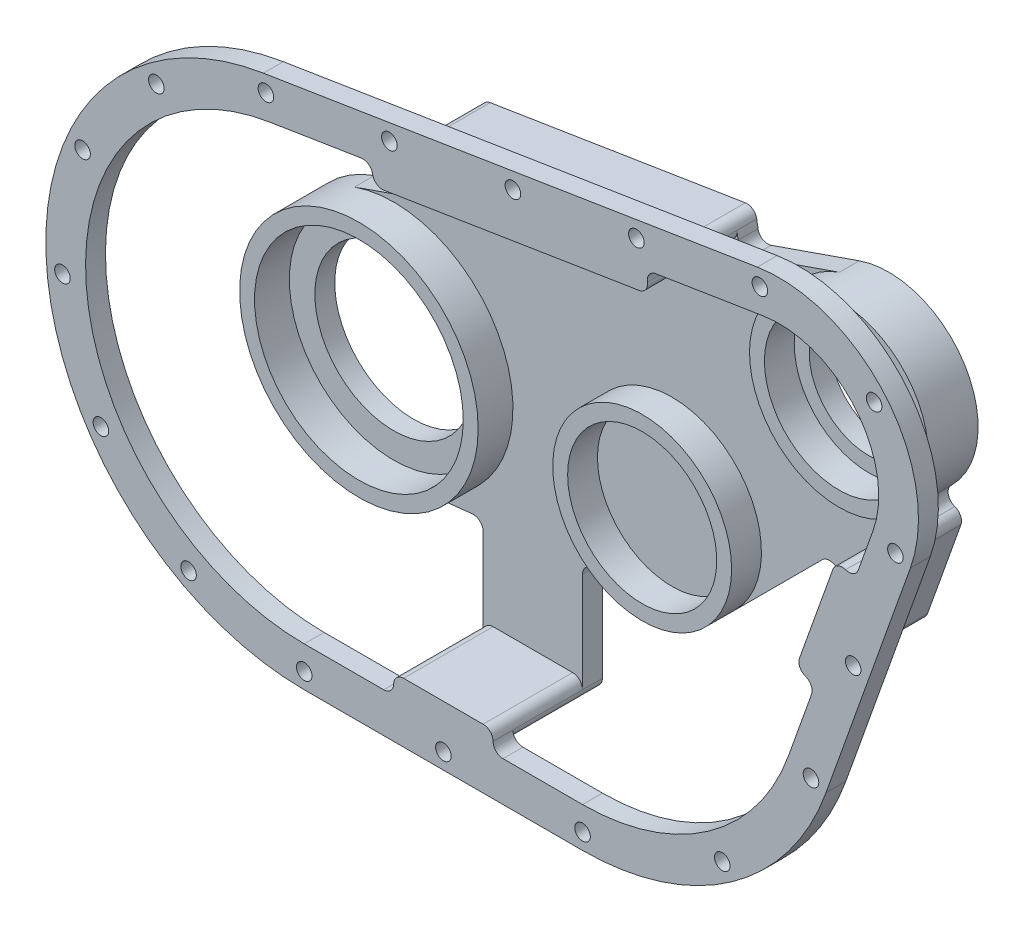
ISO-10303-21;
HEADER;
FILE_DESCRIPTION(('STEP AP214'),'2;1');
FILE_NAME('part.step','',(''),(''),'','','');
FILE_SCHEMA(('AUTOMOTIVE_DESIGN { 1 0 10303 214 1 1 1 1 }'));
ENDSEC;
DATA;
#1=APPLICATION_CONTEXT('core data for automotive mechanical design processes');
#2=APPLICATION_PROTOCOL_DEFINITION('international standard','automotive_design',2000,#1);
#3=PRODUCT_CONTEXT('',#1,'mechanical');
#4=PRODUCT('Part','Part','',(#3));
#5=PRODUCT_RELATED_PRODUCT_CATEGORY('part','',(#4));
#6=PRODUCT_DEFINITION_FORMATION('','',#4);
#7=PRODUCT_DEFINITION_CONTEXT('part definition',#1,'design');
#8=PRODUCT_DEFINITION('design','',#6,#7);
#9=PRODUCT_DEFINITION_SHAPE('','',#8);
#10=(LENGTH_UNIT() NAMED_UNIT(*) SI_UNIT(.MILLI.,.METRE.));
#11=(NAMED_UNIT(*) PLANE_ANGLE_UNIT() SI_UNIT($,.RADIAN.));
#12=(NAMED_UNIT(*) SI_UNIT($,.STERADIAN.) SOLID_ANGLE_UNIT());
#13=UNCERTAINTY_MEASURE_WITH_UNIT(LENGTH_MEASURE(1.E-05),#10,'distance_accuracy_value','');
#14=(GEOMETRIC_REPRESENTATION_CONTEXT(3) GLOBAL_UNCERTAINTY_ASSIGNED_CONTEXT((#13)) GLOBAL_UNIT_ASSIGNED_CONTEXT((#10,
#11,#12)) REPRESENTATION_CONTEXT('',''));
#15=CARTESIAN_POINT('',(0.,0.,0.));
#16=DIRECTION('',(0.,0.,1.));
#17=DIRECTION('',(1.,0.,0.));
#18=AXIS2_PLACEMENT_3D('',#15,#16,#17);
#19=CARTESIAN_POINT('',(0.,-69.85,6.35));
#20=DIRECTION('',(0.,1.,0.));
#21=DIRECTION('',(0.,0.,1.));
#22=AXIS2_PLACEMENT_3D('',#19,#20,#21);
#23=PLANE('',#22);
#24=DIRECTION('',(1.,0.,0.));
#25=VECTOR('',#24,1.);
#26=CARTESIAN_POINT('',(88.9,-69.85,28.575));
#27=LINE('',#26,#25);
#28=CARTESIAN_POINT('',(31.75,-69.85,28.575));
#29=VERTEX_POINT('',#28);
#30=CARTESIAN_POINT('',(57.15,-69.85,28.575));
#31=VERTEX_POINT('',#30);
#32=EDGE_CURVE('E441',#29,#31,#27,.T.);
#33=ORIENTED_EDGE('',*,*,#32,.F.);
#34=DIRECTION('',(0.,0.,-1.));
#35=VECTOR('',#34,1.);
#36=CARTESIAN_POINT('',(31.75,-69.85,0.));
#37=LINE('',#36,#35);
#38=CARTESIAN_POINT('',(31.75,-69.85,0.));
#39=VERTEX_POINT('',#38);
#40=EDGE_CURVE('E747',#29,#39,#37,.T.);
#41=ORIENTED_EDGE('',*,*,#40,.T.);
#42=DIRECTION('',(1.,0.,0.));
#43=VECTOR('',#42,1.);
#44=CARTESIAN_POINT('',(0.,-69.85,0.));
#45=LINE('',#44,#43);
#46=CARTESIAN_POINT('',(57.15,-69.85,0.));
#47=VERTEX_POINT('',#46);
#48=EDGE_CURVE('E1168',#39,#47,#45,.T.);
#49=ORIENTED_EDGE('',*,*,#48,.T.);
#50=DIRECTION('',(0.,0.,-1.));
#51=VECTOR('',#50,1.);
#52=CARTESIAN_POINT('',(57.15,-69.85,6.35));
#53=LINE('',#52,#51);
#54=EDGE_CURVE('E727',#47,#31,#53,.F.);
#55=ORIENTED_EDGE('',*,*,#54,.T.);
#56=EDGE_LOOP('',(#33,#41,#49,#55));
#57=FACE_BOUND('',#56,.T.);
#58=ADVANCED_FACE('F39',(#57),#23,.F.);
#59=CARTESIAN_POINT('',(144.666925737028,-51.5792100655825,6.35));
#60=DIRECTION('',(-0.941922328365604,0.335830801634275,0.));
#61=DIRECTION('',(-0.335830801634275,-0.941922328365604,0.));
#62=AXIS2_PLACEMENT_3D('',#59,#60,#61);
#63=PLANE('',#62);
#64=DIRECTION('',(0.335830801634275,0.941922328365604,0.));
#65=VECTOR('',#64,1.);
#66=CARTESIAN_POINT('',(144.666925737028,-51.5792100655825,0.));
#67=LINE('',#66,#65);
#68=CARTESIAN_POINT('',(164.181116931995,3.15326925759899,0.));
#69=VERTEX_POINT('',#68);
#70=CARTESIAN_POINT('',(174.843744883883,33.0593031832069,0.));
#71=VERTEX_POINT('',#70);
#72=EDGE_CURVE('E1184',#69,#71,#67,.T.);
#73=ORIENTED_EDGE('',*,*,#72,.T.);
#74=DIRECTION('',(0.,0.,-1.));
#75=VECTOR('',#74,1.);
#76=CARTESIAN_POINT('',(174.843744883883,33.0593031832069,6.35));
#77=LINE('',#76,#75);
#78=CARTESIAN_POINT('',(174.843744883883,33.0593031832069,28.575));
#79=VERTEX_POINT('',#78);
#80=EDGE_CURVE('E792',#71,#79,#77,.F.);
#81=ORIENTED_EDGE('',*,*,#80,.T.);
#82=DIRECTION('',(0.335830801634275,0.941922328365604,0.));
#83=VECTOR('',#82,1.);
#84=CARTESIAN_POINT('',(181.667826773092,52.1991648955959,28.575));
#85=LINE('',#84,#83);
#86=CARTESIAN_POINT('',(164.181116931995,3.15326925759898,28.575));
#87=VERTEX_POINT('',#86);
#88=EDGE_CURVE('E466',#87,#79,#85,.T.);
#89=ORIENTED_EDGE('',*,*,#88,.F.);
#90=DIRECTION('',(0.,0.,-1.));
#91=VECTOR('',#90,1.);
#92=CARTESIAN_POINT('',(164.181116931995,3.15326925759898,0.));
#93=LINE('',#92,#91);
#94=EDGE_CURVE('E789',#87,#69,#93,.T.);
#95=ORIENTED_EDGE('',*,*,#94,.T.);
#96=EDGE_LOOP('',(#73,#81,#89,#95));
#97=FACE_BOUND('',#96,.T.);
#98=ADVANCED_FACE('F1002',(#97),#63,.F.);
#99=CARTESIAN_POINT('',(-11.0336365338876,68.9730481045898,6.35));
#100=DIRECTION('',(-0.15796186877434,0.987445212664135,0.));
#101=DIRECTION('',(-0.987445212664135,-0.15796186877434,0.));
#102=AXIS2_PLACEMENT_3D('',#99,#100,#101);
#103=PLANE('',#102);
#104=DIRECTION('',(0.987445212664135,0.15796186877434,0.));
#105=VECTOR('',#104,1.);
#106=CARTESIAN_POINT('',(-11.0336365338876,68.9730481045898,0.));
#107=LINE('',#106,#105);
#108=CARTESIAN_POINT('',(24.4761000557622,74.6535499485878,0.));
#109=VERTEX_POINT('',#108);
#110=CARTESIAN_POINT('',(105.989702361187,87.6933022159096,0.));
#111=VERTEX_POINT('',#110);
#112=EDGE_CURVE('E1201',#109,#111,#107,.T.);
#113=ORIENTED_EDGE('',*,*,#112,.F.);
#114=DIRECTION('',(0.,0.,-1.));
#115=VECTOR('',#114,1.);
#116=CARTESIAN_POINT('',(24.4761000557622,74.6535499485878,28.575));
#117=LINE('',#116,#115);
#118=CARTESIAN_POINT('',(24.4761000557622,74.6535499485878,28.575));
#119=VERTEX_POINT('',#118);
#120=EDGE_CURVE('E778',#109,#119,#117,.F.);
#121=ORIENTED_EDGE('',*,*,#120,.T.);
#122=DIRECTION('',(-0.987445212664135,-0.15796186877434,0.));
#123=VECTOR('',#122,1.);
#124=CARTESIAN_POINT('',(-11.0336365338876,68.9730481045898,28.575));
#125=LINE('',#124,#123);
#126=CARTESIAN_POINT('',(105.989702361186,87.6933022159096,28.575));
#127=VERTEX_POINT('',#126);
#128=EDGE_CURVE('E470',#127,#119,#125,.T.);
#129=ORIENTED_EDGE('',*,*,#128,.F.);
#130=DIRECTION('',(0.,0.,-1.));
#131=VECTOR('',#130,1.);
#132=CARTESIAN_POINT('',(105.989702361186,87.6933022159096,6.35));
#133=LINE('',#132,#131);
#134=EDGE_CURVE('E775',#127,#111,#133,.T.);
#135=ORIENTED_EDGE('',*,*,#134,.T.);
#136=EDGE_LOOP('',(#113,#121,#129,#135));
#137=FACE_BOUND('',#136,.T.);
#138=ADVANCED_FACE('F1008',(#137),#103,.T.);
#139=CARTESIAN_POINT('',(0.,0.,6.35));
#140=DIRECTION('',(0.,0.,1.));
#141=DIRECTION('',(1.,0.,0.));
#142=AXIS2_PLACEMENT_3D('',#139,#140,#141);
#143=PLANE('',#142);
#144=DIRECTION('',(0.,1.,0.));
#145=VECTOR('',#144,1.);
#146=CARTESIAN_POINT('',(28.575,0.,6.35));
#147=LINE('',#146,#145);
#148=CARTESIAN_POINT('',(28.575,-66.675,6.35));
#149=VERTEX_POINT('',#148);
#150=CARTESIAN_POINT('',(28.575,-38.7767847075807,6.35));
#151=VERTEX_POINT('',#150);
#152=EDGE_CURVE('E1132',#149,#151,#147,.T.);
#153=ORIENTED_EDGE('',*,*,#152,.F.);
#154=CARTESIAN_POINT('',(31.75,-66.675,6.35));
#155=DIRECTION('',(0.,0.,1.));
#156=DIRECTION('',(1.,0.,0.));
#157=AXIS2_PLACEMENT_3D('',#154,#155,#156);
#158=CIRCLE('',#157,3.175);
#159=CARTESIAN_POINT('',(31.75,-63.5,6.35));
#160=VERTEX_POINT('',#159);
#161=EDGE_CURVE('E721',#149,#160,#158,.F.);
#162=ORIENTED_EDGE('',*,*,#161,.T.);
#163=DIRECTION('',(-1.,0.,0.));
#164=VECTOR('',#163,1.);
#165=CARTESIAN_POINT('',(28.575,-63.5,6.35));
#166=LINE('',#165,#164);
#167=CARTESIAN_POINT('',(57.15,-63.5,6.35));
#168=VERTEX_POINT('',#167);
#169=EDGE_CURVE('E536',#168,#160,#166,.T.);
#170=ORIENTED_EDGE('',*,*,#169,.F.);
#171=CARTESIAN_POINT('',(57.15,-66.675,6.35));
#172=DIRECTION('',(0.,0.,1.));
#173=DIRECTION('',(1.,0.,0.));
#174=AXIS2_PLACEMENT_3D('',#171,#172,#173);
#175=CIRCLE('',#174,3.175);
#176=CARTESIAN_POINT('',(60.325,-66.675,6.35));
#177=VERTEX_POINT('',#176);
#178=EDGE_CURVE('E718',#168,#177,#175,.F.);
#179=ORIENTED_EDGE('',*,*,#178,.T.);
#180=DIRECTION('',(0.,1.,0.));
#181=VECTOR('',#180,1.);
#182=CARTESIAN_POINT('',(60.325,0.,6.35));
#183=LINE('',#182,#181);
#184=CARTESIAN_POINT('',(60.325,-34.6710075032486,6.35));
#185=VERTEX_POINT('',#184);
#186=EDGE_CURVE('E1138',#177,#185,#183,.T.);
#187=ORIENTED_EDGE('',*,*,#186,.T.);
#188=CARTESIAN_POINT('',(63.5,-34.6710075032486,6.35));
#189=DIRECTION('',(0.,0.,1.));
#190=DIRECTION('',(1.,0.,0.));
#191=AXIS2_PLACEMENT_3D('',#188,#189,#190);
#192=CIRCLE('',#191,3.175);
#193=CARTESIAN_POINT('',(63.1598214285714,-31.5142839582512,6.35));
#194=VERTEX_POINT('',#193);
#195=EDGE_CURVE('E827',#185,#194,#192,.F.);
#196=ORIENTED_EDGE('',*,*,#195,.T.);
#197=DIRECTION('',(0.994243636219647,0.107142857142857,0.));
#198=VECTOR('',#197,1.);
#199=CARTESIAN_POINT('',(4.08214285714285,-37.8806825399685,6.35));
#200=LINE('',#199,#198);
#201=CARTESIAN_POINT('',(91.9616071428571,-28.4105119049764,6.35));
#202=VERTEX_POINT('',#201);
#203=EDGE_CURVE('E1141',#194,#202,#200,.T.);
#204=ORIENTED_EDGE('',*,*,#203,.T.);
#205=CARTESIAN_POINT('',(88.9,0.,6.35));
#206=DIRECTION('',(0.,0.,1.));
#207=DIRECTION('',(1.,0.,0.));
#208=AXIS2_PLACEMENT_3D('',#205,#206,#207);
#209=CIRCLE('',#208,28.575);
#210=CARTESIAN_POINT('',(109.105576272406,-20.2055762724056,6.35));
#211=VERTEX_POINT('',#210);
#212=EDGE_CURVE('E622',#202,#211,#209,.F.);
#213=ORIENTED_EDGE('',*,*,#212,.T.);
#214=DIRECTION('',(-0.707106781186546,-0.707106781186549,0.));
#215=VECTOR('',#214,1.);
#216=CARTESIAN_POINT('',(64.6555762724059,-64.6555762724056,6.35));
#217=LINE('',#216,#215);
#218=CARTESIAN_POINT('',(136.895760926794,7.5846083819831,6.35));
#219=VERTEX_POINT('',#218);
#220=EDGE_CURVE('E1145',#219,#211,#217,.T.);
#221=ORIENTED_EDGE('',*,*,#220,.F.);
#222=CARTESIAN_POINT('',(139.140824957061,5.33954435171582,6.35));
#223=DIRECTION('',(0.,0.,1.));
#224=DIRECTION('',(1.,0.,0.));
#225=AXIS2_PLACEMENT_3D('',#222,#223,#224);
#226=CIRCLE('',#225,3.175);
#227=CARTESIAN_POINT('',(140.20708775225,8.33014774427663,6.35));
#228=VERTEX_POINT('',#227);
#229=EDGE_CURVE('E831',#219,#228,#226,.F.);
#230=ORIENTED_EDGE('',*,*,#229,.T.);
#231=DIRECTION('',(-0.941922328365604,0.335830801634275,0.));
#232=VECTOR('',#231,1.);
#233=CARTESIAN_POINT('',(18.4479283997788,51.7418759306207,6.35));
#234=LINE('',#233,#232);
#235=CARTESIAN_POINT('',(160.124250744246,1.228928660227,6.35));
#236=VERTEX_POINT('',#235);
#237=EDGE_CURVE('E1147',#236,#228,#234,.T.);
#238=ORIENTED_EDGE('',*,*,#237,.F.);
#239=CARTESIAN_POINT('',(161.190513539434,4.21953205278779,6.35));
#240=DIRECTION('',(0.,0.,1.));
#241=DIRECTION('',(1.,0.,0.));
#242=AXIS2_PLACEMENT_3D('',#239,#240,#241);
#243=CIRCLE('',#242,3.175);
#244=CARTESIAN_POINT('',(158.199910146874,5.28579484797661,6.35));
#245=VERTEX_POINT('',#244);
#246=EDGE_CURVE('E712',#236,#245,#243,.F.);
#247=ORIENTED_EDGE('',*,*,#246,.T.);
#248=DIRECTION('',(-0.335830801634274,-0.941922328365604,0.));
#249=VECTOR('',#248,1.);
#250=CARTESIAN_POINT('',(157.133647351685,2.29519145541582,6.35));
#251=LINE('',#250,#249);
#252=CARTESIAN_POINT('',(168.862538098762,35.1918287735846,6.35));
#253=VERTEX_POINT('',#252);
#254=EDGE_CURVE('E549',#253,#245,#251,.T.);
#255=ORIENTED_EDGE('',*,*,#254,.F.);
#256=CARTESIAN_POINT('',(171.853141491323,34.1255659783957,6.35));
#257=DIRECTION('',(0.,0.,1.));
#258=DIRECTION('',(1.,0.,0.));
#259=AXIS2_PLACEMENT_3D('',#256,#257,#258);
#260=CIRCLE('',#259,3.175);
#261=CARTESIAN_POINT('',(172.919404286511,37.1161693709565,6.35));
#262=VERTEX_POINT('',#261);
#263=EDGE_CURVE('E705',#253,#262,#260,.F.);
#264=ORIENTED_EDGE('',*,*,#263,.T.);
#265=DIRECTION('',(-0.941922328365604,0.335830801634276,0.));
#266=VECTOR('',#265,1.);
#267=CARTESIAN_POINT('',(31.2430819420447,87.6291166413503,6.35));
#268=LINE('',#267,#266);
#269=CARTESIAN_POINT('',(172.862189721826,37.1365685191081,6.35));
#270=VERTEX_POINT('',#269);
#271=EDGE_CURVE('E616',#262,#270,#268,.T.);
#272=ORIENTED_EDGE('',*,*,#271,.T.);
#273=CARTESIAN_POINT('',(173.928452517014,40.1271719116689,6.35));
#274=DIRECTION('',(0.,0.,1.));
#275=DIRECTION('',(1.,0.,0.));
#276=AXIS2_PLACEMENT_3D('',#273,#274,#275);
#277=CIRCLE('',#276,3.175);
#278=CARTESIAN_POINT('',(171.683388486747,42.3722359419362,6.35));
#279=VERTEX_POINT('',#278);
#280=EDGE_CURVE('E835',#270,#279,#277,.F.);
#281=ORIENTED_EDGE('',*,*,#280,.T.);
#282=DIRECTION('',(-0.707106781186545,-0.70710678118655,0.));
#283=VECTOR('',#282,1.);
#284=CARTESIAN_POINT('',(64.6555762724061,-64.6555762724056,6.35));
#285=LINE('',#284,#283);
#286=CARTESIAN_POINT('',(171.96736911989,42.6562165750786,6.35));
#287=VERTEX_POINT('',#286);
#288=EDGE_CURVE('E600',#287,#279,#285,.T.);
#289=ORIENTED_EDGE('',*,*,#288,.F.);
#290=CARTESIAN_POINT('',(151.761792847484,62.8617928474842,6.35));
#291=DIRECTION('',(0.,0.,1.));
#292=DIRECTION('',(1.,0.,0.));
#293=AXIS2_PLACEMENT_3D('',#290,#291,#292);
#294=CIRCLE('',#293,28.575);
#295=CARTESIAN_POINT('',(142.375816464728,89.8513106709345,6.35));
#296=VERTEX_POINT('',#295);
#297=EDGE_CURVE('E579',#296,#287,#294,.T.);
#298=ORIENTED_EDGE('',*,*,#297,.F.);
#299=DIRECTION('',(-0.944515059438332,-0.328468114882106,0.));
#300=VECTOR('',#299,1.);
#301=CARTESIAN_POINT('',(-12.5146351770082,35.9860237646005,6.35));
#302=LINE('',#301,#300);
#303=CARTESIAN_POINT('',(114.205547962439,80.0547119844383,6.35));
#304=VERTEX_POINT('',#303);
#305=EDGE_CURVE('E596',#296,#304,#302,.T.);
#306=ORIENTED_EDGE('',*,*,#305,.T.);
#307=CARTESIAN_POINT('',(113.162661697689,83.053547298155,6.35));
#308=DIRECTION('',(0.,0.,1.));
#309=DIRECTION('',(1.,0.,0.));
#310=AXIS2_PLACEMENT_3D('',#307,#308,#309);
#311=CIRCLE('',#310,3.175);
#312=CARTESIAN_POINT('',(110.02752314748,82.5520183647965,6.35));
#313=VERTEX_POINT('',#312);
#314=EDGE_CURVE('E839',#304,#313,#311,.F.);
#315=ORIENTED_EDGE('',*,*,#314,.T.);
#316=DIRECTION('',(0.15796186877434,-0.987445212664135,0.));
#317=VECTOR('',#316,1.);
#318=CARTESIAN_POINT('',(120.158477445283,19.2217830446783,6.35));
#319=LINE('',#318,#317);
#320=CARTESIAN_POINT('',(109.626369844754,85.0596925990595,6.35));
#321=VERTEX_POINT('',#320);
#322=EDGE_CURVE('E599',#321,#313,#319,.T.);
#323=ORIENTED_EDGE('',*,*,#322,.F.);
#324=CARTESIAN_POINT('',(106.491231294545,84.558163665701,6.35));
#325=DIRECTION('',(0.,0.,1.));
#326=DIRECTION('',(1.,0.,0.));
#327=AXIS2_PLACEMENT_3D('',#324,#325,#326);
#328=CIRCLE('',#327,3.175);
#329=CARTESIAN_POINT('',(106.992760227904,81.4230251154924,6.35));
#330=VERTEX_POINT('',#329);
#331=EDGE_CURVE('E699',#321,#330,#328,.F.);
#332=ORIENTED_EDGE('',*,*,#331,.T.);
#333=DIRECTION('',(0.987445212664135,0.15796186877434,0.));
#334=VECTOR('',#333,1.);
#335=CARTESIAN_POINT('',(110.127898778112,81.9245540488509,6.35));
#336=LINE('',#335,#334);
#337=CARTESIAN_POINT('',(25.4791579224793,68.3832728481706,6.35));
#338=VERTEX_POINT('',#337);
#339=EDGE_CURVE('E555',#338,#330,#336,.T.);
#340=ORIENTED_EDGE('',*,*,#339,.F.);
#341=CARTESIAN_POINT('',(24.9776289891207,71.5184113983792,6.35));
#342=DIRECTION('',(0.,0.,1.));
#343=DIRECTION('',(1.,0.,0.));
#344=AXIS2_PLACEMENT_3D('',#341,#342,#343);
#345=CIRCLE('',#344,3.175);
#346=CARTESIAN_POINT('',(21.8424904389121,71.0168824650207,6.35));
#347=VERTEX_POINT('',#346);
#348=EDGE_CURVE('E688',#338,#347,#345,.F.);
#349=ORIENTED_EDGE('',*,*,#348,.T.);
#350=DIRECTION('',(0.15796186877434,-0.987445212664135,0.));
#351=VECTOR('',#350,1.);
#352=CARTESIAN_POINT('',(32.3745980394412,5.17897291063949,6.35));
#353=LINE('',#352,#351);
#354=CARTESIAN_POINT('',(24.9202551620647,51.7772769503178,6.35));
#355=VERTEX_POINT('',#354);
#356=EDGE_CURVE('E1154',#347,#355,#353,.T.);
#357=ORIENTED_EDGE('',*,*,#356,.T.);
#358=CARTESIAN_POINT('',(21.7851166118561,51.2757480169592,6.35));
#359=DIRECTION('',(0.,0.,1.));
#360=DIRECTION('',(1.,0.,0.));
#361=AXIS2_PLACEMENT_3D('',#358,#359,#360);
#362=CIRCLE('',#361,3.175);
#363=CARTESIAN_POINT('',(22.8280028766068,48.2769127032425,6.35));
#364=VERTEX_POINT('',#363);
#365=EDGE_CURVE('E11',#355,#364,#362,.F.);
#366=ORIENTED_EDGE('',*,*,#365,.T.);
#367=DIRECTION('',(-0.944515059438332,-0.328468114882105,0.));
#368=VECTOR('',#367,1.);
#369=CARTESIAN_POINT('',(-12.5146351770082,35.9860237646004,6.35));
#370=LINE('',#369,#368);
#371=CARTESIAN_POINT('',(-12.5146351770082,35.9860237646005,6.35));
#372=VERTEX_POINT('',#371);
#373=EDGE_CURVE('E589',#364,#372,#370,.T.);
#374=ORIENTED_EDGE('',*,*,#373,.T.);
#375=CARTESIAN_POINT('',(0.,0.,6.35));
#376=DIRECTION('',(0.,0.,1.));
#377=DIRECTION('',(1.,0.,0.));
#378=AXIS2_PLACEMENT_3D('',#375,#376,#377);
#379=CIRCLE('',#378,38.1);
#380=CARTESIAN_POINT('',(4.08214285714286,-37.8806825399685,6.35));
#381=VERTEX_POINT('',#380);
#382=EDGE_CURVE('E628',#372,#381,#379,.F.);
#383=ORIENTED_EDGE('',*,*,#382,.T.);
#384=DIRECTION('',(0.994243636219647,0.107142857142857,0.));
#385=VECTOR('',#384,1.);
#386=CARTESIAN_POINT('',(4.08214285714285,-37.8806825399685,6.35));
#387=LINE('',#386,#385);
#388=CARTESIAN_POINT('',(25.0598214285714,-35.6200611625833,6.35));
#389=VERTEX_POINT('',#388);
#390=EDGE_CURVE('E1134',#381,#389,#387,.T.);
#391=ORIENTED_EDGE('',*,*,#390,.T.);
#392=CARTESIAN_POINT('',(25.4,-38.7767847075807,6.35));
#393=DIRECTION('',(0.,0.,1.));
#394=DIRECTION('',(1.,0.,0.));
#395=AXIS2_PLACEMENT_3D('',#392,#393,#394);
#396=CIRCLE('',#395,3.175);
#397=EDGE_CURVE('E843',#389,#151,#396,.F.);
#398=ORIENTED_EDGE('',*,*,#397,.T.);
#399=EDGE_LOOP('',(#153,#162,#170,#179,#187,#196,#204,#213,#221,#230,#238,#247,#255,#264,#272,
#281,#289,#298,#306,#315,#323,#332,#340,#349,#357,#366,#374,#383,#391,#398));
#400=FACE_BOUND('',#399,.T.);
#401=ADVANCED_FACE('F1131',(#400),#143,.T.);
#402=CARTESIAN_POINT('',(0.,0.,6.35));
#403=DIRECTION('',(0.,0.,1.));
#404=DIRECTION('',(1.,0.,0.));
#405=AXIS2_PLACEMENT_3D('',#402,#403,#404);
#406=CIRCLE('',#405,25.1841);
#407=CARTESIAN_POINT('',(25.1841,0.,6.35));
#408=VERTEX_POINT('',#407);
#409=EDGE_CURVE('E1156',#408,#408,#406,.T.);
#410=ORIENTED_EDGE('',*,*,#409,.F.);
#411=EDGE_LOOP('',(#410));
#412=FACE_BOUND('',#411,.T.);
#413=CARTESIAN_POINT('',(0.,0.,6.35));
#414=DIRECTION('',(0.,0.,1.));
#415=DIRECTION('',(1.,0.,0.));
#416=AXIS2_PLACEMENT_3D('',#413,#414,#415);
#417=CIRCLE('',#416,33.3375);
#418=CARTESIAN_POINT('',(33.3375,0.,6.35));
#419=VERTEX_POINT('',#418);
#420=EDGE_CURVE('E625',#419,#419,#417,.F.);
#421=ORIENTED_EDGE('',*,*,#420,.F.);
#422=EDGE_LOOP('',(#421));
#423=FACE_BOUND('',#422,.T.);
#424=ADVANCED_FACE('F1416',(#412,#423),#143,.T.);
#425=CARTESIAN_POINT('',(151.761792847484,62.8617928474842,6.35));
#426=DIRECTION('',(0.,0.,1.));
#427=DIRECTION('',(1.,0.,0.));
#428=AXIS2_PLACEMENT_3D('',#425,#426,#427);
#429=CIRCLE('',#428,19.05);
#430=CARTESIAN_POINT('',(170.811792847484,62.8617928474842,6.35));
#431=VERTEX_POINT('',#430);
#432=EDGE_CURVE('E607',#431,#431,#429,.T.);
#433=ORIENTED_EDGE('',*,*,#432,.F.);
#434=EDGE_LOOP('',(#433));
#435=FACE_BOUND('',#434,.T.);
#436=CARTESIAN_POINT('',(151.761792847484,62.8617928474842,6.35));
#437=DIRECTION('',(0.,0.,1.));
#438=DIRECTION('',(1.,0.,0.));
#439=AXIS2_PLACEMENT_3D('',#436,#437,#438);
#440=CIRCLE('',#439,23.8125);
#441=CARTESIAN_POINT('',(127.949292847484,62.8617928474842,6.35));
#442=VERTEX_POINT('',#441);
#443=EDGE_CURVE('E575',#442,#442,#440,.T.);
#444=ORIENTED_EDGE('',*,*,#443,.T.);
#445=EDGE_LOOP('',(#444));
#446=FACE_BOUND('',#445,.T.);
#447=ADVANCED_FACE('F1030',(#435,#446),#143,.T.);
#448=CARTESIAN_POINT('',(-12.5146351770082,35.9860237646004,6.35));
#449=DIRECTION('',(0.328468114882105,-0.944515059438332,0.));
#450=DIRECTION('',(0.944515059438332,0.328468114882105,0.));
#451=AXIS2_PLACEMENT_3D('',#448,#449,#450);
#452=PLANE('',#451);
#453=ORIENTED_EDGE('',*,*,#373,.F.);
#454=DIRECTION('',(0.,0.,-1.));
#455=VECTOR('',#454,1.);
#456=CARTESIAN_POINT('',(22.8280028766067,48.2769127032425,0.));
#457=LINE('',#456,#455);
#458=CARTESIAN_POINT('',(22.8280028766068,48.2769127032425,0.));
#459=VERTEX_POINT('',#458);
#460=EDGE_CURVE('E810',#364,#459,#457,.T.);
#461=ORIENTED_EDGE('',*,*,#460,.T.);
#462=DIRECTION('',(-0.944515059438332,-0.328468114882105,0.));
#463=VECTOR('',#462,1.);
#464=CARTESIAN_POINT('',(-12.5146351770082,35.9860237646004,0.));
#465=LINE('',#464,#463);
#466=CARTESIAN_POINT('',(-12.5146351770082,35.9860237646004,0.));
#467=VERTEX_POINT('',#466);
#468=EDGE_CURVE('E585',#459,#467,#465,.T.);
#469=ORIENTED_EDGE('',*,*,#468,.T.);
#470=DIRECTION('',(0.,0.,-1.));
#471=VECTOR('',#470,1.);
#472=CARTESIAN_POINT('',(-12.5146351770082,35.9860237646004,6.35));
#473=LINE('',#472,#471);
#474=EDGE_CURVE('E594',#372,#467,#473,.T.);
#475=ORIENTED_EDGE('',*,*,#474,.F.);
#476=EDGE_LOOP('',(#453,#461,#469,#475));
#477=FACE_BOUND('',#476,.T.);
#478=ADVANCED_FACE('F1026',(#477),#452,.F.);
#479=CARTESIAN_POINT('',(0.,0.,6.35));
#480=DIRECTION('',(0.,0.,-1.));
#481=DIRECTION('',(-1.,0.,0.));
#482=AXIS2_PLACEMENT_3D('',#479,#480,#481);
#483=CYLINDRICAL_SURFACE('',#482,38.1);
#484=CARTESIAN_POINT('',(0.,0.,0.));
#485=DIRECTION('',(0.,0.,1.));
#486=DIRECTION('',(1.,0.,0.));
#487=AXIS2_PLACEMENT_3D('',#484,#485,#486);
#488=CIRCLE('',#487,38.1);
#489=CARTESIAN_POINT('',(4.08214285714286,-37.8806825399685,0.));
#490=VERTEX_POINT('',#489);
#491=EDGE_CURVE('E1162',#467,#490,#488,.T.);
#492=ORIENTED_EDGE('',*,*,#491,.T.);
#493=DIRECTION('',(0.,0.,-1.));
#494=VECTOR('',#493,1.);
#495=CARTESIAN_POINT('',(4.08214285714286,-37.8806825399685,6.35));
#496=LINE('',#495,#494);
#497=EDGE_CURVE('E1217',#381,#490,#496,.T.);
#498=ORIENTED_EDGE('',*,*,#497,.F.);
#499=ORIENTED_EDGE('',*,*,#382,.F.);
#500=ORIENTED_EDGE('',*,*,#474,.T.);
#501=EDGE_LOOP('',(#492,#498,#499,#500));
#502=FACE_BOUND('',#501,.T.);
#503=CARTESIAN_POINT('',(0.,0.,17.4625));
#504=DIRECTION('',(0.,0.,1.));
#505=DIRECTION('',(1.,0.,0.));
#506=AXIS2_PLACEMENT_3D('',#503,#504,#505);
#507=CIRCLE('',#506,38.1);
#508=CARTESIAN_POINT('',(38.1,0.,17.4625));
#509=VERTEX_POINT('',#508);
#510=EDGE_CURVE('E566',#509,#509,#507,.T.);
#511=ORIENTED_EDGE('',*,*,#510,.F.);
#512=EDGE_LOOP('',(#511));
#513=FACE_BOUND('',#512,.T.);
#514=ADVANCED_FACE('F1023',(#502,#513),#483,.T.);
#515=CARTESIAN_POINT('',(4.08214285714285,-37.8806825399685,6.35));
#516=DIRECTION('',(-0.107142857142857,0.994243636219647,0.));
#517=DIRECTION('',(-0.994243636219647,-0.107142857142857,0.));
#518=AXIS2_PLACEMENT_3D('',#515,#516,#517);
#519=PLANE('',#518);
#520=DIRECTION('',(0.994243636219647,0.107142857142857,0.));
#521=VECTOR('',#520,1.);
#522=CARTESIAN_POINT('',(4.08214285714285,-37.8806825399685,0.));
#523=LINE('',#522,#521);
#524=CARTESIAN_POINT('',(25.0598214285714,-35.6200611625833,0.));
#525=VERTEX_POINT('',#524);
#526=EDGE_CURVE('E1164',#490,#525,#523,.T.);
#527=ORIENTED_EDGE('',*,*,#526,.T.);
#528=DIRECTION('',(0.,0.,-1.));
#529=VECTOR('',#528,1.);
#530=CARTESIAN_POINT('',(25.0598214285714,-35.6200611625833,6.35));
#531=LINE('',#530,#529);
#532=EDGE_CURVE('E62',#525,#389,#531,.F.);
#533=ORIENTED_EDGE('',*,*,#532,.T.);
#534=ORIENTED_EDGE('',*,*,#390,.F.);
#535=ORIENTED_EDGE('',*,*,#497,.T.);
#536=EDGE_LOOP('',(#527,#533,#534,#535));
#537=FACE_BOUND('',#536,.T.);
#538=ADVANCED_FACE('F1019',(#537),#519,.F.);
#539=CARTESIAN_POINT('',(28.575,0.,6.35));
#540=DIRECTION('',(-1.,0.,0.));
#541=DIRECTION('',(0.,0.,1.));
#542=AXIS2_PLACEMENT_3D('',#539,#540,#541);
#543=PLANE('',#542);
#544=DIRECTION('',(0.,1.,0.));
#545=VECTOR('',#544,1.);
#546=CARTESIAN_POINT('',(28.575,0.,0.));
#547=LINE('',#546,#545);
#548=CARTESIAN_POINT('',(28.575,-66.675,0.));
#549=VERTEX_POINT('',#548);
#550=CARTESIAN_POINT('',(28.575,-38.7767847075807,0.));
#551=VERTEX_POINT('',#550);
#552=EDGE_CURVE('E1166',#549,#551,#547,.T.);
#553=ORIENTED_EDGE('',*,*,#552,.F.);
#554=DIRECTION('',(0.,0.,-1.));
#555=VECTOR('',#554,1.);
#556=CARTESIAN_POINT('',(28.575,-66.675,28.575));
#557=LINE('',#556,#555);
#558=EDGE_CURVE('E765',#549,#149,#557,.F.);
#559=ORIENTED_EDGE('',*,*,#558,.T.);
#560=ORIENTED_EDGE('',*,*,#152,.T.);
#561=DIRECTION('',(0.,0.,-1.));
#562=VECTOR('',#561,1.);
#563=CARTESIAN_POINT('',(28.575,-38.7767847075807,6.35));
#564=LINE('',#563,#562);
#565=EDGE_CURVE('E762',#151,#551,#564,.T.);
#566=ORIENTED_EDGE('',*,*,#565,.T.);
#567=EDGE_LOOP('',(#553,#559,#560,#566));
#568=FACE_BOUND('',#567,.T.);
#569=ADVANCED_FACE('F1016',(#568),#543,.T.);
#570=CARTESIAN_POINT('',(60.325,0.,6.35));
#571=DIRECTION('',(-1.,0.,0.));
#572=DIRECTION('',(0.,0.,1.));
#573=AXIS2_PLACEMENT_3D('',#570,#571,#572);
#574=PLANE('',#573);
#575=ORIENTED_EDGE('',*,*,#186,.F.);
#576=DIRECTION('',(0.,0.,-1.));
#577=VECTOR('',#576,1.);
#578=CARTESIAN_POINT('',(60.325,-66.675,6.35));
#579=LINE('',#578,#577);
#580=CARTESIAN_POINT('',(60.325,-66.675,0.));
#581=VERTEX_POINT('',#580);
#582=EDGE_CURVE('E769',#177,#581,#579,.T.);
#583=ORIENTED_EDGE('',*,*,#582,.T.);
#584=DIRECTION('',(0.,1.,0.));
#585=VECTOR('',#584,1.);
#586=CARTESIAN_POINT('',(60.325,0.,0.));
#587=LINE('',#586,#585);
#588=CARTESIAN_POINT('',(60.325,-34.6710075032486,0.));
#589=VERTEX_POINT('',#588);
#590=EDGE_CURVE('E1171',#581,#589,#587,.T.);
#591=ORIENTED_EDGE('',*,*,#590,.T.);
#592=DIRECTION('',(0.,0.,-1.));
#593=VECTOR('',#592,1.);
#594=CARTESIAN_POINT('',(60.325,-34.6710075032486,6.35));
#595=LINE('',#594,#593);
#596=EDGE_CURVE('E767',#589,#185,#595,.F.);
#597=ORIENTED_EDGE('',*,*,#596,.T.);
#598=EDGE_LOOP('',(#575,#583,#591,#597));
#599=FACE_BOUND('',#598,.T.);
#600=ADVANCED_FACE('F1014',(#599),#574,.F.);
#601=CARTESIAN_POINT('',(4.08214285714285,-37.8806825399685,6.35));
#602=DIRECTION('',(-0.107142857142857,0.994243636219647,0.));
#603=DIRECTION('',(-0.994243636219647,-0.107142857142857,0.));
#604=AXIS2_PLACEMENT_3D('',#601,#602,#603);
#605=PLANE('',#604);
#606=ORIENTED_EDGE('',*,*,#203,.F.);
#607=DIRECTION('',(0.,0.,-1.));
#608=VECTOR('',#607,1.);
#609=CARTESIAN_POINT('',(63.1598214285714,-31.5142839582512,0.));
#610=LINE('',#609,#608);
#611=CARTESIAN_POINT('',(63.1598214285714,-31.5142839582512,0.));
#612=VERTEX_POINT('',#611);
#613=EDGE_CURVE('E799',#194,#612,#610,.T.);
#614=ORIENTED_EDGE('',*,*,#613,.T.);
#615=DIRECTION('',(0.994243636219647,0.107142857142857,0.));
#616=VECTOR('',#615,1.);
#617=CARTESIAN_POINT('',(4.08214285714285,-37.8806825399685,0.));
#618=LINE('',#617,#616);
#619=CARTESIAN_POINT('',(91.9616071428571,-28.4105119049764,0.));
#620=VERTEX_POINT('',#619);
#621=EDGE_CURVE('E1174',#612,#620,#618,.T.);
#622=ORIENTED_EDGE('',*,*,#621,.T.);
#623=DIRECTION('',(0.,0.,-1.));
#624=VECTOR('',#623,1.);
#625=CARTESIAN_POINT('',(91.9616071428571,-28.4105119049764,6.35));
#626=LINE('',#625,#624);
#627=EDGE_CURVE('E1215',#202,#620,#626,.T.);
#628=ORIENTED_EDGE('',*,*,#627,.F.);
#629=EDGE_LOOP('',(#606,#614,#622,#628));
#630=FACE_BOUND('',#629,.T.);
#631=ADVANCED_FACE('F1255',(#630),#605,.F.);
#632=CARTESIAN_POINT('',(88.9,0.,6.35));
#633=DIRECTION('',(0.,0.,-1.));
#634=DIRECTION('',(-1.,0.,0.));
#635=AXIS2_PLACEMENT_3D('',#632,#633,#634);
#636=CYLINDRICAL_SURFACE('',#635,28.575);
#637=CARTESIAN_POINT('',(88.9,0.,0.));
#638=DIRECTION('',(0.,0.,1.));
#639=DIRECTION('',(1.,0.,0.));
#640=AXIS2_PLACEMENT_3D('',#637,#638,#639);
#641=CIRCLE('',#640,28.575);
#642=CARTESIAN_POINT('',(109.105576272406,-20.2055762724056,0.));
#643=VERTEX_POINT('',#642);
#644=EDGE_CURVE('E1176',#620,#643,#641,.T.);
#645=ORIENTED_EDGE('',*,*,#644,.T.);
#646=DIRECTION('',(0.,0.,-1.));
#647=VECTOR('',#646,1.);
#648=CARTESIAN_POINT('',(109.105576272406,-20.2055762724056,6.35));
#649=LINE('',#648,#647);
#650=EDGE_CURVE('E611',#211,#643,#649,.T.);
#651=ORIENTED_EDGE('',*,*,#650,.F.);
#652=ORIENTED_EDGE('',*,*,#212,.F.);
#653=ORIENTED_EDGE('',*,*,#627,.T.);
#654=EDGE_LOOP('',(#645,#651,#652,#653));
#655=FACE_BOUND('',#654,.T.);
#656=CARTESIAN_POINT('',(88.9,0.,15.875));
#657=DIRECTION('',(0.,0.,1.));
#658=DIRECTION('',(1.,0.,0.));
#659=AXIS2_PLACEMENT_3D('',#656,#657,#658);
#660=CIRCLE('',#659,28.575);
#661=CARTESIAN_POINT('',(117.475,0.,15.875));
#662=VERTEX_POINT('',#661);
#663=EDGE_CURVE('E572',#662,#662,#660,.T.);
#664=ORIENTED_EDGE('',*,*,#663,.F.);
#665=EDGE_LOOP('',(#664));
#666=FACE_BOUND('',#665,.T.);
#667=ADVANCED_FACE('F1262',(#655,#666),#636,.T.);
#668=CARTESIAN_POINT('',(64.6555762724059,-64.6555762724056,6.35));
#669=DIRECTION('',(0.707106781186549,-0.707106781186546,0.));
#670=DIRECTION('',(0.707106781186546,0.707106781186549,0.));
#671=AXIS2_PLACEMENT_3D('',#668,#669,#670);
#672=PLANE('',#671);
#673=DIRECTION('',(-0.707106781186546,-0.707106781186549,0.));
#674=VECTOR('',#673,1.);
#675=CARTESIAN_POINT('',(64.6555762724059,-64.6555762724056,0.));
#676=LINE('',#675,#674);
#677=CARTESIAN_POINT('',(136.895760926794,7.5846083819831,0.));
#678=VERTEX_POINT('',#677);
#679=EDGE_CURVE('E1179',#678,#643,#676,.T.);
#680=ORIENTED_EDGE('',*,*,#679,.F.);
#681=DIRECTION('',(0.,0.,-1.));
#682=VECTOR('',#681,1.);
#683=CARTESIAN_POINT('',(136.895760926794,7.5846083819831,6.35));
#684=LINE('',#683,#682);
#685=EDGE_CURVE('E802',#678,#219,#684,.F.);
#686=ORIENTED_EDGE('',*,*,#685,.T.);
#687=ORIENTED_EDGE('',*,*,#220,.T.);
#688=ORIENTED_EDGE('',*,*,#650,.T.);
#689=EDGE_LOOP('',(#680,#686,#687,#688));
#690=FACE_BOUND('',#689,.T.);
#691=ADVANCED_FACE('F1370',(#690),#672,.T.);
#692=CARTESIAN_POINT('',(18.4479283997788,51.7418759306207,6.35));
#693=DIRECTION('',(-0.335830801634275,-0.941922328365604,0.));
#694=DIRECTION('',(0.941922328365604,-0.335830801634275,0.));
#695=AXIS2_PLACEMENT_3D('',#692,#693,#694);
#696=PLANE('',#695);
#697=DIRECTION('',(-0.941922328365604,0.335830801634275,0.));
#698=VECTOR('',#697,1.);
#699=CARTESIAN_POINT('',(18.4479283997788,51.7418759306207,0.));
#700=LINE('',#699,#698);
#701=CARTESIAN_POINT('',(160.124250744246,1.228928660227,0.));
#702=VERTEX_POINT('',#701);
#703=CARTESIAN_POINT('',(140.20708775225,8.33014774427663,0.));
#704=VERTEX_POINT('',#703);
#705=EDGE_CURVE('E1181',#702,#704,#700,.T.);
#706=ORIENTED_EDGE('',*,*,#705,.F.);
#707=DIRECTION('',(0.,0.,-1.));
#708=VECTOR('',#707,1.);
#709=CARTESIAN_POINT('',(160.124250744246,1.22892866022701,28.575));
#710=LINE('',#709,#708);
#711=EDGE_CURVE('E797',#702,#236,#710,.F.);
#712=ORIENTED_EDGE('',*,*,#711,.T.);
#713=ORIENTED_EDGE('',*,*,#237,.T.);
#714=DIRECTION('',(0.,0.,-1.));
#715=VECTOR('',#714,1.);
#716=CARTESIAN_POINT('',(140.20708775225,8.33014774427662,0.));
#717=LINE('',#716,#715);
#718=EDGE_CURVE('E794',#228,#704,#717,.T.);
#719=ORIENTED_EDGE('',*,*,#718,.T.);
#720=EDGE_LOOP('',(#706,#712,#713,#719));
#721=FACE_BOUND('',#720,.T.);
#722=ADVANCED_FACE('F1273',(#721),#696,.T.);
#723=CARTESIAN_POINT('',(31.2430819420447,87.6291166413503,6.35));
#724=DIRECTION('',(-0.335830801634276,-0.941922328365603,0.));
#725=DIRECTION('',(0.941922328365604,-0.335830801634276,0.));
#726=AXIS2_PLACEMENT_3D('',#723,#724,#725);
#727=PLANE('',#726);
#728=ORIENTED_EDGE('',*,*,#271,.F.);
#729=DIRECTION('',(0.,0.,-1.));
#730=VECTOR('',#729,1.);
#731=CARTESIAN_POINT('',(172.919404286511,37.1161693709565,6.35));
#732=LINE('',#731,#730);
#733=CARTESIAN_POINT('',(172.919404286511,37.1161693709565,0.));
#734=VERTEX_POINT('',#733);
#735=EDGE_CURVE('E787',#262,#734,#732,.T.);
#736=ORIENTED_EDGE('',*,*,#735,.T.);
#737=DIRECTION('',(-0.941922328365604,0.335830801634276,0.));
#738=VECTOR('',#737,1.);
#739=CARTESIAN_POINT('',(31.2430819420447,87.6291166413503,0.));
#740=LINE('',#739,#738);
#741=CARTESIAN_POINT('',(172.862189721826,37.1365685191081,0.));
#742=VERTEX_POINT('',#741);
#743=EDGE_CURVE('E1187',#734,#742,#740,.T.);
#744=ORIENTED_EDGE('',*,*,#743,.T.);
#745=DIRECTION('',(0.,0.,-1.));
#746=VECTOR('',#745,1.);
#747=CARTESIAN_POINT('',(172.862189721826,37.1365685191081,6.35));
#748=LINE('',#747,#746);
#749=EDGE_CURVE('E785',#742,#270,#748,.F.);
#750=ORIENTED_EDGE('',*,*,#749,.T.);
#751=EDGE_LOOP('',(#728,#736,#744,#750));
#752=FACE_BOUND('',#751,.T.);
#753=ADVANCED_FACE('F1376',(#752),#727,.F.);
#754=CARTESIAN_POINT('',(64.6555762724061,-64.6555762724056,6.35));
#755=DIRECTION('',(0.70710678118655,-0.707106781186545,0.));
#756=DIRECTION('',(0.707106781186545,0.70710678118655,0.));
#757=AXIS2_PLACEMENT_3D('',#754,#755,#756);
#758=PLANE('',#757);
#759=ORIENTED_EDGE('',*,*,#288,.T.);
#760=DIRECTION('',(0.,0.,-1.));
#761=VECTOR('',#760,1.);
#762=CARTESIAN_POINT('',(171.683388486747,42.3722359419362,6.35));
#763=LINE('',#762,#761);
#764=CARTESIAN_POINT('',(171.683388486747,42.3722359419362,0.));
#765=VERTEX_POINT('',#764);
#766=EDGE_CURVE('E804',#279,#765,#763,.T.);
#767=ORIENTED_EDGE('',*,*,#766,.T.);
#768=DIRECTION('',(-0.707106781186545,-0.70710678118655,0.));
#769=VECTOR('',#768,1.);
#770=CARTESIAN_POINT('',(64.6555762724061,-64.6555762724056,0.));
#771=LINE('',#770,#769);
#772=CARTESIAN_POINT('',(171.96736911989,42.6562165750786,0.));
#773=VERTEX_POINT('',#772);
#774=EDGE_CURVE('E1190',#773,#765,#771,.T.);
#775=ORIENTED_EDGE('',*,*,#774,.F.);
#776=DIRECTION('',(0.,0.,-1.));
#777=VECTOR('',#776,1.);
#778=CARTESIAN_POINT('',(171.96736911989,42.6562165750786,6.35));
#779=LINE('',#778,#777);
#780=EDGE_CURVE('E606',#287,#773,#779,.T.);
#781=ORIENTED_EDGE('',*,*,#780,.F.);
#782=EDGE_LOOP('',(#759,#767,#775,#781));
#783=FACE_BOUND('',#782,.T.);
#784=ADVANCED_FACE('F1380',(#783),#758,.T.);
#785=CARTESIAN_POINT('',(151.761792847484,62.8617928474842,6.35));
#786=DIRECTION('',(0.,0.,-1.));
#787=DIRECTION('',(-1.,0.,0.));
#788=AXIS2_PLACEMENT_3D('',#785,#786,#787);
#789=CYLINDRICAL_SURFACE('',#788,28.575);
#790=CARTESIAN_POINT('',(151.761792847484,62.8617928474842,0.));
#791=DIRECTION('',(0.,0.,1.));
#792=DIRECTION('',(1.,0.,0.));
#793=AXIS2_PLACEMENT_3D('',#790,#791,#792);
#794=CIRCLE('',#793,28.575);
#795=CARTESIAN_POINT('',(142.375816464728,89.8513106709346,0.));
#796=VERTEX_POINT('',#795);
#797=EDGE_CURVE('E1193',#773,#796,#794,.T.);
#798=ORIENTED_EDGE('',*,*,#797,.T.);
#799=DIRECTION('',(0.,0.,-1.));
#800=VECTOR('',#799,1.);
#801=CARTESIAN_POINT('',(142.375816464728,89.8513106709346,6.35));
#802=LINE('',#801,#800);
#803=EDGE_CURVE('E603',#296,#796,#802,.T.);
#804=ORIENTED_EDGE('',*,*,#803,.F.);
#805=ORIENTED_EDGE('',*,*,#297,.T.);
#806=ORIENTED_EDGE('',*,*,#780,.T.);
#807=EDGE_LOOP('',(#798,#804,#805,#806));
#808=FACE_BOUND('',#807,.T.);
#809=CARTESIAN_POINT('',(151.761792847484,62.8617928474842,15.875));
#810=DIRECTION('',(0.,0.,1.));
#811=DIRECTION('',(1.,0.,0.));
#812=AXIS2_PLACEMENT_3D('',#809,#810,#811);
#813=CIRCLE('',#812,28.575);
#814=CARTESIAN_POINT('',(180.336792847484,62.8617928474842,15.875));
#815=VERTEX_POINT('',#814);
#816=EDGE_CURVE('E582',#815,#815,#813,.T.);
#817=ORIENTED_EDGE('',*,*,#816,.F.);
#818=EDGE_LOOP('',(#817));
#819=FACE_BOUND('',#818,.T.);
#820=ADVANCED_FACE('F1384',(#808,#819),#789,.T.);
#821=CARTESIAN_POINT('',(-12.5146351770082,35.9860237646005,6.35));
#822=DIRECTION('',(0.328468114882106,-0.944515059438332,0.));
#823=DIRECTION('',(0.944515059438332,0.328468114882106,0.));
#824=AXIS2_PLACEMENT_3D('',#821,#822,#823);
#825=PLANE('',#824);
#826=DIRECTION('',(-0.944515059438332,-0.328468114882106,0.));
#827=VECTOR('',#826,1.);
#828=CARTESIAN_POINT('',(-12.5146351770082,35.9860237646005,0.));
#829=LINE('',#828,#827);
#830=CARTESIAN_POINT('',(114.205547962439,80.0547119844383,0.));
#831=VERTEX_POINT('',#830);
#832=EDGE_CURVE('E1195',#796,#831,#829,.T.);
#833=ORIENTED_EDGE('',*,*,#832,.T.);
#834=DIRECTION('',(0.,0.,-1.));
#835=VECTOR('',#834,1.);
#836=CARTESIAN_POINT('',(114.205547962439,80.0547119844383,6.35));
#837=LINE('',#836,#835);
#838=EDGE_CURVE('E807',#831,#304,#837,.F.);
#839=ORIENTED_EDGE('',*,*,#838,.T.);
#840=ORIENTED_EDGE('',*,*,#305,.F.);
#841=ORIENTED_EDGE('',*,*,#803,.T.);
#842=EDGE_LOOP('',(#833,#839,#840,#841));
#843=FACE_BOUND('',#842,.T.);
#844=ADVANCED_FACE('F1388',(#843),#825,.F.);
#845=CARTESIAN_POINT('',(120.158477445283,19.2217830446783,6.35));
#846=DIRECTION('',(0.987445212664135,0.15796186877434,0.));
#847=DIRECTION('',(-0.15796186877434,0.987445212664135,0.));
#848=AXIS2_PLACEMENT_3D('',#845,#846,#847);
#849=PLANE('',#848);
#850=DIRECTION('',(0.15796186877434,-0.987445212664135,0.));
#851=VECTOR('',#850,1.);
#852=CARTESIAN_POINT('',(120.158477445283,19.2217830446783,0.));
#853=LINE('',#852,#851);
#854=CARTESIAN_POINT('',(109.626369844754,85.0596925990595,0.));
#855=VERTEX_POINT('',#854);
#856=CARTESIAN_POINT('',(110.02752314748,82.5520183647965,0.));
#857=VERTEX_POINT('',#856);
#858=EDGE_CURVE('E1198',#855,#857,#853,.T.);
#859=ORIENTED_EDGE('',*,*,#858,.F.);
#860=DIRECTION('',(0.,0.,-1.));
#861=VECTOR('',#860,1.);
#862=CARTESIAN_POINT('',(109.626369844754,85.0596925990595,6.35));
#863=LINE('',#862,#861);
#864=EDGE_CURVE('E783',#855,#321,#863,.F.);
#865=ORIENTED_EDGE('',*,*,#864,.T.);
#866=ORIENTED_EDGE('',*,*,#322,.T.);
#867=DIRECTION('',(0.,0.,-1.));
#868=VECTOR('',#867,1.);
#869=CARTESIAN_POINT('',(110.02752314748,82.5520183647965,6.35));
#870=LINE('',#869,#868);
#871=EDGE_CURVE('E780',#313,#857,#870,.T.);
#872=ORIENTED_EDGE('',*,*,#871,.T.);
#873=EDGE_LOOP('',(#859,#865,#866,#872));
#874=FACE_BOUND('',#873,.T.);
#875=ADVANCED_FACE('F1392',(#874),#849,.T.);
#876=CARTESIAN_POINT('',(0.,0.,6.35));
#877=DIRECTION('',(0.,0.,-1.));
#878=DIRECTION('',(-1.,0.,0.));
#879=AXIS2_PLACEMENT_3D('',#876,#877,#878);
#880=CYLINDRICAL_SURFACE('',#879,25.1841);
#881=ORIENTED_EDGE('',*,*,#409,.T.);
#882=EDGE_LOOP('',(#881));
#883=FACE_BOUND('',#882,.T.);
#884=CARTESIAN_POINT('',(0.,0.,0.));
#885=DIRECTION('',(0.,0.,1.));
#886=DIRECTION('',(1.,0.,0.));
#887=AXIS2_PLACEMENT_3D('',#884,#885,#886);
#888=CIRCLE('',#887,25.1841);
#889=CARTESIAN_POINT('',(25.1841,0.,0.));
#890=VERTEX_POINT('',#889);
#891=EDGE_CURVE('E1207',#890,#890,#888,.T.);
#892=ORIENTED_EDGE('',*,*,#891,.F.);
#893=EDGE_LOOP('',(#892));
#894=FACE_BOUND('',#893,.T.);
#895=ADVANCED_FACE('F1396',(#883,#894),#880,.F.);
#896=CARTESIAN_POINT('',(32.3745980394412,5.17897291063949,6.35));
#897=DIRECTION('',(0.987445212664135,0.15796186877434,0.));
#898=DIRECTION('',(-0.15796186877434,0.987445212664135,0.));
#899=AXIS2_PLACEMENT_3D('',#896,#897,#898);
#900=PLANE('',#899);
#901=ORIENTED_EDGE('',*,*,#356,.F.);
#902=DIRECTION('',(0.,0.,-1.));
#903=VECTOR('',#902,1.);
#904=CARTESIAN_POINT('',(21.8424904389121,71.0168824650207,0.));
#905=LINE('',#904,#903);
#906=CARTESIAN_POINT('',(21.8424904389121,71.0168824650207,0.));
#907=VERTEX_POINT('',#906);
#908=EDGE_CURVE('E773',#347,#907,#905,.T.);
#909=ORIENTED_EDGE('',*,*,#908,.T.);
#910=DIRECTION('',(0.15796186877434,-0.987445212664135,0.));
#911=VECTOR('',#910,1.);
#912=CARTESIAN_POINT('',(32.3745980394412,5.17897291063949,0.));
#913=LINE('',#912,#911);
#914=CARTESIAN_POINT('',(24.9202551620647,51.7772769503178,0.));
#915=VERTEX_POINT('',#914);
#916=EDGE_CURVE('E1204',#907,#915,#913,.T.);
#917=ORIENTED_EDGE('',*,*,#916,.T.);
#918=DIRECTION('',(0.,0.,-1.));
#919=VECTOR('',#918,1.);
#920=CARTESIAN_POINT('',(24.9202551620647,51.7772769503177,6.35));
#921=LINE('',#920,#919);
#922=EDGE_CURVE('E771',#915,#355,#921,.F.);
#923=ORIENTED_EDGE('',*,*,#922,.T.);
#924=EDGE_LOOP('',(#901,#909,#917,#923));
#925=FACE_BOUND('',#924,.T.);
#926=ADVANCED_FACE('F1400',(#925),#900,.F.);
#927=CARTESIAN_POINT('',(151.761792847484,62.8617928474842,6.35));
#928=DIRECTION('',(0.,0.,-1.));
#929=DIRECTION('',(-1.,0.,0.));
#930=AXIS2_PLACEMENT_3D('',#927,#928,#929);
#931=CYLINDRICAL_SURFACE('',#930,19.05);
#932=ORIENTED_EDGE('',*,*,#432,.T.);
#933=EDGE_LOOP('',(#932));
#934=FACE_BOUND('',#933,.T.);
#935=CARTESIAN_POINT('',(151.761792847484,62.8617928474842,0.));
#936=DIRECTION('',(0.,0.,1.));
#937=DIRECTION('',(1.,0.,0.));
#938=AXIS2_PLACEMENT_3D('',#935,#936,#937);
#939=CIRCLE('',#938,19.05);
#940=CARTESIAN_POINT('',(170.811792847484,62.8617928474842,0.));
#941=VERTEX_POINT('',#940);
#942=EDGE_CURVE('E1210',#941,#941,#939,.T.);
#943=ORIENTED_EDGE('',*,*,#942,.F.);
#944=EDGE_LOOP('',(#943));
#945=FACE_BOUND('',#944,.T.);
#946=ADVANCED_FACE('F1403',(#934,#945),#931,.F.);
#947=CARTESIAN_POINT('',(0.,0.,0.));
#948=DIRECTION('',(0.,0.,1.));
#949=DIRECTION('',(1.,0.,0.));
#950=AXIS2_PLACEMENT_3D('',#947,#948,#949);
#951=PLANE('',#950);
#952=ORIENTED_EDGE('',*,*,#48,.F.);
#953=CARTESIAN_POINT('',(31.75,-66.675,0.));
#954=DIRECTION('',(0.,0.,1.));
#955=DIRECTION('',(1.,0.,0.));
#956=AXIS2_PLACEMENT_3D('',#953,#954,#955);
#957=CIRCLE('',#956,3.175);
#958=EDGE_CURVE('E760',#39,#549,#957,.F.);
#959=ORIENTED_EDGE('',*,*,#958,.T.);
#960=ORIENTED_EDGE('',*,*,#552,.T.);
#961=CARTESIAN_POINT('',(25.4,-38.7767847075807,0.));
#962=DIRECTION('',(0.,0.,1.));
#963=DIRECTION('',(1.,0.,0.));
#964=AXIS2_PLACEMENT_3D('',#961,#962,#963);
#965=CIRCLE('',#964,3.175);
#966=EDGE_CURVE('E841',#551,#525,#965,.T.);
#967=ORIENTED_EDGE('',*,*,#966,.T.);
#968=ORIENTED_EDGE('',*,*,#526,.F.);
#969=ORIENTED_EDGE('',*,*,#491,.F.);
#970=ORIENTED_EDGE('',*,*,#468,.F.);
#971=CARTESIAN_POINT('',(21.7851166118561,51.2757480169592,0.));
#972=DIRECTION('',(0.,0.,1.));
#973=DIRECTION('',(1.,0.,0.));
#974=AXIS2_PLACEMENT_3D('',#971,#972,#973);
#975=CIRCLE('',#974,3.175);
#976=EDGE_CURVE('E48',#459,#915,#975,.T.);
#977=ORIENTED_EDGE('',*,*,#976,.T.);
#978=ORIENTED_EDGE('',*,*,#916,.F.);
#979=CARTESIAN_POINT('',(24.9776289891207,71.5184113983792,0.));
#980=DIRECTION('',(0.,0.,1.));
#981=DIRECTION('',(1.,0.,0.));
#982=AXIS2_PLACEMENT_3D('',#979,#980,#981);
#983=CIRCLE('',#982,3.175);
#984=EDGE_CURVE('E756',#907,#109,#983,.F.);
#985=ORIENTED_EDGE('',*,*,#984,.T.);
#986=ORIENTED_EDGE('',*,*,#112,.T.);
#987=CARTESIAN_POINT('',(106.491231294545,84.558163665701,0.));
#988=DIRECTION('',(0.,0.,1.));
#989=DIRECTION('',(1.,0.,0.));
#990=AXIS2_PLACEMENT_3D('',#987,#988,#989);
#991=CIRCLE('',#990,3.175);
#992=EDGE_CURVE('E754',#111,#855,#991,.F.);
#993=ORIENTED_EDGE('',*,*,#992,.T.);
#994=ORIENTED_EDGE('',*,*,#858,.T.);
#995=CARTESIAN_POINT('',(113.162661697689,83.053547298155,0.));
#996=DIRECTION('',(0.,0.,1.));
#997=DIRECTION('',(1.,0.,0.));
#998=AXIS2_PLACEMENT_3D('',#995,#996,#997);
#999=CIRCLE('',#998,3.175);
#1000=EDGE_CURVE('E837',#857,#831,#999,.T.);
#1001=ORIENTED_EDGE('',*,*,#1000,.T.);
#1002=ORIENTED_EDGE('',*,*,#832,.F.);
#1003=ORIENTED_EDGE('',*,*,#797,.F.);
#1004=ORIENTED_EDGE('',*,*,#774,.T.);
#1005=CARTESIAN_POINT('',(173.928452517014,40.1271719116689,0.));
#1006=DIRECTION('',(0.,0.,1.));
#1007=DIRECTION('',(1.,0.,0.));
#1008=AXIS2_PLACEMENT_3D('',#1005,#1006,#1007);
#1009=CIRCLE('',#1008,3.175);
#1010=EDGE_CURVE('E833',#765,#742,#1009,.T.);
#1011=ORIENTED_EDGE('',*,*,#1010,.T.);
#1012=ORIENTED_EDGE('',*,*,#743,.F.);
#1013=CARTESIAN_POINT('',(171.853141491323,34.1255659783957,0.));
#1014=DIRECTION('',(0.,0.,1.));
#1015=DIRECTION('',(1.,0.,0.));
#1016=AXIS2_PLACEMENT_3D('',#1013,#1014,#1015);
#1017=CIRCLE('',#1016,3.175);
#1018=EDGE_CURVE('E752',#734,#71,#1017,.F.);
#1019=ORIENTED_EDGE('',*,*,#1018,.T.);
#1020=ORIENTED_EDGE('',*,*,#72,.F.);
#1021=CARTESIAN_POINT('',(161.190513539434,4.2195320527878,0.));
#1022=DIRECTION('',(0.,0.,1.));
#1023=DIRECTION('',(1.,0.,0.));
#1024=AXIS2_PLACEMENT_3D('',#1021,#1022,#1023);
#1025=CIRCLE('',#1024,3.175);
#1026=EDGE_CURVE('E750',#69,#702,#1025,.F.);
#1027=ORIENTED_EDGE('',*,*,#1026,.T.);
#1028=ORIENTED_EDGE('',*,*,#705,.T.);
#1029=CARTESIAN_POINT('',(139.140824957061,5.33954435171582,0.));
#1030=DIRECTION('',(0.,0.,1.));
#1031=DIRECTION('',(1.,0.,0.));
#1032=AXIS2_PLACEMENT_3D('',#1029,#1030,#1031);
#1033=CIRCLE('',#1032,3.175);
#1034=EDGE_CURVE('E829',#704,#678,#1033,.T.);
#1035=ORIENTED_EDGE('',*,*,#1034,.T.);
#1036=ORIENTED_EDGE('',*,*,#679,.T.);
#1037=ORIENTED_EDGE('',*,*,#644,.F.);
#1038=ORIENTED_EDGE('',*,*,#621,.F.);
#1039=CARTESIAN_POINT('',(63.5,-34.6710075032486,0.));
#1040=DIRECTION('',(0.,0.,1.));
#1041=DIRECTION('',(1.,0.,0.));
#1042=AXIS2_PLACEMENT_3D('',#1039,#1040,#1041);
#1043=CIRCLE('',#1042,3.175);
#1044=EDGE_CURVE('E825',#612,#589,#1043,.T.);
#1045=ORIENTED_EDGE('',*,*,#1044,.T.);
#1046=ORIENTED_EDGE('',*,*,#590,.F.);
#1047=CARTESIAN_POINT('',(57.15,-66.675,0.));
#1048=DIRECTION('',(0.,0.,1.));
#1049=DIRECTION('',(1.,0.,0.));
#1050=AXIS2_PLACEMENT_3D('',#1047,#1048,#1049);
#1051=CIRCLE('',#1050,3.175);
#1052=EDGE_CURVE('E758',#581,#47,#1051,.F.);
#1053=ORIENTED_EDGE('',*,*,#1052,.T.);
#1054=EDGE_LOOP('',(#952,#959,#960,#967,#968,#969,#970,#977,#978,#985,#986,#993,#994,#1001,
#1002,#1003,#1004,#1011,#1012,#1019,#1020,#1027,#1028,#1035,#1036,#1037,#1038,#1045,#1046,#1053));
#1055=FACE_BOUND('',#1054,.T.);
#1056=ORIENTED_EDGE('',*,*,#891,.T.);
#1057=EDGE_LOOP('',(#1056));
#1058=FACE_BOUND('',#1057,.T.);
#1059=ORIENTED_EDGE('',*,*,#942,.T.);
#1060=EDGE_LOOP('',(#1059));
#1061=FACE_BOUND('',#1060,.T.);
#1062=ADVANCED_FACE('F1230',(#1055,#1058,#1061),#951,.F.);
#1063=CARTESIAN_POINT('',(151.761792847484,62.8617928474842,15.875));
#1064=DIRECTION('',(0.,0.,1.));
#1065=DIRECTION('',(1.,0.,0.));
#1066=AXIS2_PLACEMENT_3D('',#1063,#1064,#1065);
#1067=PLANE('',#1066);
#1068=ORIENTED_EDGE('',*,*,#816,.T.);
#1069=EDGE_LOOP('',(#1068));
#1070=FACE_BOUND('',#1069,.T.);
#1071=CARTESIAN_POINT('',(151.761792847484,62.8617928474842,15.875));
#1072=DIRECTION('',(0.,0.,1.));
#1073=DIRECTION('',(1.,0.,0.));
#1074=AXIS2_PLACEMENT_3D('',#1071,#1072,#1073);
#1075=CIRCLE('',#1074,23.8125);
#1076=CARTESIAN_POINT('',(127.949292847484,62.8617928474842,15.875));
#1077=VERTEX_POINT('',#1076);
#1078=EDGE_CURVE('E576',#1077,#1077,#1075,.T.);
#1079=ORIENTED_EDGE('',*,*,#1078,.F.);
#1080=EDGE_LOOP('',(#1079));
#1081=FACE_BOUND('',#1080,.T.);
#1082=ADVANCED_FACE('F1413',(#1070,#1081),#1067,.T.);
#1083=CARTESIAN_POINT('',(151.761792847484,62.8617928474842,15.875));
#1084=DIRECTION('',(0.,0.,-1.));
#1085=DIRECTION('',(-1.,0.,0.));
#1086=AXIS2_PLACEMENT_3D('',#1083,#1084,#1085);
#1087=CYLINDRICAL_SURFACE('',#1086,23.8125);
#1088=CARTESIAN_POINT('',(127.949292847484,62.8617928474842,15.875));
#1089=CARTESIAN_POINT('',(127.949292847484,62.8617928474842,15.77578125));
#1090=CARTESIAN_POINT('',(127.949292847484,62.8617928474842,15.6765625));
#1091=CARTESIAN_POINT('',(127.949292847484,62.8617928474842,15.478125));
#1092=CARTESIAN_POINT('',(127.949292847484,62.8617928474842,15.37890625));
#1093=CARTESIAN_POINT('',(127.949292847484,62.8617928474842,15.18046875));
#1094=CARTESIAN_POINT('',(127.949292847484,62.8617928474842,15.08125));
#1095=CARTESIAN_POINT('',(127.949292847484,62.8617928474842,14.8828125));
#1096=CARTESIAN_POINT('',(127.949292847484,62.8617928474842,14.78359375));
#1097=CARTESIAN_POINT('',(127.949292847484,62.8617928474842,14.58515625));
#1098=CARTESIAN_POINT('',(127.949292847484,62.8617928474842,14.4859375));
#1099=CARTESIAN_POINT('',(127.949292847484,62.8617928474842,14.2875));
#1100=CARTESIAN_POINT('',(127.949292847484,62.8617928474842,14.18828125));
#1101=CARTESIAN_POINT('',(127.949292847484,62.8617928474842,13.98984375));
#1102=CARTESIAN_POINT('',(127.949292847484,62.8617928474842,13.890625));
#1103=CARTESIAN_POINT('',(127.949292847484,62.8617928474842,13.6921875));
#1104=CARTESIAN_POINT('',(127.949292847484,62.8617928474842,13.59296875));
#1105=CARTESIAN_POINT('',(127.949292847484,62.8617928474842,13.39453125));
#1106=CARTESIAN_POINT('',(127.949292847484,62.8617928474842,13.2953125));
#1107=CARTESIAN_POINT('',(127.949292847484,62.8617928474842,13.096875));
#1108=CARTESIAN_POINT('',(127.949292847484,62.8617928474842,12.99765625));
#1109=CARTESIAN_POINT('',(127.949292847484,62.8617928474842,12.79921875));
#1110=CARTESIAN_POINT('',(127.949292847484,62.8617928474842,12.7));
#1111=CARTESIAN_POINT('',(127.949292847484,62.8617928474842,12.5015625));
#1112=CARTESIAN_POINT('',(127.949292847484,62.8617928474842,12.40234375));
#1113=CARTESIAN_POINT('',(127.949292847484,62.8617928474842,12.20390625));
#1114=CARTESIAN_POINT('',(127.949292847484,62.8617928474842,12.1046875));
#1115=CARTESIAN_POINT('',(127.949292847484,62.8617928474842,11.90625));
#1116=CARTESIAN_POINT('',(127.949292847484,62.8617928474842,11.80703125));
#1117=CARTESIAN_POINT('',(127.949292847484,62.8617928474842,11.60859375));
#1118=CARTESIAN_POINT('',(127.949292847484,62.8617928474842,11.509375));
#1119=CARTESIAN_POINT('',(127.949292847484,62.8617928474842,11.3109375));
#1120=CARTESIAN_POINT('',(127.949292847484,62.8617928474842,11.21171875));
#1121=CARTESIAN_POINT('',(127.949292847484,62.8617928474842,11.01328125));
#1122=CARTESIAN_POINT('',(127.949292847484,62.8617928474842,10.9140625));
#1123=CARTESIAN_POINT('',(127.949292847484,62.8617928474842,10.715625));
#1124=CARTESIAN_POINT('',(127.949292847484,62.8617928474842,10.61640625));
#1125=CARTESIAN_POINT('',(127.949292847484,62.8617928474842,10.41796875));
#1126=CARTESIAN_POINT('',(127.949292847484,62.8617928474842,10.31875));
#1127=CARTESIAN_POINT('',(127.949292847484,62.8617928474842,10.1203125));
#1128=CARTESIAN_POINT('',(127.949292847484,62.8617928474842,10.02109375));
#1129=CARTESIAN_POINT('',(127.949292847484,62.8617928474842,9.82265625));
#1130=CARTESIAN_POINT('',(127.949292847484,62.8617928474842,9.7234375));
#1131=CARTESIAN_POINT('',(127.949292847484,62.8617928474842,9.525));
#1132=CARTESIAN_POINT('',(127.949292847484,62.8617928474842,9.42578125));
#1133=CARTESIAN_POINT('',(127.949292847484,62.8617928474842,9.22734375));
#1134=CARTESIAN_POINT('',(127.949292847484,62.8617928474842,9.128125));
#1135=CARTESIAN_POINT('',(127.949292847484,62.8617928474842,8.9296875));
#1136=CARTESIAN_POINT('',(127.949292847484,62.8617928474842,8.83046875));
#1137=CARTESIAN_POINT('',(127.949292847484,62.8617928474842,8.63203125));
#1138=CARTESIAN_POINT('',(127.949292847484,62.8617928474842,8.5328125));
#1139=CARTESIAN_POINT('',(127.949292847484,62.8617928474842,8.334375));
#1140=CARTESIAN_POINT('',(127.949292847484,62.8617928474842,8.23515625));
#1141=CARTESIAN_POINT('',(127.949292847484,62.8617928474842,8.03671875));
#1142=CARTESIAN_POINT('',(127.949292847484,62.8617928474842,7.9375));
#1143=CARTESIAN_POINT('',(127.949292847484,62.8617928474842,7.7390625));
#1144=CARTESIAN_POINT('',(127.949292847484,62.8617928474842,7.63984375));
#1145=CARTESIAN_POINT('',(127.949292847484,62.8617928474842,7.44140625));
#1146=CARTESIAN_POINT('',(127.949292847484,62.8617928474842,7.3421875));
#1147=CARTESIAN_POINT('',(127.949292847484,62.8617928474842,7.14375));
#1148=CARTESIAN_POINT('',(127.949292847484,62.8617928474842,7.04453125));
#1149=CARTESIAN_POINT('',(127.949292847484,62.8617928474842,6.84609375));
#1150=CARTESIAN_POINT('',(127.949292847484,62.8617928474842,6.746875));
#1151=CARTESIAN_POINT('',(127.949292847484,62.8617928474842,6.5484375));
#1152=CARTESIAN_POINT('',(127.949292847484,62.8617928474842,6.44921875));
#1153=CARTESIAN_POINT('',(127.949292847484,62.8617928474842,6.35));
#1154=B_SPLINE_CURVE_WITH_KNOTS('',3,(#1088,#1089,#1090,#1091,#1092,#1093,#1094,#1095,#1096,
#1097,#1098,#1099,#1100,#1101,#1102,#1103,#1104,#1105,#1106,#1107,#1108,#1109,#1110,#1111,#1112,
#1113,#1114,#1115,#1116,#1117,#1118,#1119,#1120,#1121,#1122,#1123,#1124,#1125,#1126,#1127,#1128,
#1129,#1130,#1131,#1132,#1133,#1134,#1135,#1136,#1137,#1138,#1139,#1140,#1141,#1142,#1143,#1144,
#1145,#1146,#1147,#1148,#1149,#1150,#1151,#1152,#1153),.UNSPECIFIED.,.F.,.F.,(4,2,2,2,2,2,2,2,2,
2,2,2,2,2,2,2,2,2,2,2,2,2,2,2,2,2,2,2,2,2,2,2,4),(0.,0.297656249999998,0.595312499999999,
0.892968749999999,1.190625,1.48828125,1.7859375,2.08359375,2.38125,2.67890625,2.9765625,
3.27421875,3.571875,3.86953125,4.1671875,4.46484375,4.7625,5.06015625,5.3578125,5.65546875,
5.953125,6.25078125,6.5484375,6.84609375,7.14375,7.44140625,7.7390625,8.03671875,8.334375,
8.63203125,8.9296875,9.22734375,9.525),.UNSPECIFIED.);
#1155=EDGE_CURVE('BSEAM1419',#1077,#442,#1154,.T.);
#1156=ORIENTED_EDGE('',*,*,#1078,.T.);
#1157=ORIENTED_EDGE('',*,*,#443,.F.);
#1158=ORIENTED_EDGE('',*,*,#1155,.T.);
#1159=ORIENTED_EDGE('',*,*,#1155,.F.);
#1160=EDGE_LOOP('',(#1156,#1158,#1157,#1159));
#1161=FACE_BOUND('',#1160,.T.);
#1162=ADVANCED_FACE('F1419',(#1161),#1087,.F.);
#1163=CARTESIAN_POINT('',(88.9,0.,15.875));
#1164=DIRECTION('',(0.,0.,1.));
#1165=DIRECTION('',(1.,0.,0.));
#1166=AXIS2_PLACEMENT_3D('',#1163,#1164,#1165);
#1167=PLANE('',#1166);
#1168=ORIENTED_EDGE('',*,*,#663,.T.);
#1169=EDGE_LOOP('',(#1168));
#1170=FACE_BOUND('',#1169,.T.);
#1171=CARTESIAN_POINT('',(88.9,0.,15.875));
#1172=DIRECTION('',(0.,0.,1.));
#1173=DIRECTION('',(1.,0.,0.));
#1174=AXIS2_PLACEMENT_3D('',#1171,#1172,#1173);
#1175=CIRCLE('',#1174,23.8125);
#1176=CARTESIAN_POINT('',(65.0875,0.,15.875));
#1177=VERTEX_POINT('',#1176);
#1178=EDGE_CURVE('E569',#1177,#1177,#1175,.T.);
#1179=ORIENTED_EDGE('',*,*,#1178,.F.);
#1180=EDGE_LOOP('',(#1179));
#1181=FACE_BOUND('',#1180,.T.);
#1182=ADVANCED_FACE('F1423',(#1170,#1181),#1167,.T.);
#1183=CARTESIAN_POINT('',(88.9,0.,15.875));
#1184=DIRECTION('',(0.,0.,-1.));
#1185=DIRECTION('',(-1.,0.,0.));
#1186=AXIS2_PLACEMENT_3D('',#1183,#1184,#1185);
#1187=CYLINDRICAL_SURFACE('',#1186,23.8125);
#1188=CARTESIAN_POINT('',(88.9,0.,6.35));
#1189=DIRECTION('',(0.,0.,1.));
#1190=DIRECTION('',(1.,0.,0.));
#1191=AXIS2_PLACEMENT_3D('',#1188,#1189,#1190);
#1192=CIRCLE('',#1191,23.8125);
#1193=CARTESIAN_POINT('',(65.0875,0.,6.35));
#1194=VERTEX_POINT('',#1193);
#1195=EDGE_CURVE('E619',#1194,#1194,#1192,.F.);
#1196=CARTESIAN_POINT('',(65.0875,0.,15.875));
#1197=CARTESIAN_POINT('',(65.0875,0.,15.77578125));
#1198=CARTESIAN_POINT('',(65.0875,0.,15.6765625));
#1199=CARTESIAN_POINT('',(65.0875,0.,15.478125));
#1200=CARTESIAN_POINT('',(65.0875,0.,15.37890625));
#1201=CARTESIAN_POINT('',(65.0875,0.,15.18046875));
#1202=CARTESIAN_POINT('',(65.0875,0.,15.08125));
#1203=CARTESIAN_POINT('',(65.0875,0.,14.8828125));
#1204=CARTESIAN_POINT('',(65.0875,0.,14.78359375));
#1205=CARTESIAN_POINT('',(65.0875,0.,14.58515625));
#1206=CARTESIAN_POINT('',(65.0875,0.,14.4859375));
#1207=CARTESIAN_POINT('',(65.0875,0.,14.2875));
#1208=CARTESIAN_POINT('',(65.0875,0.,14.18828125));
#1209=CARTESIAN_POINT('',(65.0875,0.,13.98984375));
#1210=CARTESIAN_POINT('',(65.0875,0.,13.890625));
#1211=CARTESIAN_POINT('',(65.0875,0.,13.6921875));
#1212=CARTESIAN_POINT('',(65.0875,0.,13.59296875));
#1213=CARTESIAN_POINT('',(65.0875,0.,13.39453125));
#1214=CARTESIAN_POINT('',(65.0875,0.,13.2953125));
#1215=CARTESIAN_POINT('',(65.0875,0.,13.096875));
#1216=CARTESIAN_POINT('',(65.0875,0.,12.99765625));
#1217=CARTESIAN_POINT('',(65.0875,0.,12.79921875));
#1218=CARTESIAN_POINT('',(65.0875,0.,12.7));
#1219=CARTESIAN_POINT('',(65.0875,0.,12.5015625));
#1220=CARTESIAN_POINT('',(65.0875,0.,12.40234375));
#1221=CARTESIAN_POINT('',(65.0875,0.,12.20390625));
#1222=CARTESIAN_POINT('',(65.0875,0.,12.1046875));
#1223=CARTESIAN_POINT('',(65.0875,0.,11.90625));
#1224=CARTESIAN_POINT('',(65.0875,0.,11.80703125));
#1225=CARTESIAN_POINT('',(65.0875,0.,11.60859375));
#1226=CARTESIAN_POINT('',(65.0875,0.,11.509375));
#1227=CARTESIAN_POINT('',(65.0875,0.,11.3109375));
#1228=CARTESIAN_POINT('',(65.0875,0.,11.21171875));
#1229=CARTESIAN_POINT('',(65.0875,0.,11.01328125));
#1230=CARTESIAN_POINT('',(65.0875,0.,10.9140625));
#1231=CARTESIAN_POINT('',(65.0875,0.,10.715625));
#1232=CARTESIAN_POINT('',(65.0875,0.,10.61640625));
#1233=CARTESIAN_POINT('',(65.0875,0.,10.41796875));
#1234=CARTESIAN_POINT('',(65.0875,0.,10.31875));
#1235=CARTESIAN_POINT('',(65.0875,0.,10.1203125));
#1236=CARTESIAN_POINT('',(65.0875,0.,10.02109375));
#1237=CARTESIAN_POINT('',(65.0875,0.,9.82265625));
#1238=CARTESIAN_POINT('',(65.0875,0.,9.7234375));
#1239=CARTESIAN_POINT('',(65.0875,0.,9.525));
#1240=CARTESIAN_POINT('',(65.0875,0.,9.42578125));
#1241=CARTESIAN_POINT('',(65.0875,0.,9.22734375));
#1242=CARTESIAN_POINT('',(65.0875,0.,9.128125));
#1243=CARTESIAN_POINT('',(65.0875,0.,8.9296875));
#1244=CARTESIAN_POINT('',(65.0875,0.,8.83046875));
#1245=CARTESIAN_POINT('',(65.0875,0.,8.63203125));
#1246=CARTESIAN_POINT('',(65.0875,0.,8.5328125));
#1247=CARTESIAN_POINT('',(65.0875,0.,8.334375));
#1248=CARTESIAN_POINT('',(65.0875,0.,8.23515625));
#1249=CARTESIAN_POINT('',(65.0875,0.,8.03671875));
#1250=CARTESIAN_POINT('',(65.0875,0.,7.9375));
#1251=CARTESIAN_POINT('',(65.0875,0.,7.7390625));
#1252=CARTESIAN_POINT('',(65.0875,0.,7.63984375));
#1253=CARTESIAN_POINT('',(65.0875,0.,7.44140625));
#1254=CARTESIAN_POINT('',(65.0875,0.,7.3421875));
#1255=CARTESIAN_POINT('',(65.0875,0.,7.14375));
#1256=CARTESIAN_POINT('',(65.0875,0.,7.04453125));
#1257=CARTESIAN_POINT('',(65.0875,0.,6.84609375));
#1258=CARTESIAN_POINT('',(65.0875,0.,6.746875));
#1259=CARTESIAN_POINT('',(65.0875,0.,6.5484375));
#1260=CARTESIAN_POINT('',(65.0875,0.,6.44921875));
#1261=CARTESIAN_POINT('',(65.0875,0.,6.35));
#1262=B_SPLINE_CURVE_WITH_KNOTS('',3,(#1196,#1197,#1198,#1199,#1200,#1201,#1202,#1203,#1204,
#1205,#1206,#1207,#1208,#1209,#1210,#1211,#1212,#1213,#1214,#1215,#1216,#1217,#1218,#1219,#1220,
#1221,#1222,#1223,#1224,#1225,#1226,#1227,#1228,#1229,#1230,#1231,#1232,#1233,#1234,#1235,#1236,
#1237,#1238,#1239,#1240,#1241,#1242,#1243,#1244,#1245,#1246,#1247,#1248,#1249,#1250,#1251,#1252,
#1253,#1254,#1255,#1256,#1257,#1258,#1259,#1260,#1261),.UNSPECIFIED.,.F.,.F.,(4,2,2,2,2,2,2,2,2,
2,2,2,2,2,2,2,2,2,2,2,2,2,2,2,2,2,2,2,2,2,2,2,4),(0.,0.297656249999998,0.595312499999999,
0.892968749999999,1.190625,1.48828125,1.7859375,2.08359375,2.38125,2.67890625,2.9765625,
3.27421875,3.571875,3.86953125,4.1671875,4.46484375,4.7625,5.06015625,5.3578125,5.65546875,
5.953125,6.25078125,6.5484375,6.84609375,7.14375,7.44140625,7.7390625,8.03671875,8.334375,
8.63203125,8.9296875,9.22734375,9.525),.UNSPECIFIED.);
#1263=EDGE_CURVE('BSEAM1427',#1177,#1194,#1262,.T.);
#1264=ORIENTED_EDGE('',*,*,#1178,.T.);
#1265=ORIENTED_EDGE('',*,*,#1195,.T.);
#1266=ORIENTED_EDGE('',*,*,#1263,.T.);
#1267=ORIENTED_EDGE('',*,*,#1263,.F.);
#1268=EDGE_LOOP('',(#1264,#1266,#1265,#1267));
#1269=FACE_BOUND('',#1268,.T.);
#1270=ADVANCED_FACE('F1427',(#1269),#1187,.F.);
#1271=ORIENTED_EDGE('',*,*,#1195,.F.);
#1272=EDGE_LOOP('',(#1271));
#1273=FACE_BOUND('',#1272,.T.);
#1274=ADVANCED_FACE('F1431',(#1273),#143,.T.);
#1275=CARTESIAN_POINT('',(0.,0.,17.4625));
#1276=DIRECTION('',(0.,0.,1.));
#1277=DIRECTION('',(1.,0.,0.));
#1278=AXIS2_PLACEMENT_3D('',#1275,#1276,#1277);
#1279=PLANE('',#1278);
#1280=ORIENTED_EDGE('',*,*,#510,.T.);
#1281=EDGE_LOOP('',(#1280));
#1282=FACE_BOUND('',#1281,.T.);
#1283=CARTESIAN_POINT('',(0.,0.,17.4625));
#1284=DIRECTION('',(0.,0.,1.));
#1285=DIRECTION('',(1.,0.,0.));
#1286=AXIS2_PLACEMENT_3D('',#1283,#1284,#1285);
#1287=CIRCLE('',#1286,33.3375);
#1288=CARTESIAN_POINT('',(33.3375,0.,17.4625));
#1289=VERTEX_POINT('',#1288);
#1290=EDGE_CURVE('E561',#1289,#1289,#1287,.T.);
#1291=ORIENTED_EDGE('',*,*,#1290,.F.);
#1292=EDGE_LOOP('',(#1291));
#1293=FACE_BOUND('',#1292,.T.);
#1294=ADVANCED_FACE('F1433',(#1282,#1293),#1279,.T.);
#1295=CARTESIAN_POINT('',(0.,0.,17.4625));
#1296=DIRECTION('',(0.,0.,-1.));
#1297=DIRECTION('',(-1.,0.,0.));
#1298=AXIS2_PLACEMENT_3D('',#1295,#1296,#1297);
#1299=CYLINDRICAL_SURFACE('',#1298,33.3375);
#1300=ORIENTED_EDGE('',*,*,#1290,.T.);
#1301=EDGE_LOOP('',(#1300));
#1302=FACE_BOUND('',#1301,.T.);
#1303=ORIENTED_EDGE('',*,*,#420,.T.);
#1304=EDGE_LOOP('',(#1303));
#1305=FACE_BOUND('',#1304,.T.);
#1306=ADVANCED_FACE('F1436',(#1302,#1305),#1299,.F.);
#1307=CARTESIAN_POINT('',(110.127898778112,81.9245540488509,34.925));
#1308=DIRECTION('',(-0.15796186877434,0.987445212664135,0.));
#1309=DIRECTION('',(-0.987445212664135,-0.15796186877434,0.));
#1310=AXIS2_PLACEMENT_3D('',#1307,#1308,#1309);
#1311=PLANE('',#1310);
#1312=DIRECTION('',(0.987445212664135,0.15796186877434,0.));
#1313=VECTOR('',#1312,1.);
#1314=CARTESIAN_POINT('',(110.127898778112,81.9245540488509,34.925));
#1315=LINE('',#1314,#1313);
#1316=CARTESIAN_POINT('',(25.4791579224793,68.3832728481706,34.925));
#1317=VERTEX_POINT('',#1316);
#1318=CARTESIAN_POINT('',(106.992760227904,81.4230251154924,34.925));
#1319=VERTEX_POINT('',#1318);
#1320=EDGE_CURVE('E558',#1317,#1319,#1315,.T.);
#1321=ORIENTED_EDGE('',*,*,#1320,.F.);
#1322=DIRECTION('',(0.,0.,-1.));
#1323=VECTOR('',#1322,1.);
#1324=CARTESIAN_POINT('',(25.4791579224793,68.3832728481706,34.925));
#1325=LINE('',#1324,#1323);
#1326=EDGE_CURVE('E632',#1317,#338,#1325,.T.);
#1327=ORIENTED_EDGE('',*,*,#1326,.T.);
#1328=ORIENTED_EDGE('',*,*,#339,.T.);
#1329=DIRECTION('',(0.,0.,-1.));
#1330=VECTOR('',#1329,1.);
#1331=CARTESIAN_POINT('',(106.992760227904,81.4230251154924,34.925));
#1332=LINE('',#1331,#1330);
#1333=EDGE_CURVE('E630',#330,#1319,#1332,.F.);
#1334=ORIENTED_EDGE('',*,*,#1333,.T.);
#1335=EDGE_LOOP('',(#1321,#1327,#1328,#1334));
#1336=FACE_BOUND('',#1335,.T.);
#1337=ADVANCED_FACE('F957',(#1336),#1311,.F.);
#1338=CARTESIAN_POINT('',(0.,0.,34.925));
#1339=DIRECTION('',(0.,0.,-1.));
#1340=DIRECTION('',(-1.,0.,0.));
#1341=AXIS2_PLACEMENT_3D('',#1338,#1339,#1340);
#1342=PLANE('',#1341);
#1343=CARTESIAN_POINT('',(133.543467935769,-63.3132029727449,34.925));
#1344=DIRECTION('',(0.,0.,1.));
#1345=DIRECTION('',(1.,0.,0.));
#1346=AXIS2_PLACEMENT_3D('',#1343,#1344,#1345);
#1347=CIRCLE('',#1346,2.4892);
#1348=CARTESIAN_POINT('',(136.032667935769,-63.3132029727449,34.925));
#1349=VERTEX_POINT('',#1348);
#1350=EDGE_CURVE('E919',#1349,#1349,#1347,.T.);
#1351=ORIENTED_EDGE('',*,*,#1350,.F.);
#1352=EDGE_LOOP('',(#1351));
#1353=FACE_BOUND('',#1352,.T.);
#1354=CARTESIAN_POINT('',(44.45,-77.47,34.925));
#1355=DIRECTION('',(0.,0.,1.));
#1356=DIRECTION('',(1.,0.,0.));
#1357=AXIS2_PLACEMENT_3D('',#1354,#1355,#1356);
#1358=CIRCLE('',#1357,2.4892);
#1359=CARTESIAN_POINT('',(46.9392,-77.47,34.925));
#1360=VERTEX_POINT('',#1359);
#1361=EDGE_CURVE('E909',#1360,#1360,#1358,.T.);
#1362=ORIENTED_EDGE('',*,*,#1361,.F.);
#1363=EDGE_LOOP('',(#1362));
#1364=FACE_BOUND('',#1363,.T.);
#1365=CARTESIAN_POINT('',(88.9,-77.47,34.925));
#1366=DIRECTION('',(0.,0.,1.));
#1367=DIRECTION('',(1.,0.,0.));
#1368=AXIS2_PLACEMENT_3D('',#1365,#1366,#1367);
#1369=CIRCLE('',#1368,2.4892);
#1370=CARTESIAN_POINT('',(91.3892,-77.47,34.925));
#1371=VERTEX_POINT('',#1370);
#1372=EDGE_CURVE('E906',#1371,#1371,#1369,.T.);
#1373=ORIENTED_EDGE('',*,*,#1372,.F.);
#1374=EDGE_LOOP('',(#1373));
#1375=FACE_BOUND('',#1374,.T.);
#1376=CARTESIAN_POINT('',(161.870722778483,-26.0168122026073,34.925));
#1377=DIRECTION('',(0.,0.,1.));
#1378=DIRECTION('',(1.,0.,0.));
#1379=AXIS2_PLACEMENT_3D('',#1376,#1377,#1378);
#1380=CIRCLE('',#1379,2.4892);
#1381=CARTESIAN_POINT('',(164.359922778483,-26.0168122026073,34.925));
#1382=VERTEX_POINT('',#1381);
#1383=EDGE_CURVE('E903',#1382,#1382,#1380,.T.);
#1384=ORIENTED_EDGE('',*,*,#1383,.F.);
#1385=EDGE_LOOP('',(#1384));
#1386=FACE_BOUND('',#1385,.T.);
#1387=CARTESIAN_POINT('',(175.357998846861,11.8116609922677,34.925));
#1388=DIRECTION('',(0.,0.,1.));
#1389=DIRECTION('',(1.,0.,0.));
#1390=AXIS2_PLACEMENT_3D('',#1387,#1388,#1389);
#1391=CIRCLE('',#1390,2.4892);
#1392=CARTESIAN_POINT('',(177.847198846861,11.8116609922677,34.925));
#1393=VERTEX_POINT('',#1392);
#1394=EDGE_CURVE('E899',#1393,#1393,#1391,.T.);
#1395=ORIENTED_EDGE('',*,*,#1394,.F.);
#1396=EDGE_LOOP('',(#1395));
#1397=FACE_BOUND('',#1396,.T.);
#1398=CARTESIAN_POINT('',(182.038662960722,88.0274050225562,34.925));
#1399=DIRECTION('',(0.,0.,1.));
#1400=DIRECTION('',(1.,0.,0.));
#1401=AXIS2_PLACEMENT_3D('',#1398,#1399,#1400);
#1402=CIRCLE('',#1401,2.4892);
#1403=CARTESIAN_POINT('',(184.527862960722,88.0274050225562,34.925));
#1404=VERTEX_POINT('',#1403);
#1405=EDGE_CURVE('E895',#1404,#1404,#1402,.T.);
#1406=ORIENTED_EDGE('',*,*,#1405,.F.);
#1407=EDGE_LOOP('',(#1406));
#1408=FACE_BOUND('',#1407,.T.);
#1409=CARTESIAN_POINT('',(188.845274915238,49.6401341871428,34.925));
#1410=DIRECTION('',(0.,0.,1.));
#1411=DIRECTION('',(1.,0.,0.));
#1412=AXIS2_PLACEMENT_3D('',#1409,#1410,#1411);
#1413=CIRCLE('',#1412,2.4892);
#1414=CARTESIAN_POINT('',(191.334474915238,49.6401341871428,34.925));
#1415=VERTEX_POINT('',#1414);
#1416=EDGE_CURVE('E891',#1415,#1415,#1413,.T.);
#1417=ORIENTED_EDGE('',*,*,#1416,.F.);
#1418=EDGE_LOOP('',(#1417));
#1419=FACE_BOUND('',#1418,.T.);
#1420=CARTESIAN_POINT('',(145.542834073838,101.737510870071,34.925));
#1421=DIRECTION('',(0.,0.,1.));
#1422=DIRECTION('',(1.,0.,0.));
#1423=AXIS2_PLACEMENT_3D('',#1420,#1421,#1422);
#1424=CIRCLE('',#1423,2.4892);
#1425=CARTESIAN_POINT('',(148.032034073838,101.737510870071,34.925));
#1426=VERTEX_POINT('',#1425);
#1427=EDGE_CURVE('E887',#1426,#1426,#1424,.T.);
#1428=ORIENTED_EDGE('',*,*,#1427,.F.);
#1429=EDGE_LOOP('',(#1428));
#1430=FACE_BOUND('',#1429,.T.);
#1431=CARTESIAN_POINT('',(106.097799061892,95.427478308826,34.925));
#1432=DIRECTION('',(0.,0.,1.));
#1433=DIRECTION('',(1.,0.,0.));
#1434=AXIS2_PLACEMENT_3D('',#1431,#1432,#1433);
#1435=CIRCLE('',#1434,2.4892);
#1436=CARTESIAN_POINT('',(108.586999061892,95.427478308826,34.925));
#1437=VERTEX_POINT('',#1436);
#1438=EDGE_CURVE('E883',#1437,#1437,#1435,.T.);
#1439=ORIENTED_EDGE('',*,*,#1438,.F.);
#1440=EDGE_LOOP('',(#1439));
#1441=FACE_BOUND('',#1440,.T.);
#1442=CARTESIAN_POINT('',(66.652764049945,89.1174457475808,34.925));
#1443=DIRECTION('',(0.,0.,1.));
#1444=DIRECTION('',(1.,0.,0.));
#1445=AXIS2_PLACEMENT_3D('',#1442,#1443,#1444);
#1446=CIRCLE('',#1445,2.4892);
#1447=CARTESIAN_POINT('',(69.141964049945,89.1174457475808,34.925));
#1448=VERTEX_POINT('',#1447);
#1449=EDGE_CURVE('E879',#1448,#1448,#1446,.T.);
#1450=ORIENTED_EDGE('',*,*,#1449,.F.);
#1451=EDGE_LOOP('',(#1450));
#1452=FACE_BOUND('',#1451,.T.);
#1453=CARTESIAN_POINT('',(27.2077290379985,82.8074131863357,34.925));
#1454=DIRECTION('',(0.,0.,1.));
#1455=DIRECTION('',(1.,0.,0.));
#1456=AXIS2_PLACEMENT_3D('',#1453,#1454,#1455);
#1457=CIRCLE('',#1456,2.4892);
#1458=CARTESIAN_POINT('',(29.6969290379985,82.8074131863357,34.925));
#1459=VERTEX_POINT('',#1458);
#1460=EDGE_CURVE('E875',#1459,#1459,#1457,.T.);
#1461=ORIENTED_EDGE('',*,*,#1460,.F.);
#1462=EDGE_LOOP('',(#1461));
#1463=FACE_BOUND('',#1462,.T.);
#1464=CARTESIAN_POINT('',(0.,-77.47,34.925));
#1465=DIRECTION('',(0.,0.,1.));
#1466=DIRECTION('',(1.,0.,0.));
#1467=AXIS2_PLACEMENT_3D('',#1464,#1465,#1466);
#1468=CIRCLE('',#1467,2.4892);
#1469=CARTESIAN_POINT('',(2.48919999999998,-77.47,34.925));
#1470=VERTEX_POINT('',#1469);
#1471=EDGE_CURVE('E871',#1470,#1470,#1468,.T.);
#1472=ORIENTED_EDGE('',*,*,#1471,.F.);
#1473=EDGE_LOOP('',(#1472));
#1474=FACE_BOUND('',#1473,.T.);
#1475=CARTESIAN_POINT('',(-36.9479382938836,-68.0914881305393,34.925));
#1476=DIRECTION('',(0.,0.,1.));
#1477=DIRECTION('',(1.,0.,0.));
#1478=AXIS2_PLACEMENT_3D('',#1475,#1476,#1477);
#1479=CIRCLE('',#1478,2.4892);
#1480=CARTESIAN_POINT('',(-34.4587382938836,-68.0914881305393,34.925));
#1481=VERTEX_POINT('',#1480);
#1482=EDGE_CURVE('E867',#1481,#1481,#1479,.T.);
#1483=ORIENTED_EDGE('',*,*,#1482,.F.);
#1484=EDGE_LOOP('',(#1483));
#1485=FACE_BOUND('',#1484,.T.);
#1486=CARTESIAN_POINT('',(-64.9500478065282,-42.2266762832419,34.925));
#1487=DIRECTION('',(0.,0.,1.));
#1488=DIRECTION('',(1.,0.,0.));
#1489=AXIS2_PLACEMENT_3D('',#1486,#1487,#1488);
#1490=CIRCLE('',#1489,2.4892);
#1491=CARTESIAN_POINT('',(-62.4608478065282,-42.2266762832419,34.925));
#1492=VERTEX_POINT('',#1491);
#1493=EDGE_CURVE('E863',#1492,#1492,#1490,.T.);
#1494=ORIENTED_EDGE('',*,*,#1493,.F.);
#1495=EDGE_LOOP('',(#1494));
#1496=FACE_BOUND('',#1495,.T.);
#1497=CARTESIAN_POINT('',(-77.2264623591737,-6.13794847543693,34.925));
#1498=DIRECTION('',(0.,0.,1.));
#1499=DIRECTION('',(1.,0.,0.));
#1500=AXIS2_PLACEMENT_3D('',#1497,#1498,#1499);
#1501=CIRCLE('',#1500,2.4892);
#1502=CARTESIAN_POINT('',(-74.7372623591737,-6.13794847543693,34.925));
#1503=VERTEX_POINT('',#1502);
#1504=EDGE_CURVE('E859',#1503,#1503,#1501,.T.);
#1505=ORIENTED_EDGE('',*,*,#1504,.F.);
#1506=EDGE_LOOP('',(#1505));
#1507=FACE_BOUND('',#1506,.T.);
#1508=CARTESIAN_POINT('',(-70.8048184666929,31.4368984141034,34.925));
#1509=DIRECTION('',(0.,0.,1.));
#1510=DIRECTION('',(1.,0.,0.));
#1511=AXIS2_PLACEMENT_3D('',#1508,#1509,#1510);
#1512=CIRCLE('',#1511,2.4892);
#1513=CARTESIAN_POINT('',(-68.3156184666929,31.4368984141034,34.925));
#1514=VERTEX_POINT('',#1513);
#1515=EDGE_CURVE('E855',#1514,#1514,#1512,.T.);
#1516=ORIENTED_EDGE('',*,*,#1515,.F.);
#1517=EDGE_LOOP('',(#1516));
#1518=FACE_BOUND('',#1517,.T.);
#1519=CARTESIAN_POINT('',(-47.2399234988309,61.4002485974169,34.925));
#1520=DIRECTION('',(0.,0.,1.));
#1521=DIRECTION('',(1.,0.,0.));
#1522=AXIS2_PLACEMENT_3D('',#1519,#1520,#1521);
#1523=CIRCLE('',#1522,2.4892);
#1524=CARTESIAN_POINT('',(-44.7507234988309,61.4002485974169,34.925));
#1525=VERTEX_POINT('',#1524);
#1526=EDGE_CURVE('E851',#1525,#1525,#1523,.T.);
#1527=ORIENTED_EDGE('',*,*,#1526,.F.);
#1528=EDGE_LOOP('',(#1527));
#1529=FACE_BOUND('',#1528,.T.);
#1530=CARTESIAN_POINT('',(-12.2373059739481,76.4973806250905,34.925));
#1531=DIRECTION('',(0.,0.,1.));
#1532=DIRECTION('',(1.,0.,0.));
#1533=AXIS2_PLACEMENT_3D('',#1530,#1531,#1532);
#1534=CIRCLE('',#1533,2.4892);
#1535=CARTESIAN_POINT('',(-9.74810597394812,76.4973806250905,34.925));
#1536=VERTEX_POINT('',#1535);
#1537=EDGE_CURVE('E456',#1536,#1536,#1534,.T.);
#1538=ORIENTED_EDGE('',*,*,#1537,.F.);
#1539=EDGE_LOOP('',(#1538));
#1540=FACE_BOUND('',#1539,.T.);
#1541=DIRECTION('',(-0.987445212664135,-0.15796186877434,0.));
#1542=VECTOR('',#1541,1.);
#1543=CARTESIAN_POINT('',(-11.0336365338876,68.9730481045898,34.925));
#1544=LINE('',#1543,#1542);
#1545=CARTESIAN_POINT('',(18.205822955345,73.6504920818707,34.925));
#1546=VERTEX_POINT('',#1545);
#1547=CARTESIAN_POINT('',(-11.0336365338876,68.9730481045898,34.925));
#1548=VERTEX_POINT('',#1547);
#1549=EDGE_CURVE('E453',#1546,#1548,#1544,.T.);
#1550=ORIENTED_EDGE('',*,*,#1549,.F.);
#1551=CARTESIAN_POINT('',(18.7073518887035,70.5153535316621,34.925));
#1552=DIRECTION('',(0.,0.,-1.));
#1553=DIRECTION('',(-1.,0.,0.));
#1554=AXIS2_PLACEMENT_3D('',#1551,#1552,#1553);
#1555=CIRCLE('',#1554,3.175);
#1556=CARTESIAN_POINT('',(21.8424904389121,71.0168824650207,34.925));
#1557=VERTEX_POINT('',#1556);
#1558=EDGE_CURVE('E693',#1546,#1557,#1555,.T.);
#1559=ORIENTED_EDGE('',*,*,#1558,.T.);
#1560=CARTESIAN_POINT('',(24.9776289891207,71.5184113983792,34.925));
#1561=DIRECTION('',(0.,0.,-1.));
#1562=DIRECTION('',(-1.,0.,0.));
#1563=AXIS2_PLACEMENT_3D('',#1560,#1561,#1562);
#1564=CIRCLE('',#1563,3.175);
#1565=EDGE_CURVE('E648',#1557,#1317,#1564,.F.);
#1566=ORIENTED_EDGE('',*,*,#1565,.T.);
#1567=ORIENTED_EDGE('',*,*,#1320,.T.);
#1568=CARTESIAN_POINT('',(106.491231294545,84.558163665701,34.925));
#1569=DIRECTION('',(0.,0.,-1.));
#1570=DIRECTION('',(-1.,0.,0.));
#1571=AXIS2_PLACEMENT_3D('',#1568,#1569,#1570);
#1572=CIRCLE('',#1571,3.175);
#1573=CARTESIAN_POINT('',(109.626369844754,85.0596925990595,34.925));
#1574=VERTEX_POINT('',#1573);
#1575=EDGE_CURVE('E646',#1319,#1574,#1572,.F.);
#1576=ORIENTED_EDGE('',*,*,#1575,.T.);
#1577=CARTESIAN_POINT('',(112.761508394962,85.561221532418,34.925));
#1578=DIRECTION('',(0.,0.,-1.));
#1579=DIRECTION('',(-1.,0.,0.));
#1580=AXIS2_PLACEMENT_3D('',#1577,#1578,#1579);
#1581=CIRCLE('',#1580,3.175);
#1582=CARTESIAN_POINT('',(112.259979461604,88.6963600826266,34.925));
#1583=VERTEX_POINT('',#1582);
#1584=EDGE_CURVE('E697',#1574,#1583,#1581,.T.);
#1585=ORIENTED_EDGE('',*,*,#1584,.T.);
#1586=CARTESIAN_POINT('',(146.746503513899,94.2131783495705,34.925));
#1587=VERTEX_POINT('',#1586);
#1588=EDGE_CURVE('E450',#1587,#1583,#1544,.T.);
#1589=ORIENTED_EDGE('',*,*,#1588,.F.);
#1590=CARTESIAN_POINT('',(151.761792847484,62.8617928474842,34.925));
#1591=DIRECTION('',(0.,0.,1.));
#1592=DIRECTION('',(1.,0.,0.));
#1593=AXIS2_PLACEMENT_3D('',#1590,#1591,#1592);
#1594=CIRCLE('',#1593,31.75);
#1595=CARTESIAN_POINT('',(181.667826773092,52.1991648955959,34.925));
#1596=VERTEX_POINT('',#1595);
#1597=EDGE_CURVE('E483',#1596,#1587,#1594,.T.);
#1598=ORIENTED_EDGE('',*,*,#1597,.F.);
#1599=DIRECTION('',(0.335830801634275,0.941922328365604,0.));
#1600=VECTOR('',#1599,1.);
#1601=CARTESIAN_POINT('',(181.667826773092,52.1991648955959,34.925));
#1602=LINE('',#1601,#1600);
#1603=CARTESIAN_POINT('',(176.976270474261,39.0405099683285,34.925));
#1604=VERTEX_POINT('',#1603);
#1605=EDGE_CURVE('E479',#1604,#1596,#1602,.T.);
#1606=ORIENTED_EDGE('',*,*,#1605,.F.);
#1607=CARTESIAN_POINT('',(173.9856670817,40.1067727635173,34.925));
#1608=DIRECTION('',(0.,0.,-1.));
#1609=DIRECTION('',(-1.,0.,0.));
#1610=AXIS2_PLACEMENT_3D('',#1607,#1608,#1609);
#1611=CIRCLE('',#1610,3.175);
#1612=CARTESIAN_POINT('',(172.919404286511,37.1161693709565,34.925));
#1613=VERTEX_POINT('',#1612);
#1614=EDGE_CURVE('E703',#1604,#1613,#1611,.T.);
#1615=ORIENTED_EDGE('',*,*,#1614,.T.);
#1616=CARTESIAN_POINT('',(171.853141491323,34.1255659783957,34.925));
#1617=DIRECTION('',(0.,0.,-1.));
#1618=DIRECTION('',(-1.,0.,0.));
#1619=AXIS2_PLACEMENT_3D('',#1616,#1617,#1618);
#1620=CIRCLE('',#1619,3.175);
#1621=CARTESIAN_POINT('',(168.862538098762,35.1918287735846,34.925));
#1622=VERTEX_POINT('',#1621);
#1623=EDGE_CURVE('E644',#1613,#1622,#1620,.F.);
#1624=ORIENTED_EDGE('',*,*,#1623,.T.);
#1625=DIRECTION('',(-0.335830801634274,-0.941922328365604,0.));
#1626=VECTOR('',#1625,1.);
#1627=CARTESIAN_POINT('',(157.133647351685,2.29519145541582,34.925));
#1628=LINE('',#1627,#1626);
#1629=CARTESIAN_POINT('',(158.199910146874,5.28579484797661,34.925));
#1630=VERTEX_POINT('',#1629);
#1631=EDGE_CURVE('E552',#1622,#1630,#1628,.T.);
#1632=ORIENTED_EDGE('',*,*,#1631,.T.);
#1633=CARTESIAN_POINT('',(161.190513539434,4.21953205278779,34.925));
#1634=DIRECTION('',(0.,0.,-1.));
#1635=DIRECTION('',(-1.,0.,0.));
#1636=AXIS2_PLACEMENT_3D('',#1633,#1634,#1635);
#1637=CIRCLE('',#1636,3.175);
#1638=CARTESIAN_POINT('',(160.124250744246,1.228928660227,34.925));
#1639=VERTEX_POINT('',#1638);
#1640=EDGE_CURVE('E642',#1630,#1639,#1637,.F.);
#1641=ORIENTED_EDGE('',*,*,#1640,.T.);
#1642=CARTESIAN_POINT('',(159.057987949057,-1.7616747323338,34.925));
#1643=DIRECTION('',(0.,0.,-1.));
#1644=DIRECTION('',(-1.,0.,0.));
#1645=AXIS2_PLACEMENT_3D('',#1642,#1643,#1644);
#1646=CIRCLE('',#1645,3.175);
#1647=CARTESIAN_POINT('',(162.048591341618,-2.8279375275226,34.925));
#1648=VERTEX_POINT('',#1647);
#1649=EDGE_CURVE('E710',#1639,#1648,#1646,.T.);
#1650=ORIENTED_EDGE('',*,*,#1649,.T.);
#1651=CARTESIAN_POINT('',(154.693274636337,-23.4577814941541,34.925));
#1652=VERTEX_POINT('',#1651);
#1653=EDGE_CURVE('E480',#1652,#1648,#1602,.T.);
#1654=ORIENTED_EDGE('',*,*,#1653,.F.);
#1655=CARTESIAN_POINT('',(88.9,0.,34.925));
#1656=DIRECTION('',(0.,0.,1.));
#1657=DIRECTION('',(1.,0.,0.));
#1658=AXIS2_PLACEMENT_3D('',#1655,#1656,#1657);
#1659=CIRCLE('',#1658,69.85);
#1660=CARTESIAN_POINT('',(88.9,-69.85,34.925));
#1661=VERTEX_POINT('',#1660);
#1662=EDGE_CURVE('E476',#1661,#1652,#1659,.T.);
#1663=ORIENTED_EDGE('',*,*,#1662,.F.);
#1664=DIRECTION('',(1.,0.,0.));
#1665=VECTOR('',#1664,1.);
#1666=CARTESIAN_POINT('',(88.9,-69.85,34.925));
#1667=LINE('',#1666,#1665);
#1668=CARTESIAN_POINT('',(63.5,-69.85,34.925));
#1669=VERTEX_POINT('',#1668);
#1670=EDGE_CURVE('E472',#1669,#1661,#1667,.T.);
#1671=ORIENTED_EDGE('',*,*,#1670,.F.);
#1672=CARTESIAN_POINT('',(63.5,-66.675,34.925));
#1673=DIRECTION('',(0.,0.,-1.));
#1674=DIRECTION('',(-1.,0.,0.));
#1675=AXIS2_PLACEMENT_3D('',#1672,#1673,#1674);
#1676=CIRCLE('',#1675,3.175);
#1677=CARTESIAN_POINT('',(60.325,-66.675,34.925));
#1678=VERTEX_POINT('',#1677);
#1679=EDGE_CURVE('E716',#1669,#1678,#1676,.T.);
#1680=ORIENTED_EDGE('',*,*,#1679,.T.);
#1681=CARTESIAN_POINT('',(57.15,-66.675,34.925));
#1682=DIRECTION('',(0.,0.,-1.));
#1683=DIRECTION('',(-1.,0.,0.));
#1684=AXIS2_PLACEMENT_3D('',#1681,#1682,#1683);
#1685=CIRCLE('',#1684,3.175);
#1686=CARTESIAN_POINT('',(57.15,-63.5,34.925));
#1687=VERTEX_POINT('',#1686);
#1688=EDGE_CURVE('E640',#1678,#1687,#1685,.F.);
#1689=ORIENTED_EDGE('',*,*,#1688,.T.);
#1690=DIRECTION('',(-1.,0.,0.));
#1691=VECTOR('',#1690,1.);
#1692=CARTESIAN_POINT('',(28.575,-63.5,34.925));
#1693=LINE('',#1692,#1691);
#1694=CARTESIAN_POINT('',(31.75,-63.5,34.925));
#1695=VERTEX_POINT('',#1694);
#1696=EDGE_CURVE('E546',#1687,#1695,#1693,.T.);
#1697=ORIENTED_EDGE('',*,*,#1696,.T.);
#1698=CARTESIAN_POINT('',(31.75,-66.675,34.925));
#1699=DIRECTION('',(0.,0.,-1.));
#1700=DIRECTION('',(-1.,0.,0.));
#1701=AXIS2_PLACEMENT_3D('',#1698,#1699,#1700);
#1702=CIRCLE('',#1701,3.175);
#1703=CARTESIAN_POINT('',(28.575,-66.675,34.925));
#1704=VERTEX_POINT('',#1703);
#1705=EDGE_CURVE('E638',#1695,#1704,#1702,.F.);
#1706=ORIENTED_EDGE('',*,*,#1705,.T.);
#1707=CARTESIAN_POINT('',(25.4,-66.675,34.925));
#1708=DIRECTION('',(0.,0.,-1.));
#1709=DIRECTION('',(-1.,0.,0.));
#1710=AXIS2_PLACEMENT_3D('',#1707,#1708,#1709);
#1711=CIRCLE('',#1710,3.175);
#1712=CARTESIAN_POINT('',(25.4,-69.85,34.925));
#1713=VERTEX_POINT('',#1712);
#1714=EDGE_CURVE('E725',#1704,#1713,#1711,.T.);
#1715=ORIENTED_EDGE('',*,*,#1714,.T.);
#1716=CARTESIAN_POINT('',(0.,-69.85,34.925));
#1717=VERTEX_POINT('',#1716);
#1718=EDGE_CURVE('E474',#1717,#1713,#1667,.T.);
#1719=ORIENTED_EDGE('',*,*,#1718,.F.);
#1720=CARTESIAN_POINT('',(0.,0.,34.925));
#1721=DIRECTION('',(0.,0.,1.));
#1722=DIRECTION('',(1.,0.,0.));
#1723=AXIS2_PLACEMENT_3D('',#1720,#1721,#1722);
#1724=CIRCLE('',#1723,69.85);
#1725=EDGE_CURVE('E426',#1548,#1717,#1724,.T.);
#1726=ORIENTED_EDGE('',*,*,#1725,.F.);
#1727=EDGE_LOOP('',(#1550,#1559,#1566,#1567,#1576,#1585,#1589,#1598,#1606,#1615,#1624,#1632,
#1641,#1650,#1654,#1663,#1671,#1680,#1689,#1697,#1706,#1715,#1719,#1726));
#1728=FACE_BOUND('',#1727,.T.);
#1729=CARTESIAN_POINT('',(0.,0.,34.925));
#1730=DIRECTION('',(0.,0.,1.));
#1731=DIRECTION('',(1.,0.,0.));
#1732=AXIS2_PLACEMENT_3D('',#1729,#1730,#1731);
#1733=CIRCLE('',#1732,82.55);
#1734=CARTESIAN_POINT('',(-13.0397522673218,81.5136023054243,34.925));
#1735=VERTEX_POINT('',#1734);
#1736=CARTESIAN_POINT('',(0.,-82.55,34.925));
#1737=VERTEX_POINT('',#1736);
#1738=EDGE_CURVE('E488',#1735,#1737,#1733,.T.);
#1739=ORIENTED_EDGE('',*,*,#1738,.T.);
#1740=DIRECTION('',(1.,0.,0.));
#1741=VECTOR('',#1740,1.);
#1742=CARTESIAN_POINT('',(88.9,-82.55,34.925));
#1743=LINE('',#1742,#1741);
#1744=CARTESIAN_POINT('',(88.9,-82.55,34.925));
#1745=VERTEX_POINT('',#1744);
#1746=EDGE_CURVE('E520',#1737,#1745,#1743,.T.);
#1747=ORIENTED_EDGE('',*,*,#1746,.T.);
#1748=CARTESIAN_POINT('',(88.9,0.,34.925));
#1749=DIRECTION('',(0.,0.,1.));
#1750=DIRECTION('',(1.,0.,0.));
#1751=AXIS2_PLACEMENT_3D('',#1748,#1749,#1750);
#1752=CIRCLE('',#1751,82.55);
#1753=CARTESIAN_POINT('',(166.655688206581,-27.7228326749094,34.925));
#1754=VERTEX_POINT('',#1753);
#1755=EDGE_CURVE('E523',#1745,#1754,#1752,.T.);
#1756=ORIENTED_EDGE('',*,*,#1755,.T.);
#1757=DIRECTION('',(0.335830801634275,0.941922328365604,0.));
#1758=VECTOR('',#1757,1.);
#1759=CARTESIAN_POINT('',(193.630240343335,47.9341137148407,34.925));
#1760=LINE('',#1759,#1758);
#1761=CARTESIAN_POINT('',(193.630240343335,47.9341137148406,34.925));
#1762=VERTEX_POINT('',#1761);
#1763=EDGE_CURVE('E526',#1754,#1762,#1760,.T.);
#1764=ORIENTED_EDGE('',*,*,#1763,.T.);
#1765=CARTESIAN_POINT('',(151.761792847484,62.8617928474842,34.925));
#1766=DIRECTION('',(0.,0.,1.));
#1767=DIRECTION('',(1.,0.,0.));
#1768=AXIS2_PLACEMENT_3D('',#1765,#1766,#1767);
#1769=CIRCLE('',#1768,44.45);
#1770=CARTESIAN_POINT('',(144.740387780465,106.753732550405,34.925));
#1771=VERTEX_POINT('',#1770);
#1772=EDGE_CURVE('E529',#1762,#1771,#1769,.T.);
#1773=ORIENTED_EDGE('',*,*,#1772,.T.);
#1774=DIRECTION('',(-0.987445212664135,-0.15796186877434,0.));
#1775=VECTOR('',#1774,1.);
#1776=CARTESIAN_POINT('',(-13.0397522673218,81.5136023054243,34.925));
#1777=LINE('',#1776,#1775);
#1778=EDGE_CURVE('E502',#1771,#1735,#1777,.T.);
#1779=ORIENTED_EDGE('',*,*,#1778,.T.);
#1780=EDGE_LOOP('',(#1739,#1747,#1756,#1764,#1773,#1779));
#1781=FACE_BOUND('',#1780,.T.);
#1782=ADVANCED_FACE('F953',(#1353,#1364,#1375,#1386,#1397,#1408,#1419,#1430,#1441,#1452,#1463,
#1474,#1485,#1496,#1507,#1518,#1529,#1540,#1728,#1781),#1342,.F.);
#1783=CARTESIAN_POINT('',(157.133647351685,2.29519145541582,34.925));
#1784=DIRECTION('',(0.941922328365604,-0.335830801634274,0.));
#1785=DIRECTION('',(0.335830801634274,0.941922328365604,0.));
#1786=AXIS2_PLACEMENT_3D('',#1783,#1784,#1785);
#1787=PLANE('',#1786);
#1788=ORIENTED_EDGE('',*,*,#1631,.F.);
#1789=DIRECTION('',(0.,0.,-1.));
#1790=VECTOR('',#1789,1.);
#1791=CARTESIAN_POINT('',(168.862538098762,35.1918287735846,34.925));
#1792=LINE('',#1791,#1790);
#1793=EDGE_CURVE('E666',#1622,#253,#1792,.T.);
#1794=ORIENTED_EDGE('',*,*,#1793,.T.);
#1795=ORIENTED_EDGE('',*,*,#254,.T.);
#1796=DIRECTION('',(0.,0.,-1.));
#1797=VECTOR('',#1796,1.);
#1798=CARTESIAN_POINT('',(158.199910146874,5.28579484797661,34.925));
#1799=LINE('',#1798,#1797);
#1800=EDGE_CURVE('E664',#245,#1630,#1799,.F.);
#1801=ORIENTED_EDGE('',*,*,#1800,.T.);
#1802=EDGE_LOOP('',(#1788,#1794,#1795,#1801));
#1803=FACE_BOUND('',#1802,.T.);
#1804=ADVANCED_FACE('F956',(#1803),#1787,.F.);
#1805=CARTESIAN_POINT('',(28.575,-63.5,34.925));
#1806=DIRECTION('',(0.,-1.,0.));
#1807=DIRECTION('',(0.,0.,-1.));
#1808=AXIS2_PLACEMENT_3D('',#1805,#1806,#1807);
#1809=PLANE('',#1808);
#1810=ORIENTED_EDGE('',*,*,#1696,.F.);
#1811=DIRECTION('',(0.,0.,-1.));
#1812=VECTOR('',#1811,1.);
#1813=CARTESIAN_POINT('',(57.15,-63.5,34.925));
#1814=LINE('',#1813,#1812);
#1815=EDGE_CURVE('E682',#1687,#168,#1814,.T.);
#1816=ORIENTED_EDGE('',*,*,#1815,.T.);
#1817=ORIENTED_EDGE('',*,*,#169,.T.);
#1818=DIRECTION('',(0.,0.,-1.));
#1819=VECTOR('',#1818,1.);
#1820=CARTESIAN_POINT('',(31.75,-63.5,34.925));
#1821=LINE('',#1820,#1819);
#1822=EDGE_CURVE('E680',#160,#1695,#1821,.F.);
#1823=ORIENTED_EDGE('',*,*,#1822,.T.);
#1824=EDGE_LOOP('',(#1810,#1816,#1817,#1823));
#1825=FACE_BOUND('',#1824,.T.);
#1826=ADVANCED_FACE('F1242',(#1825),#1809,.F.);
#1827=CARTESIAN_POINT('',(-11.0336365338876,68.9730481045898,28.575));
#1828=DIRECTION('',(-0.15796186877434,0.987445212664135,0.));
#1829=DIRECTION('',(-0.987445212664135,-0.15796186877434,0.));
#1830=AXIS2_PLACEMENT_3D('',#1827,#1828,#1829);
#1831=PLANE('',#1830);
#1832=CARTESIAN_POINT('',(18.205822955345,73.6504920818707,28.575));
#1833=VERTEX_POINT('',#1832);
#1834=CARTESIAN_POINT('',(-11.0336365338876,68.9730481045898,28.575));
#1835=VERTEX_POINT('',#1834);
#1836=EDGE_CURVE('E448',#1833,#1835,#125,.T.);
#1837=ORIENTED_EDGE('',*,*,#1836,.F.);
#1838=DIRECTION('',(0.,0.,-1.));
#1839=VECTOR('',#1838,1.);
#1840=CARTESIAN_POINT('',(18.205822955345,73.6504920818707,34.925));
#1841=LINE('',#1840,#1839);
#1842=EDGE_CURVE('E650',#1833,#1546,#1841,.F.);
#1843=ORIENTED_EDGE('',*,*,#1842,.T.);
#1844=ORIENTED_EDGE('',*,*,#1549,.T.);
#1845=DIRECTION('',(0.,0.,1.));
#1846=VECTOR('',#1845,1.);
#1847=CARTESIAN_POINT('',(-11.0336365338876,68.9730481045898,28.575));
#1848=LINE('',#1847,#1846);
#1849=EDGE_CURVE('E486',#1835,#1548,#1848,.T.);
#1850=ORIENTED_EDGE('',*,*,#1849,.F.);
#1851=EDGE_LOOP('',(#1837,#1843,#1844,#1850));
#1852=FACE_BOUND('',#1851,.T.);
#1853=ADVANCED_FACE('F1447',(#1852),#1831,.F.);
#1854=CARTESIAN_POINT('',(181.667826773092,52.1991648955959,28.575));
#1855=DIRECTION('',(0.941922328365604,-0.335830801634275,0.));
#1856=DIRECTION('',(0.335830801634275,0.941922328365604,0.));
#1857=AXIS2_PLACEMENT_3D('',#1854,#1855,#1856);
#1858=PLANE('',#1857);
#1859=CARTESIAN_POINT('',(176.976270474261,39.0405099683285,28.575));
#1860=VERTEX_POINT('',#1859);
#1861=CARTESIAN_POINT('',(181.667826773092,52.1991648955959,28.575));
#1862=VERTEX_POINT('',#1861);
#1863=EDGE_CURVE('E461',#1860,#1862,#85,.T.);
#1864=ORIENTED_EDGE('',*,*,#1863,.F.);
#1865=DIRECTION('',(0.,0.,-1.));
#1866=VECTOR('',#1865,1.);
#1867=CARTESIAN_POINT('',(176.976270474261,39.0405099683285,34.925));
#1868=LINE('',#1867,#1866);
#1869=EDGE_CURVE('E661',#1860,#1604,#1868,.F.);
#1870=ORIENTED_EDGE('',*,*,#1869,.T.);
#1871=ORIENTED_EDGE('',*,*,#1605,.T.);
#1872=DIRECTION('',(0.,0.,1.));
#1873=VECTOR('',#1872,1.);
#1874=CARTESIAN_POINT('',(181.667826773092,52.1991648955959,28.575));
#1875=LINE('',#1874,#1873);
#1876=EDGE_CURVE('E491',#1862,#1596,#1875,.T.);
#1877=ORIENTED_EDGE('',*,*,#1876,.F.);
#1878=EDGE_LOOP('',(#1864,#1870,#1871,#1877));
#1879=FACE_BOUND('',#1878,.T.);
#1880=ADVANCED_FACE('F1288',(#1879),#1858,.F.);
#1881=CARTESIAN_POINT('',(88.9,-69.85,28.575));
#1882=DIRECTION('',(0.,-1.,0.));
#1883=DIRECTION('',(1.,0.,0.));
#1884=AXIS2_PLACEMENT_3D('',#1881,#1882,#1883);
#1885=PLANE('',#1884);
#1886=CARTESIAN_POINT('',(63.5,-69.85,28.575));
#1887=VERTEX_POINT('',#1886);
#1888=CARTESIAN_POINT('',(88.9,-69.85,28.575));
#1889=VERTEX_POINT('',#1888);
#1890=EDGE_CURVE('E443',#1887,#1889,#27,.T.);
#1891=ORIENTED_EDGE('',*,*,#1890,.F.);
#1892=DIRECTION('',(0.,0.,-1.));
#1893=VECTOR('',#1892,1.);
#1894=CARTESIAN_POINT('',(63.5,-69.85,34.925));
#1895=LINE('',#1894,#1893);
#1896=EDGE_CURVE('E677',#1887,#1669,#1895,.F.);
#1897=ORIENTED_EDGE('',*,*,#1896,.T.);
#1898=ORIENTED_EDGE('',*,*,#1670,.T.);
#1899=DIRECTION('',(0.,0.,1.));
#1900=VECTOR('',#1899,1.);
#1901=CARTESIAN_POINT('',(88.9,-69.85,28.575));
#1902=LINE('',#1901,#1900);
#1903=EDGE_CURVE('E430',#1889,#1661,#1902,.T.);
#1904=ORIENTED_EDGE('',*,*,#1903,.F.);
#1905=EDGE_LOOP('',(#1891,#1897,#1898,#1904));
#1906=FACE_BOUND('',#1905,.T.);
#1907=ADVANCED_FACE('F1354',(#1906),#1885,.F.);
#1908=CARTESIAN_POINT('',(0.,0.,28.575));
#1909=DIRECTION('',(0.,0.,1.));
#1910=DIRECTION('',(1.,0.,0.));
#1911=AXIS2_PLACEMENT_3D('',#1908,#1909,#1910);
#1912=CYLINDRICAL_SURFACE('',#1911,82.55);
#1913=ORIENTED_EDGE('',*,*,#1738,.F.);
#1914=DIRECTION('',(0.,0.,1.));
#1915=VECTOR('',#1914,1.);
#1916=CARTESIAN_POINT('',(-13.0397522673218,81.5136023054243,28.575));
#1917=LINE('',#1916,#1915);
#1918=CARTESIAN_POINT('',(-13.0397522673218,81.5136023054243,28.575));
#1919=VERTEX_POINT('',#1918);
#1920=EDGE_CURVE('E534',#1919,#1735,#1917,.T.);
#1921=ORIENTED_EDGE('',*,*,#1920,.F.);
#1922=CARTESIAN_POINT('',(0.,0.,28.575));
#1923=DIRECTION('',(0.,0.,1.));
#1924=DIRECTION('',(1.,0.,0.));
#1925=AXIS2_PLACEMENT_3D('',#1922,#1923,#1924);
#1926=CIRCLE('',#1925,82.55);
#1927=CARTESIAN_POINT('',(0.,-82.55,28.575));
#1928=VERTEX_POINT('',#1927);
#1929=EDGE_CURVE('E498',#1919,#1928,#1926,.T.);
#1930=ORIENTED_EDGE('',*,*,#1929,.T.);
#1931=DIRECTION('',(0.,0.,1.));
#1932=VECTOR('',#1931,1.);
#1933=CARTESIAN_POINT('',(0.,-82.55,28.575));
#1934=LINE('',#1933,#1932);
#1935=EDGE_CURVE('E517',#1928,#1737,#1934,.T.);
#1936=ORIENTED_EDGE('',*,*,#1935,.T.);
#1937=EDGE_LOOP('',(#1913,#1921,#1930,#1936));
#1938=FACE_BOUND('',#1937,.T.);
#1939=ADVANCED_FACE('F970',(#1938),#1912,.T.);
#1940=CARTESIAN_POINT('',(-13.0397522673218,81.5136023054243,28.575));
#1941=DIRECTION('',(-0.15796186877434,0.987445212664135,0.));
#1942=DIRECTION('',(-0.987445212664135,-0.15796186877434,0.));
#1943=AXIS2_PLACEMENT_3D('',#1940,#1941,#1942);
#1944=PLANE('',#1943);
#1945=ORIENTED_EDGE('',*,*,#1778,.F.);
#1946=DIRECTION('',(0.,0.,1.));
#1947=VECTOR('',#1946,1.);
#1948=CARTESIAN_POINT('',(144.740387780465,106.753732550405,28.575));
#1949=LINE('',#1948,#1947);
#1950=CARTESIAN_POINT('',(144.740387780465,106.753732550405,28.575));
#1951=VERTEX_POINT('',#1950);
#1952=EDGE_CURVE('E537',#1951,#1771,#1949,.T.);
#1953=ORIENTED_EDGE('',*,*,#1952,.F.);
#1954=DIRECTION('',(-0.987445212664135,-0.15796186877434,0.));
#1955=VECTOR('',#1954,1.);
#1956=CARTESIAN_POINT('',(-13.0397522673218,81.5136023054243,28.575));
#1957=LINE('',#1956,#1955);
#1958=EDGE_CURVE('E514',#1951,#1919,#1957,.T.);
#1959=ORIENTED_EDGE('',*,*,#1958,.T.);
#1960=ORIENTED_EDGE('',*,*,#1920,.T.);
#1961=EDGE_LOOP('',(#1945,#1953,#1959,#1960));
#1962=FACE_BOUND('',#1961,.T.);
#1963=ADVANCED_FACE('F989',(#1962),#1944,.T.);
#1964=CARTESIAN_POINT('',(151.761792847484,62.8617928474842,28.575));
#1965=DIRECTION('',(0.,0.,1.));
#1966=DIRECTION('',(1.,0.,0.));
#1967=AXIS2_PLACEMENT_3D('',#1964,#1965,#1966);
#1968=CYLINDRICAL_SURFACE('',#1967,44.45);
#1969=ORIENTED_EDGE('',*,*,#1772,.F.);
#1970=DIRECTION('',(0.,0.,1.));
#1971=VECTOR('',#1970,1.);
#1972=CARTESIAN_POINT('',(193.630240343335,47.9341137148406,28.575));
#1973=LINE('',#1972,#1971);
#1974=CARTESIAN_POINT('',(193.630240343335,47.9341137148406,28.575));
#1975=VERTEX_POINT('',#1974);
#1976=EDGE_CURVE('E539',#1975,#1762,#1973,.T.);
#1977=ORIENTED_EDGE('',*,*,#1976,.F.);
#1978=CARTESIAN_POINT('',(151.761792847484,62.8617928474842,28.575));
#1979=DIRECTION('',(0.,0.,1.));
#1980=DIRECTION('',(1.,0.,0.));
#1981=AXIS2_PLACEMENT_3D('',#1978,#1979,#1980);
#1982=CIRCLE('',#1981,44.45);
#1983=EDGE_CURVE('E511',#1975,#1951,#1982,.T.);
#1984=ORIENTED_EDGE('',*,*,#1983,.T.);
#1985=ORIENTED_EDGE('',*,*,#1952,.T.);
#1986=EDGE_LOOP('',(#1969,#1977,#1984,#1985));
#1987=FACE_BOUND('',#1986,.T.);
#1988=ADVANCED_FACE('F986',(#1987),#1968,.T.);
#1989=CARTESIAN_POINT('',(193.630240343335,47.9341137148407,28.575));
#1990=DIRECTION('',(0.941922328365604,-0.335830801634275,0.));
#1991=DIRECTION('',(0.335830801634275,0.941922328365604,0.));
#1992=AXIS2_PLACEMENT_3D('',#1989,#1990,#1991);
#1993=PLANE('',#1992);
#1994=ORIENTED_EDGE('',*,*,#1763,.F.);
#1995=DIRECTION('',(0.,0.,1.));
#1996=VECTOR('',#1995,1.);
#1997=CARTESIAN_POINT('',(166.655688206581,-27.7228326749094,28.575));
#1998=LINE('',#1997,#1996);
#1999=CARTESIAN_POINT('',(166.655688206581,-27.7228326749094,28.575));
#2000=VERTEX_POINT('',#1999);
#2001=EDGE_CURVE('E541',#2000,#1754,#1998,.T.);
#2002=ORIENTED_EDGE('',*,*,#2001,.F.);
#2003=DIRECTION('',(0.335830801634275,0.941922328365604,0.));
#2004=VECTOR('',#2003,1.);
#2005=CARTESIAN_POINT('',(193.630240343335,47.9341137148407,28.575));
#2006=LINE('',#2005,#2004);
#2007=EDGE_CURVE('E508',#2000,#1975,#2006,.T.);
#2008=ORIENTED_EDGE('',*,*,#2007,.T.);
#2009=ORIENTED_EDGE('',*,*,#1976,.T.);
#2010=EDGE_LOOP('',(#1994,#2002,#2008,#2009));
#2011=FACE_BOUND('',#2010,.T.);
#2012=ADVANCED_FACE('F982',(#2011),#1993,.T.);
#2013=CARTESIAN_POINT('',(88.9,0.,28.575));
#2014=DIRECTION('',(0.,0.,1.));
#2015=DIRECTION('',(1.,0.,0.));
#2016=AXIS2_PLACEMENT_3D('',#2013,#2014,#2015);
#2017=CYLINDRICAL_SURFACE('',#2016,82.55);
#2018=ORIENTED_EDGE('',*,*,#1755,.F.);
#2019=DIRECTION('',(0.,0.,1.));
#2020=VECTOR('',#2019,1.);
#2021=CARTESIAN_POINT('',(88.9,-82.55,28.575));
#2022=LINE('',#2021,#2020);
#2023=CARTESIAN_POINT('',(88.9,-82.55,28.575));
#2024=VERTEX_POINT('',#2023);
#2025=EDGE_CURVE('E543',#2024,#1745,#2022,.T.);
#2026=ORIENTED_EDGE('',*,*,#2025,.F.);
#2027=CARTESIAN_POINT('',(88.9,0.,28.575));
#2028=DIRECTION('',(0.,0.,1.));
#2029=DIRECTION('',(1.,0.,0.));
#2030=AXIS2_PLACEMENT_3D('',#2027,#2028,#2029);
#2031=CIRCLE('',#2030,82.55);
#2032=EDGE_CURVE('E505',#2024,#2000,#2031,.T.);
#2033=ORIENTED_EDGE('',*,*,#2032,.T.);
#2034=ORIENTED_EDGE('',*,*,#2001,.T.);
#2035=EDGE_LOOP('',(#2018,#2026,#2033,#2034));
#2036=FACE_BOUND('',#2035,.T.);
#2037=ADVANCED_FACE('F978',(#2036),#2017,.T.);
#2038=CARTESIAN_POINT('',(88.9,-82.55,28.575));
#2039=DIRECTION('',(0.,-1.,0.));
#2040=DIRECTION('',(1.,0.,0.));
#2041=AXIS2_PLACEMENT_3D('',#2038,#2039,#2040);
#2042=PLANE('',#2041);
#2043=ORIENTED_EDGE('',*,*,#1746,.F.);
#2044=ORIENTED_EDGE('',*,*,#1935,.F.);
#2045=DIRECTION('',(1.,0.,0.));
#2046=VECTOR('',#2045,1.);
#2047=CARTESIAN_POINT('',(88.9,-82.55,28.575));
#2048=LINE('',#2047,#2046);
#2049=EDGE_CURVE('E501',#1928,#2024,#2048,.T.);
#2050=ORIENTED_EDGE('',*,*,#2049,.T.);
#2051=ORIENTED_EDGE('',*,*,#2025,.T.);
#2052=EDGE_LOOP('',(#2043,#2044,#2050,#2051));
#2053=FACE_BOUND('',#2052,.T.);
#2054=ADVANCED_FACE('F974',(#2053),#2042,.T.);
#2055=CARTESIAN_POINT('',(0.,0.,28.575));
#2056=DIRECTION('',(0.,0.,1.));
#2057=DIRECTION('',(1.,0.,0.));
#2058=AXIS2_PLACEMENT_3D('',#2055,#2056,#2057);
#2059=PLANE('',#2058);
#2060=CARTESIAN_POINT('',(133.543467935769,-63.3132029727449,28.575));
#2061=DIRECTION('',(0.,0.,1.));
#2062=DIRECTION('',(1.,0.,0.));
#2063=AXIS2_PLACEMENT_3D('',#2060,#2061,#2062);
#2064=CIRCLE('',#2063,2.4892);
#2065=CARTESIAN_POINT('',(136.032667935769,-63.3132029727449,28.575));
#2066=VERTEX_POINT('',#2065);
#2067=EDGE_CURVE('E43',#2066,#2066,#2064,.T.);
#2068=ORIENTED_EDGE('',*,*,#2067,.T.);
#2069=EDGE_LOOP('',(#2068));
#2070=FACE_BOUND('',#2069,.T.);
#2071=CARTESIAN_POINT('',(44.45,-77.47,28.575));
#2072=DIRECTION('',(0.,0.,1.));
#2073=DIRECTION('',(1.,0.,0.));
#2074=AXIS2_PLACEMENT_3D('',#2071,#2072,#2073);
#2075=CIRCLE('',#2074,2.4892);
#2076=CARTESIAN_POINT('',(46.9392,-77.47,28.575));
#2077=VERTEX_POINT('',#2076);
#2078=EDGE_CURVE('E907',#2077,#2077,#2075,.T.);
#2079=ORIENTED_EDGE('',*,*,#2078,.T.);
#2080=EDGE_LOOP('',(#2079));
#2081=FACE_BOUND('',#2080,.T.);
#2082=CARTESIAN_POINT('',(88.9,-77.47,28.575));
#2083=DIRECTION('',(0.,0.,1.));
#2084=DIRECTION('',(1.,0.,0.));
#2085=AXIS2_PLACEMENT_3D('',#2082,#2083,#2084);
#2086=CIRCLE('',#2085,2.4892);
#2087=CARTESIAN_POINT('',(91.3892,-77.47,28.575));
#2088=VERTEX_POINT('',#2087);
#2089=EDGE_CURVE('E904',#2088,#2088,#2086,.T.);
#2090=ORIENTED_EDGE('',*,*,#2089,.T.);
#2091=EDGE_LOOP('',(#2090));
#2092=FACE_BOUND('',#2091,.T.);
#2093=CARTESIAN_POINT('',(161.870722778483,-26.0168122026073,28.575));
#2094=DIRECTION('',(0.,0.,1.));
#2095=DIRECTION('',(1.,0.,0.));
#2096=AXIS2_PLACEMENT_3D('',#2093,#2094,#2095);
#2097=CIRCLE('',#2096,2.4892);
#2098=CARTESIAN_POINT('',(164.359922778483,-26.0168122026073,28.575));
#2099=VERTEX_POINT('',#2098);
#2100=EDGE_CURVE('E900',#2099,#2099,#2097,.T.);
#2101=ORIENTED_EDGE('',*,*,#2100,.T.);
#2102=EDGE_LOOP('',(#2101));
#2103=FACE_BOUND('',#2102,.T.);
#2104=CARTESIAN_POINT('',(175.357998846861,11.8116609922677,28.575));
#2105=DIRECTION('',(0.,0.,1.));
#2106=DIRECTION('',(1.,0.,0.));
#2107=AXIS2_PLACEMENT_3D('',#2104,#2105,#2106);
#2108=CIRCLE('',#2107,2.4892);
#2109=CARTESIAN_POINT('',(177.847198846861,11.8116609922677,28.575));
#2110=VERTEX_POINT('',#2109);
#2111=EDGE_CURVE('E896',#2110,#2110,#2108,.T.);
#2112=ORIENTED_EDGE('',*,*,#2111,.T.);
#2113=EDGE_LOOP('',(#2112));
#2114=FACE_BOUND('',#2113,.T.);
#2115=CARTESIAN_POINT('',(182.038662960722,88.0274050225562,28.575));
#2116=DIRECTION('',(0.,0.,1.));
#2117=DIRECTION('',(1.,0.,0.));
#2118=AXIS2_PLACEMENT_3D('',#2115,#2116,#2117);
#2119=CIRCLE('',#2118,2.4892);
#2120=CARTESIAN_POINT('',(184.527862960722,88.0274050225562,28.575));
#2121=VERTEX_POINT('',#2120);
#2122=EDGE_CURVE('E892',#2121,#2121,#2119,.T.);
#2123=ORIENTED_EDGE('',*,*,#2122,.T.);
#2124=EDGE_LOOP('',(#2123));
#2125=FACE_BOUND('',#2124,.T.);
#2126=CARTESIAN_POINT('',(188.845274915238,49.6401341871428,28.575));
#2127=DIRECTION('',(0.,0.,1.));
#2128=DIRECTION('',(1.,0.,0.));
#2129=AXIS2_PLACEMENT_3D('',#2126,#2127,#2128);
#2130=CIRCLE('',#2129,2.4892);
#2131=CARTESIAN_POINT('',(191.334474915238,49.6401341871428,28.575));
#2132=VERTEX_POINT('',#2131);
#2133=EDGE_CURVE('E888',#2132,#2132,#2130,.T.);
#2134=ORIENTED_EDGE('',*,*,#2133,.T.);
#2135=EDGE_LOOP('',(#2134));
#2136=FACE_BOUND('',#2135,.T.);
#2137=CARTESIAN_POINT('',(145.542834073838,101.737510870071,28.575));
#2138=DIRECTION('',(0.,0.,1.));
#2139=DIRECTION('',(1.,0.,0.));
#2140=AXIS2_PLACEMENT_3D('',#2137,#2138,#2139);
#2141=CIRCLE('',#2140,2.4892);
#2142=CARTESIAN_POINT('',(148.032034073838,101.737510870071,28.575));
#2143=VERTEX_POINT('',#2142);
#2144=EDGE_CURVE('E884',#2143,#2143,#2141,.T.);
#2145=ORIENTED_EDGE('',*,*,#2144,.T.);
#2146=EDGE_LOOP('',(#2145));
#2147=FACE_BOUND('',#2146,.T.);
#2148=CARTESIAN_POINT('',(106.097799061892,95.427478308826,28.575));
#2149=DIRECTION('',(0.,0.,1.));
#2150=DIRECTION('',(1.,0.,0.));
#2151=AXIS2_PLACEMENT_3D('',#2148,#2149,#2150);
#2152=CIRCLE('',#2151,2.4892);
#2153=CARTESIAN_POINT('',(108.586999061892,95.427478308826,28.575));
#2154=VERTEX_POINT('',#2153);
#2155=EDGE_CURVE('E880',#2154,#2154,#2152,.T.);
#2156=ORIENTED_EDGE('',*,*,#2155,.T.);
#2157=EDGE_LOOP('',(#2156));
#2158=FACE_BOUND('',#2157,.T.);
#2159=CARTESIAN_POINT('',(66.652764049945,89.1174457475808,28.575));
#2160=DIRECTION('',(0.,0.,1.));
#2161=DIRECTION('',(1.,0.,0.));
#2162=AXIS2_PLACEMENT_3D('',#2159,#2160,#2161);
#2163=CIRCLE('',#2162,2.4892);
#2164=CARTESIAN_POINT('',(69.141964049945,89.1174457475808,28.575));
#2165=VERTEX_POINT('',#2164);
#2166=EDGE_CURVE('E876',#2165,#2165,#2163,.T.);
#2167=ORIENTED_EDGE('',*,*,#2166,.T.);
#2168=EDGE_LOOP('',(#2167));
#2169=FACE_BOUND('',#2168,.T.);
#2170=CARTESIAN_POINT('',(27.2077290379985,82.8074131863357,28.575));
#2171=DIRECTION('',(0.,0.,1.));
#2172=DIRECTION('',(1.,0.,0.));
#2173=AXIS2_PLACEMENT_3D('',#2170,#2171,#2172);
#2174=CIRCLE('',#2173,2.4892);
#2175=CARTESIAN_POINT('',(29.6969290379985,82.8074131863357,28.575));
#2176=VERTEX_POINT('',#2175);
#2177=EDGE_CURVE('E872',#2176,#2176,#2174,.T.);
#2178=ORIENTED_EDGE('',*,*,#2177,.T.);
#2179=EDGE_LOOP('',(#2178));
#2180=FACE_BOUND('',#2179,.T.);
#2181=CARTESIAN_POINT('',(0.,-77.47,28.575));
#2182=DIRECTION('',(0.,0.,1.));
#2183=DIRECTION('',(1.,0.,0.));
#2184=AXIS2_PLACEMENT_3D('',#2181,#2182,#2183);
#2185=CIRCLE('',#2184,2.4892);
#2186=CARTESIAN_POINT('',(2.48919999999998,-77.47,28.575));
#2187=VERTEX_POINT('',#2186);
#2188=EDGE_CURVE('E868',#2187,#2187,#2185,.T.);
#2189=ORIENTED_EDGE('',*,*,#2188,.T.);
#2190=EDGE_LOOP('',(#2189));
#2191=FACE_BOUND('',#2190,.T.);
#2192=CARTESIAN_POINT('',(-36.9479382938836,-68.0914881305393,28.575));
#2193=DIRECTION('',(0.,0.,1.));
#2194=DIRECTION('',(1.,0.,0.));
#2195=AXIS2_PLACEMENT_3D('',#2192,#2193,#2194);
#2196=CIRCLE('',#2195,2.4892);
#2197=CARTESIAN_POINT('',(-34.4587382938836,-68.0914881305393,28.575));
#2198=VERTEX_POINT('',#2197);
#2199=EDGE_CURVE('E864',#2198,#2198,#2196,.T.);
#2200=ORIENTED_EDGE('',*,*,#2199,.T.);
#2201=EDGE_LOOP('',(#2200));
#2202=FACE_BOUND('',#2201,.T.);
#2203=CARTESIAN_POINT('',(-64.9500478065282,-42.2266762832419,28.575));
#2204=DIRECTION('',(0.,0.,1.));
#2205=DIRECTION('',(1.,0.,0.));
#2206=AXIS2_PLACEMENT_3D('',#2203,#2204,#2205);
#2207=CIRCLE('',#2206,2.4892);
#2208=CARTESIAN_POINT('',(-62.4608478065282,-42.2266762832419,28.575));
#2209=VERTEX_POINT('',#2208);
#2210=EDGE_CURVE('E860',#2209,#2209,#2207,.T.);
#2211=ORIENTED_EDGE('',*,*,#2210,.T.);
#2212=EDGE_LOOP('',(#2211));
#2213=FACE_BOUND('',#2212,.T.);
#2214=CARTESIAN_POINT('',(-77.2264623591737,-6.13794847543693,28.575));
#2215=DIRECTION('',(0.,0.,1.));
#2216=DIRECTION('',(1.,0.,0.));
#2217=AXIS2_PLACEMENT_3D('',#2214,#2215,#2216);
#2218=CIRCLE('',#2217,2.4892);
#2219=CARTESIAN_POINT('',(-74.7372623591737,-6.13794847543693,28.575));
#2220=VERTEX_POINT('',#2219);
#2221=EDGE_CURVE('E856',#2220,#2220,#2218,.T.);
#2222=ORIENTED_EDGE('',*,*,#2221,.T.);
#2223=EDGE_LOOP('',(#2222));
#2224=FACE_BOUND('',#2223,.T.);
#2225=CARTESIAN_POINT('',(-70.8048184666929,31.4368984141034,28.575));
#2226=DIRECTION('',(0.,0.,1.));
#2227=DIRECTION('',(1.,0.,0.));
#2228=AXIS2_PLACEMENT_3D('',#2225,#2226,#2227);
#2229=CIRCLE('',#2228,2.4892);
#2230=CARTESIAN_POINT('',(-68.3156184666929,31.4368984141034,28.575));
#2231=VERTEX_POINT('',#2230);
#2232=EDGE_CURVE('E852',#2231,#2231,#2229,.T.);
#2233=ORIENTED_EDGE('',*,*,#2232,.T.);
#2234=EDGE_LOOP('',(#2233));
#2235=FACE_BOUND('',#2234,.T.);
#2236=CARTESIAN_POINT('',(-47.2399234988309,61.4002485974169,28.575));
#2237=DIRECTION('',(0.,0.,1.));
#2238=DIRECTION('',(1.,0.,0.));
#2239=AXIS2_PLACEMENT_3D('',#2236,#2237,#2238);
#2240=CIRCLE('',#2239,2.4892);
#2241=CARTESIAN_POINT('',(-44.7507234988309,61.4002485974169,28.575));
#2242=VERTEX_POINT('',#2241);
#2243=EDGE_CURVE('E848',#2242,#2242,#2240,.T.);
#2244=ORIENTED_EDGE('',*,*,#2243,.T.);
#2245=EDGE_LOOP('',(#2244));
#2246=FACE_BOUND('',#2245,.T.);
#2247=CARTESIAN_POINT('',(-12.2373059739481,76.4973806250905,28.575));
#2248=DIRECTION('',(0.,0.,1.));
#2249=DIRECTION('',(1.,0.,0.));
#2250=AXIS2_PLACEMENT_3D('',#2247,#2248,#2249);
#2251=CIRCLE('',#2250,2.4892);
#2252=CARTESIAN_POINT('',(-9.74810597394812,76.4973806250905,28.575));
#2253=VERTEX_POINT('',#2252);
#2254=EDGE_CURVE('E745',#2253,#2253,#2251,.T.);
#2255=ORIENTED_EDGE('',*,*,#2254,.T.);
#2256=EDGE_LOOP('',(#2255));
#2257=FACE_BOUND('',#2256,.T.);
#2258=CARTESIAN_POINT('',(146.746503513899,94.2131783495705,28.575));
#2259=VERTEX_POINT('',#2258);
#2260=CARTESIAN_POINT('',(112.259979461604,88.6963600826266,28.575));
#2261=VERTEX_POINT('',#2260);
#2262=EDGE_CURVE('E431',#2259,#2261,#125,.T.);
#2263=ORIENTED_EDGE('',*,*,#2262,.T.);
#2264=CARTESIAN_POINT('',(112.761508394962,85.561221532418,28.575));
#2265=DIRECTION('',(0.,0.,1.));
#2266=DIRECTION('',(1.,0.,0.));
#2267=AXIS2_PLACEMENT_3D('',#2264,#2265,#2266);
#2268=CIRCLE('',#2267,3.175);
#2269=CARTESIAN_POINT('',(109.626369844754,85.0596925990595,28.575));
#2270=VERTEX_POINT('',#2269);
#2271=EDGE_CURVE('E695',#2261,#2270,#2268,.T.);
#2272=ORIENTED_EDGE('',*,*,#2271,.T.);
#2273=CARTESIAN_POINT('',(106.491231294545,84.558163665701,28.575));
#2274=DIRECTION('',(0.,0.,1.));
#2275=DIRECTION('',(1.,0.,0.));
#2276=AXIS2_PLACEMENT_3D('',#2273,#2274,#2275);
#2277=CIRCLE('',#2276,3.175);
#2278=EDGE_CURVE('E819',#2270,#127,#2277,.T.);
#2279=ORIENTED_EDGE('',*,*,#2278,.T.);
#2280=ORIENTED_EDGE('',*,*,#128,.T.);
#2281=CARTESIAN_POINT('',(24.9776289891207,71.5184113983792,28.575));
#2282=DIRECTION('',(0.,0.,1.));
#2283=DIRECTION('',(1.,0.,0.));
#2284=AXIS2_PLACEMENT_3D('',#2281,#2282,#2283);
#2285=CIRCLE('',#2284,3.175);
#2286=CARTESIAN_POINT('',(21.8424904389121,71.0168824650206,28.575));
#2287=VERTEX_POINT('',#2286);
#2288=EDGE_CURVE('E817',#119,#2287,#2285,.T.);
#2289=ORIENTED_EDGE('',*,*,#2288,.T.);
#2290=CARTESIAN_POINT('',(18.7073518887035,70.5153535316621,28.575));
#2291=DIRECTION('',(0.,0.,1.));
#2292=DIRECTION('',(1.,0.,0.));
#2293=AXIS2_PLACEMENT_3D('',#2290,#2291,#2292);
#2294=CIRCLE('',#2293,3.175);
#2295=EDGE_CURVE('E691',#2287,#1833,#2294,.T.);
#2296=ORIENTED_EDGE('',*,*,#2295,.T.);
#2297=ORIENTED_EDGE('',*,*,#1836,.T.);
#2298=CARTESIAN_POINT('',(0.,0.,28.575));
#2299=DIRECTION('',(0.,0.,1.));
#2300=DIRECTION('',(1.,0.,0.));
#2301=AXIS2_PLACEMENT_3D('',#2298,#2299,#2300);
#2302=CIRCLE('',#2301,69.85);
#2303=CARTESIAN_POINT('',(0.,-69.85,28.575));
#2304=VERTEX_POINT('',#2303);
#2305=EDGE_CURVE('E424',#1835,#2304,#2302,.T.);
#2306=ORIENTED_EDGE('',*,*,#2305,.T.);
#2307=CARTESIAN_POINT('',(25.4,-69.85,28.575));
#2308=VERTEX_POINT('',#2307);
#2309=EDGE_CURVE('E434',#2304,#2308,#27,.T.);
#2310=ORIENTED_EDGE('',*,*,#2309,.T.);
#2311=CARTESIAN_POINT('',(25.4,-66.675,28.575));
#2312=DIRECTION('',(0.,0.,1.));
#2313=DIRECTION('',(1.,0.,0.));
#2314=AXIS2_PLACEMENT_3D('',#2311,#2312,#2313);
#2315=CIRCLE('',#2314,3.175);
#2316=CARTESIAN_POINT('',(28.575,-66.675,28.575));
#2317=VERTEX_POINT('',#2316);
#2318=EDGE_CURVE('E723',#2308,#2317,#2315,.T.);
#2319=ORIENTED_EDGE('',*,*,#2318,.T.);
#2320=CARTESIAN_POINT('',(31.75,-66.675,28.575));
#2321=DIRECTION('',(0.,0.,1.));
#2322=DIRECTION('',(1.,0.,0.));
#2323=AXIS2_PLACEMENT_3D('',#2320,#2321,#2322);
#2324=CIRCLE('',#2323,3.175);
#2325=EDGE_CURVE('E813',#2317,#29,#2324,.T.);
#2326=ORIENTED_EDGE('',*,*,#2325,.T.);
#2327=ORIENTED_EDGE('',*,*,#32,.T.);
#2328=CARTESIAN_POINT('',(57.15,-66.675,28.575));
#2329=DIRECTION('',(0.,0.,1.));
#2330=DIRECTION('',(1.,0.,0.));
#2331=AXIS2_PLACEMENT_3D('',#2328,#2329,#2330);
#2332=CIRCLE('',#2331,3.175);
#2333=CARTESIAN_POINT('',(60.325,-66.675,28.575));
#2334=VERTEX_POINT('',#2333);
#2335=EDGE_CURVE('E815',#31,#2334,#2332,.T.);
#2336=ORIENTED_EDGE('',*,*,#2335,.T.);
#2337=CARTESIAN_POINT('',(63.5,-66.675,28.575));
#2338=DIRECTION('',(0.,0.,1.));
#2339=DIRECTION('',(1.,0.,0.));
#2340=AXIS2_PLACEMENT_3D('',#2337,#2338,#2339);
#2341=CIRCLE('',#2340,3.175);
#2342=EDGE_CURVE('E714',#2334,#1887,#2341,.T.);
#2343=ORIENTED_EDGE('',*,*,#2342,.T.);
#2344=ORIENTED_EDGE('',*,*,#1890,.T.);
#2345=CARTESIAN_POINT('',(88.9,0.,28.575));
#2346=DIRECTION('',(0.,0.,1.));
#2347=DIRECTION('',(1.,0.,0.));
#2348=AXIS2_PLACEMENT_3D('',#2345,#2346,#2347);
#2349=CIRCLE('',#2348,69.85);
#2350=CARTESIAN_POINT('',(154.693274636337,-23.4577814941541,28.575));
#2351=VERTEX_POINT('',#2350);
#2352=EDGE_CURVE('E440',#1889,#2351,#2349,.T.);
#2353=ORIENTED_EDGE('',*,*,#2352,.T.);
#2354=CARTESIAN_POINT('',(162.048591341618,-2.8279375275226,28.575));
#2355=VERTEX_POINT('',#2354);
#2356=EDGE_CURVE('E462',#2351,#2355,#85,.T.);
#2357=ORIENTED_EDGE('',*,*,#2356,.T.);
#2358=CARTESIAN_POINT('',(159.057987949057,-1.7616747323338,28.575));
#2359=DIRECTION('',(0.,0.,1.));
#2360=DIRECTION('',(1.,0.,0.));
#2361=AXIS2_PLACEMENT_3D('',#2358,#2359,#2360);
#2362=CIRCLE('',#2361,3.175);
#2363=CARTESIAN_POINT('',(160.124250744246,1.22892866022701,28.575));
#2364=VERTEX_POINT('',#2363);
#2365=EDGE_CURVE('E708',#2355,#2364,#2362,.T.);
#2366=ORIENTED_EDGE('',*,*,#2365,.T.);
#2367=CARTESIAN_POINT('',(161.190513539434,4.2195320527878,28.575));
#2368=DIRECTION('',(0.,0.,1.));
#2369=DIRECTION('',(1.,0.,0.));
#2370=AXIS2_PLACEMENT_3D('',#2367,#2368,#2369);
#2371=CIRCLE('',#2370,3.175);
#2372=EDGE_CURVE('E823',#2364,#87,#2371,.T.);
#2373=ORIENTED_EDGE('',*,*,#2372,.T.);
#2374=ORIENTED_EDGE('',*,*,#88,.T.);
#2375=CARTESIAN_POINT('',(171.853141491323,34.1255659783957,28.575));
#2376=DIRECTION('',(0.,0.,1.));
#2377=DIRECTION('',(1.,0.,0.));
#2378=AXIS2_PLACEMENT_3D('',#2375,#2376,#2377);
#2379=CIRCLE('',#2378,3.175);
#2380=CARTESIAN_POINT('',(172.919404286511,37.1161693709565,28.575));
#2381=VERTEX_POINT('',#2380);
#2382=EDGE_CURVE('E821',#79,#2381,#2379,.T.);
#2383=ORIENTED_EDGE('',*,*,#2382,.T.);
#2384=CARTESIAN_POINT('',(173.9856670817,40.1067727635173,28.575));
#2385=DIRECTION('',(0.,0.,1.));
#2386=DIRECTION('',(1.,0.,0.));
#2387=AXIS2_PLACEMENT_3D('',#2384,#2385,#2386);
#2388=CIRCLE('',#2387,3.175);
#2389=EDGE_CURVE('E701',#2381,#1860,#2388,.T.);
#2390=ORIENTED_EDGE('',*,*,#2389,.T.);
#2391=ORIENTED_EDGE('',*,*,#1863,.T.);
#2392=CARTESIAN_POINT('',(151.761792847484,62.8617928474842,28.575));
#2393=DIRECTION('',(0.,0.,1.));
#2394=DIRECTION('',(1.,0.,0.));
#2395=AXIS2_PLACEMENT_3D('',#2392,#2393,#2394);
#2396=CIRCLE('',#2395,31.75);
#2397=EDGE_CURVE('E465',#1862,#2259,#2396,.T.);
#2398=ORIENTED_EDGE('',*,*,#2397,.T.);
#2399=EDGE_LOOP('',(#2263,#2272,#2279,#2280,#2289,#2296,#2297,#2306,#2310,#2319,#2326,#2327,
#2336,#2343,#2344,#2353,#2357,#2366,#2373,#2374,#2383,#2390,#2391,#2398));
#2400=FACE_BOUND('',#2399,.T.);
#2401=ORIENTED_EDGE('',*,*,#1929,.F.);
#2402=ORIENTED_EDGE('',*,*,#1958,.F.);
#2403=ORIENTED_EDGE('',*,*,#1983,.F.);
#2404=ORIENTED_EDGE('',*,*,#2007,.F.);
#2405=ORIENTED_EDGE('',*,*,#2032,.F.);
#2406=ORIENTED_EDGE('',*,*,#2049,.F.);
#2407=EDGE_LOOP('',(#2401,#2402,#2403,#2404,#2405,#2406));
#2408=FACE_BOUND('',#2407,.T.);
#2409=ADVANCED_FACE('F445',(#2070,#2081,#2092,#2103,#2114,#2125,#2136,#2147,#2158,#2169,#2180,
#2191,#2202,#2213,#2224,#2235,#2246,#2257,#2400,#2408),#2059,.F.);
#2410=CARTESIAN_POINT('',(0.,0.,28.575));
#2411=DIRECTION('',(0.,0.,1.));
#2412=DIRECTION('',(1.,0.,0.));
#2413=AXIS2_PLACEMENT_3D('',#2410,#2411,#2412);
#2414=CYLINDRICAL_SURFACE('',#2413,69.85);
#2415=ORIENTED_EDGE('',*,*,#1725,.T.);
#2416=DIRECTION('',(0.,0.,1.));
#2417=VECTOR('',#2416,1.);
#2418=CARTESIAN_POINT('',(0.,-69.85,28.575));
#2419=LINE('',#2418,#2417);
#2420=EDGE_CURVE('E419',#2304,#1717,#2419,.T.);
#2421=ORIENTED_EDGE('',*,*,#2420,.F.);
#2422=ORIENTED_EDGE('',*,*,#2305,.F.);
#2423=ORIENTED_EDGE('',*,*,#1849,.T.);
#2424=EDGE_LOOP('',(#2415,#2421,#2422,#2423));
#2425=FACE_BOUND('',#2424,.T.);
#2426=ADVANCED_FACE('F421',(#2425),#2414,.F.);
#2427=ORIENTED_EDGE('',*,*,#1588,.T.);
#2428=DIRECTION('',(0.,0.,-1.));
#2429=VECTOR('',#2428,1.);
#2430=CARTESIAN_POINT('',(112.259979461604,88.6963600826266,28.575));
#2431=LINE('',#2430,#2429);
#2432=EDGE_CURVE('E652',#1583,#2261,#2431,.T.);
#2433=ORIENTED_EDGE('',*,*,#2432,.T.);
#2434=ORIENTED_EDGE('',*,*,#2262,.F.);
#2435=DIRECTION('',(0.,0.,1.));
#2436=VECTOR('',#2435,1.);
#2437=CARTESIAN_POINT('',(146.746503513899,94.2131783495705,28.575));
#2438=LINE('',#2437,#2436);
#2439=EDGE_CURVE('E489',#2259,#1587,#2438,.T.);
#2440=ORIENTED_EDGE('',*,*,#2439,.T.);
#2441=EDGE_LOOP('',(#2427,#2433,#2434,#2440));
#2442=FACE_BOUND('',#2441,.T.);
#2443=ADVANCED_FACE('F997',(#2442),#1831,.F.);
#2444=CARTESIAN_POINT('',(151.761792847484,62.8617928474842,28.575));
#2445=DIRECTION('',(0.,0.,1.));
#2446=DIRECTION('',(1.,0.,0.));
#2447=AXIS2_PLACEMENT_3D('',#2444,#2445,#2446);
#2448=CYLINDRICAL_SURFACE('',#2447,31.75);
#2449=ORIENTED_EDGE('',*,*,#1597,.T.);
#2450=ORIENTED_EDGE('',*,*,#2439,.F.);
#2451=ORIENTED_EDGE('',*,*,#2397,.F.);
#2452=ORIENTED_EDGE('',*,*,#1876,.T.);
#2453=EDGE_LOOP('',(#2449,#2450,#2451,#2452));
#2454=FACE_BOUND('',#2453,.T.);
#2455=ADVANCED_FACE('F1292',(#2454),#2448,.F.);
#2456=ORIENTED_EDGE('',*,*,#1653,.T.);
#2457=DIRECTION('',(0.,0.,-1.));
#2458=VECTOR('',#2457,1.);
#2459=CARTESIAN_POINT('',(162.048591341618,-2.82793752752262,28.575));
#2460=LINE('',#2459,#2458);
#2461=EDGE_CURVE('E668',#1648,#2355,#2460,.T.);
#2462=ORIENTED_EDGE('',*,*,#2461,.T.);
#2463=ORIENTED_EDGE('',*,*,#2356,.F.);
#2464=DIRECTION('',(0.,0.,1.));
#2465=VECTOR('',#2464,1.);
#2466=CARTESIAN_POINT('',(154.693274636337,-23.4577814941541,28.575));
#2467=LINE('',#2466,#2465);
#2468=EDGE_CURVE('E494',#2351,#1652,#2467,.T.);
#2469=ORIENTED_EDGE('',*,*,#2468,.T.);
#2470=EDGE_LOOP('',(#2456,#2462,#2463,#2469));
#2471=FACE_BOUND('',#2470,.T.);
#2472=ADVANCED_FACE('F1346',(#2471),#1858,.F.);
#2473=CARTESIAN_POINT('',(88.9,0.,28.575));
#2474=DIRECTION('',(0.,0.,1.));
#2475=DIRECTION('',(1.,0.,0.));
#2476=AXIS2_PLACEMENT_3D('',#2473,#2474,#2475);
#2477=CYLINDRICAL_SURFACE('',#2476,69.85);
#2478=ORIENTED_EDGE('',*,*,#1662,.T.);
#2479=ORIENTED_EDGE('',*,*,#2468,.F.);
#2480=ORIENTED_EDGE('',*,*,#2352,.F.);
#2481=ORIENTED_EDGE('',*,*,#1903,.T.);
#2482=EDGE_LOOP('',(#2478,#2479,#2480,#2481));
#2483=FACE_BOUND('',#2482,.T.);
#2484=ADVANCED_FACE('F1352',(#2483),#2477,.F.);
#2485=ORIENTED_EDGE('',*,*,#1718,.T.);
#2486=DIRECTION('',(0.,0.,-1.));
#2487=VECTOR('',#2486,1.);
#2488=CARTESIAN_POINT('',(25.4,-69.85,28.575));
#2489=LINE('',#2488,#2487);
#2490=EDGE_CURVE('E437',#1713,#2308,#2489,.T.);
#2491=ORIENTED_EDGE('',*,*,#2490,.T.);
#2492=ORIENTED_EDGE('',*,*,#2309,.F.);
#2493=ORIENTED_EDGE('',*,*,#2420,.T.);
#2494=EDGE_LOOP('',(#2485,#2491,#2492,#2493));
#2495=FACE_BOUND('',#2494,.T.);
#2496=ADVANCED_FACE('F435',(#2495),#1885,.F.);
#2497=CARTESIAN_POINT('',(18.7073518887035,70.5153535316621,6.35));
#2498=DIRECTION('',(0.,0.,1.));
#2499=DIRECTION('',(1.,0.,0.));
#2500=AXIS2_PLACEMENT_3D('',#2497,#2498,#2499);
#2501=CYLINDRICAL_SURFACE('',#2500,3.175);
#2502=ORIENTED_EDGE('',*,*,#1842,.F.);
#2503=ORIENTED_EDGE('',*,*,#2295,.F.);
#2504=DIRECTION('',(0.,0.,-1.));
#2505=VECTOR('',#2504,1.);
#2506=CARTESIAN_POINT('',(21.8424904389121,71.0168824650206,28.575));
#2507=LINE('',#2506,#2505);
#2508=EDGE_CURVE('E473',#1557,#2287,#2507,.T.);
#2509=ORIENTED_EDGE('',*,*,#2508,.F.);
#2510=ORIENTED_EDGE('',*,*,#1558,.F.);
#2511=EDGE_LOOP('',(#2502,#2503,#2509,#2510));
#2512=FACE_BOUND('',#2511,.T.);
#2513=ADVANCED_FACE('F1036',(#2512),#2501,.F.);
#2514=CARTESIAN_POINT('',(24.9776289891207,71.5184113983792,34.925));
#2515=DIRECTION('',(0.,0.,-1.));
#2516=DIRECTION('',(-1.,0.,0.));
#2517=AXIS2_PLACEMENT_3D('',#2514,#2515,#2516);
#2518=CYLINDRICAL_SURFACE('',#2517,3.175);
#2519=ORIENTED_EDGE('',*,*,#2508,.T.);
#2520=DIRECTION('',(0.,0.,-1.));
#2521=VECTOR('',#2520,1.);
#2522=CARTESIAN_POINT('',(21.8424904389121,71.0168824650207,6.35));
#2523=LINE('',#2522,#2521);
#2524=EDGE_CURVE('E635',#347,#2287,#2523,.F.);
#2525=ORIENTED_EDGE('',*,*,#2524,.F.);
#2526=ORIENTED_EDGE('',*,*,#348,.F.);
#2527=ORIENTED_EDGE('',*,*,#1326,.F.);
#2528=ORIENTED_EDGE('',*,*,#1565,.F.);
#2529=EDGE_LOOP('',(#2519,#2525,#2526,#2527,#2528));
#2530=FACE_BOUND('',#2529,.T.);
#2531=ADVANCED_FACE('F1032',(#2530),#2518,.T.);
#2532=CARTESIAN_POINT('',(106.491231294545,84.558163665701,6.35));
#2533=DIRECTION('',(0.,0.,1.));
#2534=DIRECTION('',(1.,0.,0.));
#2535=AXIS2_PLACEMENT_3D('',#2532,#2533,#2534);
#2536=CYLINDRICAL_SURFACE('',#2535,3.175);
#2537=DIRECTION('',(0.,0.,-1.));
#2538=VECTOR('',#2537,1.);
#2539=CARTESIAN_POINT('',(109.626369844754,85.0596925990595,6.35));
#2540=LINE('',#2539,#2538);
#2541=EDGE_CURVE('E730',#1574,#2270,#2540,.T.);
#2542=ORIENTED_EDGE('',*,*,#2541,.F.);
#2543=ORIENTED_EDGE('',*,*,#1575,.F.);
#2544=ORIENTED_EDGE('',*,*,#1333,.F.);
#2545=ORIENTED_EDGE('',*,*,#331,.F.);
#2546=DIRECTION('',(0.,0.,-1.));
#2547=VECTOR('',#2546,1.);
#2548=CARTESIAN_POINT('',(109.626369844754,85.0596925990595,6.35));
#2549=LINE('',#2548,#2547);
#2550=EDGE_CURVE('E655',#2270,#321,#2549,.T.);
#2551=ORIENTED_EDGE('',*,*,#2550,.F.);
#2552=EDGE_LOOP('',(#2542,#2543,#2544,#2545,#2551));
#2553=FACE_BOUND('',#2552,.T.);
#2554=ADVANCED_FACE('F1035',(#2553),#2536,.T.);
#2555=CARTESIAN_POINT('',(112.761508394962,85.561221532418,28.575));
#2556=DIRECTION('',(0.,0.,-1.));
#2557=DIRECTION('',(-1.,0.,0.));
#2558=AXIS2_PLACEMENT_3D('',#2555,#2556,#2557);
#2559=CYLINDRICAL_SURFACE('',#2558,3.175);
#2560=ORIENTED_EDGE('',*,*,#1584,.F.);
#2561=ORIENTED_EDGE('',*,*,#2541,.T.);
#2562=ORIENTED_EDGE('',*,*,#2271,.F.);
#2563=ORIENTED_EDGE('',*,*,#2432,.F.);
#2564=EDGE_LOOP('',(#2560,#2561,#2562,#2563));
#2565=FACE_BOUND('',#2564,.T.);
#2566=ADVANCED_FACE('F1041',(#2565),#2559,.F.);
#2567=CARTESIAN_POINT('',(171.853141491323,34.1255659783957,34.925));
#2568=DIRECTION('',(0.,0.,-1.));
#2569=DIRECTION('',(-1.,0.,0.));
#2570=AXIS2_PLACEMENT_3D('',#2567,#2568,#2569);
#2571=CYLINDRICAL_SURFACE('',#2570,3.175);
#2572=ORIENTED_EDGE('',*,*,#1793,.F.);
#2573=ORIENTED_EDGE('',*,*,#1623,.F.);
#2574=DIRECTION('',(0.,0.,-1.));
#2575=VECTOR('',#2574,1.);
#2576=CARTESIAN_POINT('',(172.919404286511,37.1161693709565,6.35));
#2577=LINE('',#2576,#2575);
#2578=EDGE_CURVE('E733',#2381,#1613,#2577,.F.);
#2579=ORIENTED_EDGE('',*,*,#2578,.F.);
#2580=DIRECTION('',(0.,0.,-1.));
#2581=VECTOR('',#2580,1.);
#2582=CARTESIAN_POINT('',(172.919404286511,37.1161693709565,6.35));
#2583=LINE('',#2582,#2581);
#2584=EDGE_CURVE('E658',#262,#2381,#2583,.F.);
#2585=ORIENTED_EDGE('',*,*,#2584,.F.);
#2586=ORIENTED_EDGE('',*,*,#263,.F.);
#2587=EDGE_LOOP('',(#2572,#2573,#2579,#2585,#2586));
#2588=FACE_BOUND('',#2587,.T.);
#2589=ADVANCED_FACE('F1044',(#2588),#2571,.T.);
#2590=CARTESIAN_POINT('',(173.9856670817,40.1067727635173,6.35));
#2591=DIRECTION('',(0.,0.,1.));
#2592=DIRECTION('',(1.,0.,0.));
#2593=AXIS2_PLACEMENT_3D('',#2590,#2591,#2592);
#2594=CYLINDRICAL_SURFACE('',#2593,3.175);
#2595=ORIENTED_EDGE('',*,*,#1614,.F.);
#2596=ORIENTED_EDGE('',*,*,#1869,.F.);
#2597=ORIENTED_EDGE('',*,*,#2389,.F.);
#2598=ORIENTED_EDGE('',*,*,#2578,.T.);
#2599=EDGE_LOOP('',(#2595,#2596,#2597,#2598));
#2600=FACE_BOUND('',#2599,.T.);
#2601=ADVANCED_FACE('F1049',(#2600),#2594,.F.);
#2602=CARTESIAN_POINT('',(161.190513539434,4.21953205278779,6.35));
#2603=DIRECTION('',(0.,0.,1.));
#2604=DIRECTION('',(1.,0.,0.));
#2605=AXIS2_PLACEMENT_3D('',#2602,#2603,#2604);
#2606=CYLINDRICAL_SURFACE('',#2605,3.175);
#2607=DIRECTION('',(0.,0.,-1.));
#2608=VECTOR('',#2607,1.);
#2609=CARTESIAN_POINT('',(160.124250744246,1.22892866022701,6.35));
#2610=LINE('',#2609,#2608);
#2611=EDGE_CURVE('E736',#1639,#2364,#2610,.T.);
#2612=ORIENTED_EDGE('',*,*,#2611,.F.);
#2613=ORIENTED_EDGE('',*,*,#1640,.F.);
#2614=ORIENTED_EDGE('',*,*,#1800,.F.);
#2615=ORIENTED_EDGE('',*,*,#246,.F.);
#2616=DIRECTION('',(0.,0.,-1.));
#2617=VECTOR('',#2616,1.);
#2618=CARTESIAN_POINT('',(160.124250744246,1.22892866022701,6.35));
#2619=LINE('',#2618,#2617);
#2620=EDGE_CURVE('E671',#2364,#236,#2619,.T.);
#2621=ORIENTED_EDGE('',*,*,#2620,.F.);
#2622=EDGE_LOOP('',(#2612,#2613,#2614,#2615,#2621));
#2623=FACE_BOUND('',#2622,.T.);
#2624=ADVANCED_FACE('F1052',(#2623),#2606,.T.);
#2625=CARTESIAN_POINT('',(159.057987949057,-1.7616747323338,28.575));
#2626=DIRECTION('',(0.,0.,-1.));
#2627=DIRECTION('',(-1.,0.,0.));
#2628=AXIS2_PLACEMENT_3D('',#2625,#2626,#2627);
#2629=CYLINDRICAL_SURFACE('',#2628,3.175);
#2630=ORIENTED_EDGE('',*,*,#1649,.F.);
#2631=ORIENTED_EDGE('',*,*,#2611,.T.);
#2632=ORIENTED_EDGE('',*,*,#2365,.F.);
#2633=ORIENTED_EDGE('',*,*,#2461,.F.);
#2634=EDGE_LOOP('',(#2630,#2631,#2632,#2633));
#2635=FACE_BOUND('',#2634,.T.);
#2636=ADVANCED_FACE('F1057',(#2635),#2629,.F.);
#2637=CARTESIAN_POINT('',(57.15,-66.675,34.925));
#2638=DIRECTION('',(0.,0.,-1.));
#2639=DIRECTION('',(-1.,0.,0.));
#2640=AXIS2_PLACEMENT_3D('',#2637,#2638,#2639);
#2641=CYLINDRICAL_SURFACE('',#2640,3.175);
#2642=ORIENTED_EDGE('',*,*,#1815,.F.);
#2643=ORIENTED_EDGE('',*,*,#1688,.F.);
#2644=DIRECTION('',(0.,0.,-1.));
#2645=VECTOR('',#2644,1.);
#2646=CARTESIAN_POINT('',(60.325,-66.675,6.35));
#2647=LINE('',#2646,#2645);
#2648=EDGE_CURVE('E739',#2334,#1678,#2647,.F.);
#2649=ORIENTED_EDGE('',*,*,#2648,.F.);
#2650=DIRECTION('',(0.,0.,-1.));
#2651=VECTOR('',#2650,1.);
#2652=CARTESIAN_POINT('',(60.325,-66.675,6.35));
#2653=LINE('',#2652,#2651);
#2654=EDGE_CURVE('E674',#177,#2334,#2653,.F.);
#2655=ORIENTED_EDGE('',*,*,#2654,.F.);
#2656=ORIENTED_EDGE('',*,*,#178,.F.);
#2657=EDGE_LOOP('',(#2642,#2643,#2649,#2655,#2656));
#2658=FACE_BOUND('',#2657,.T.);
#2659=ADVANCED_FACE('F1060',(#2658),#2641,.T.);
#2660=CARTESIAN_POINT('',(63.5,-66.675,6.35));
#2661=DIRECTION('',(0.,0.,1.));
#2662=DIRECTION('',(1.,0.,0.));
#2663=AXIS2_PLACEMENT_3D('',#2660,#2661,#2662);
#2664=CYLINDRICAL_SURFACE('',#2663,3.175);
#2665=ORIENTED_EDGE('',*,*,#1679,.F.);
#2666=ORIENTED_EDGE('',*,*,#1896,.F.);
#2667=ORIENTED_EDGE('',*,*,#2342,.F.);
#2668=ORIENTED_EDGE('',*,*,#2648,.T.);
#2669=EDGE_LOOP('',(#2665,#2666,#2667,#2668));
#2670=FACE_BOUND('',#2669,.T.);
#2671=ADVANCED_FACE('F1065',(#2670),#2664,.F.);
#2672=CARTESIAN_POINT('',(25.4,-66.675,28.575));
#2673=DIRECTION('',(0.,0.,-1.));
#2674=DIRECTION('',(-1.,0.,0.));
#2675=AXIS2_PLACEMENT_3D('',#2672,#2673,#2674);
#2676=CYLINDRICAL_SURFACE('',#2675,3.175);
#2677=ORIENTED_EDGE('',*,*,#2490,.F.);
#2678=ORIENTED_EDGE('',*,*,#1714,.F.);
#2679=DIRECTION('',(0.,0.,-1.));
#2680=VECTOR('',#2679,1.);
#2681=CARTESIAN_POINT('',(28.575,-66.675,6.35));
#2682=LINE('',#2681,#2680);
#2683=EDGE_CURVE('E742',#2317,#1704,#2682,.F.);
#2684=ORIENTED_EDGE('',*,*,#2683,.F.);
#2685=ORIENTED_EDGE('',*,*,#2318,.F.);
#2686=EDGE_LOOP('',(#2677,#2678,#2684,#2685));
#2687=FACE_BOUND('',#2686,.T.);
#2688=ADVANCED_FACE('F1068',(#2687),#2676,.F.);
#2689=CARTESIAN_POINT('',(31.75,-66.675,6.35));
#2690=DIRECTION('',(0.,0.,1.));
#2691=DIRECTION('',(1.,0.,0.));
#2692=AXIS2_PLACEMENT_3D('',#2689,#2690,#2691);
#2693=CYLINDRICAL_SURFACE('',#2692,3.175);
#2694=ORIENTED_EDGE('',*,*,#1705,.F.);
#2695=ORIENTED_EDGE('',*,*,#1822,.F.);
#2696=ORIENTED_EDGE('',*,*,#161,.F.);
#2697=DIRECTION('',(0.,0.,-1.));
#2698=VECTOR('',#2697,1.);
#2699=CARTESIAN_POINT('',(28.575,-66.675,6.35));
#2700=LINE('',#2699,#2698);
#2701=EDGE_CURVE('E684',#2317,#149,#2700,.T.);
#2702=ORIENTED_EDGE('',*,*,#2701,.F.);
#2703=ORIENTED_EDGE('',*,*,#2683,.T.);
#2704=EDGE_LOOP('',(#2694,#2695,#2696,#2702,#2703));
#2705=FACE_BOUND('',#2704,.T.);
#2706=ADVANCED_FACE('F1073',(#2705),#2693,.T.);
#2707=CARTESIAN_POINT('',(31.75,-66.675,6.35));
#2708=DIRECTION('',(0.,0.,1.));
#2709=DIRECTION('',(1.,0.,0.));
#2710=AXIS2_PLACEMENT_3D('',#2707,#2708,#2709);
#2711=CYLINDRICAL_SURFACE('',#2710,3.175);
#2712=ORIENTED_EDGE('',*,*,#2701,.T.);
#2713=ORIENTED_EDGE('',*,*,#558,.F.);
#2714=ORIENTED_EDGE('',*,*,#958,.F.);
#2715=ORIENTED_EDGE('',*,*,#40,.F.);
#2716=ORIENTED_EDGE('',*,*,#2325,.F.);
#2717=EDGE_LOOP('',(#2712,#2713,#2714,#2715,#2716));
#2718=FACE_BOUND('',#2717,.T.);
#2719=ADVANCED_FACE('F1076',(#2718),#2711,.T.);
#2720=CARTESIAN_POINT('',(57.15,-66.675,6.35));
#2721=DIRECTION('',(0.,0.,-1.));
#2722=DIRECTION('',(-1.,0.,0.));
#2723=AXIS2_PLACEMENT_3D('',#2720,#2721,#2722);
#2724=CYLINDRICAL_SURFACE('',#2723,3.175);
#2725=ORIENTED_EDGE('',*,*,#2335,.F.);
#2726=ORIENTED_EDGE('',*,*,#54,.F.);
#2727=ORIENTED_EDGE('',*,*,#1052,.F.);
#2728=ORIENTED_EDGE('',*,*,#582,.F.);
#2729=ORIENTED_EDGE('',*,*,#2654,.T.);
#2730=EDGE_LOOP('',(#2725,#2726,#2727,#2728,#2729));
#2731=FACE_BOUND('',#2730,.T.);
#2732=ADVANCED_FACE('F1083',(#2731),#2724,.T.);
#2733=CARTESIAN_POINT('',(24.9776289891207,71.5184113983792,6.35));
#2734=DIRECTION('',(0.,0.,1.));
#2735=DIRECTION('',(1.,0.,0.));
#2736=AXIS2_PLACEMENT_3D('',#2733,#2734,#2735);
#2737=CYLINDRICAL_SURFACE('',#2736,3.175);
#2738=ORIENTED_EDGE('',*,*,#2288,.F.);
#2739=ORIENTED_EDGE('',*,*,#120,.F.);
#2740=ORIENTED_EDGE('',*,*,#984,.F.);
#2741=ORIENTED_EDGE('',*,*,#908,.F.);
#2742=ORIENTED_EDGE('',*,*,#2524,.T.);
#2743=EDGE_LOOP('',(#2738,#2739,#2740,#2741,#2742));
#2744=FACE_BOUND('',#2743,.T.);
#2745=ADVANCED_FACE('F1087',(#2744),#2737,.T.);
#2746=CARTESIAN_POINT('',(106.491231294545,84.558163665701,6.35));
#2747=DIRECTION('',(0.,0.,-1.));
#2748=DIRECTION('',(-1.,0.,0.));
#2749=AXIS2_PLACEMENT_3D('',#2746,#2747,#2748);
#2750=CYLINDRICAL_SURFACE('',#2749,3.175);
#2751=ORIENTED_EDGE('',*,*,#2550,.T.);
#2752=ORIENTED_EDGE('',*,*,#864,.F.);
#2753=ORIENTED_EDGE('',*,*,#992,.F.);
#2754=ORIENTED_EDGE('',*,*,#134,.F.);
#2755=ORIENTED_EDGE('',*,*,#2278,.F.);
#2756=EDGE_LOOP('',(#2751,#2752,#2753,#2754,#2755));
#2757=FACE_BOUND('',#2756,.T.);
#2758=ADVANCED_FACE('F1091',(#2757),#2750,.T.);
#2759=CARTESIAN_POINT('',(171.853141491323,34.1255659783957,6.35));
#2760=DIRECTION('',(0.,0.,-1.));
#2761=DIRECTION('',(-1.,0.,0.));
#2762=AXIS2_PLACEMENT_3D('',#2759,#2760,#2761);
#2763=CYLINDRICAL_SURFACE('',#2762,3.175);
#2764=ORIENTED_EDGE('',*,*,#2382,.F.);
#2765=ORIENTED_EDGE('',*,*,#80,.F.);
#2766=ORIENTED_EDGE('',*,*,#1018,.F.);
#2767=ORIENTED_EDGE('',*,*,#735,.F.);
#2768=ORIENTED_EDGE('',*,*,#2584,.T.);
#2769=EDGE_LOOP('',(#2764,#2765,#2766,#2767,#2768));
#2770=FACE_BOUND('',#2769,.T.);
#2771=ADVANCED_FACE('F1095',(#2770),#2763,.T.);
#2772=CARTESIAN_POINT('',(161.190513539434,4.2195320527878,6.35));
#2773=DIRECTION('',(0.,0.,1.));
#2774=DIRECTION('',(1.,0.,0.));
#2775=AXIS2_PLACEMENT_3D('',#2772,#2773,#2774);
#2776=CYLINDRICAL_SURFACE('',#2775,3.175);
#2777=ORIENTED_EDGE('',*,*,#2620,.T.);
#2778=ORIENTED_EDGE('',*,*,#711,.F.);
#2779=ORIENTED_EDGE('',*,*,#1026,.F.);
#2780=ORIENTED_EDGE('',*,*,#94,.F.);
#2781=ORIENTED_EDGE('',*,*,#2372,.F.);
#2782=EDGE_LOOP('',(#2777,#2778,#2779,#2780,#2781));
#2783=FACE_BOUND('',#2782,.T.);
#2784=ADVANCED_FACE('F1099',(#2783),#2776,.T.);
#2785=CARTESIAN_POINT('',(63.5,-34.6710075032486,6.35));
#2786=DIRECTION('',(0.,0.,1.));
#2787=DIRECTION('',(1.,0.,0.));
#2788=AXIS2_PLACEMENT_3D('',#2785,#2786,#2787);
#2789=CYLINDRICAL_SURFACE('',#2788,3.175);
#2790=ORIENTED_EDGE('',*,*,#195,.F.);
#2791=ORIENTED_EDGE('',*,*,#596,.F.);
#2792=ORIENTED_EDGE('',*,*,#1044,.F.);
#2793=ORIENTED_EDGE('',*,*,#613,.F.);
#2794=EDGE_LOOP('',(#2790,#2791,#2792,#2793));
#2795=FACE_BOUND('',#2794,.T.);
#2796=ADVANCED_FACE('F1103',(#2795),#2789,.F.);
#2797=CARTESIAN_POINT('',(139.140824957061,5.33954435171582,6.35));
#2798=DIRECTION('',(0.,0.,1.));
#2799=DIRECTION('',(1.,0.,0.));
#2800=AXIS2_PLACEMENT_3D('',#2797,#2798,#2799);
#2801=CYLINDRICAL_SURFACE('',#2800,3.175);
#2802=ORIENTED_EDGE('',*,*,#229,.F.);
#2803=ORIENTED_EDGE('',*,*,#685,.F.);
#2804=ORIENTED_EDGE('',*,*,#1034,.F.);
#2805=ORIENTED_EDGE('',*,*,#718,.F.);
#2806=EDGE_LOOP('',(#2802,#2803,#2804,#2805));
#2807=FACE_BOUND('',#2806,.T.);
#2808=ADVANCED_FACE('F1107',(#2807),#2801,.F.);
#2809=CARTESIAN_POINT('',(173.928452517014,40.1271719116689,6.35));
#2810=DIRECTION('',(0.,0.,-1.));
#2811=DIRECTION('',(-1.,0.,0.));
#2812=AXIS2_PLACEMENT_3D('',#2809,#2810,#2811);
#2813=CYLINDRICAL_SURFACE('',#2812,3.175);
#2814=ORIENTED_EDGE('',*,*,#280,.F.);
#2815=ORIENTED_EDGE('',*,*,#749,.F.);
#2816=ORIENTED_EDGE('',*,*,#1010,.F.);
#2817=ORIENTED_EDGE('',*,*,#766,.F.);
#2818=EDGE_LOOP('',(#2814,#2815,#2816,#2817));
#2819=FACE_BOUND('',#2818,.T.);
#2820=ADVANCED_FACE('F1111',(#2819),#2813,.F.);
#2821=CARTESIAN_POINT('',(113.162661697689,83.053547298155,6.35));
#2822=DIRECTION('',(0.,0.,-1.));
#2823=DIRECTION('',(-1.,0.,0.));
#2824=AXIS2_PLACEMENT_3D('',#2821,#2822,#2823);
#2825=CYLINDRICAL_SURFACE('',#2824,3.175);
#2826=ORIENTED_EDGE('',*,*,#314,.F.);
#2827=ORIENTED_EDGE('',*,*,#838,.F.);
#2828=ORIENTED_EDGE('',*,*,#1000,.F.);
#2829=ORIENTED_EDGE('',*,*,#871,.F.);
#2830=EDGE_LOOP('',(#2826,#2827,#2828,#2829));
#2831=FACE_BOUND('',#2830,.T.);
#2832=ADVANCED_FACE('F1115',(#2831),#2825,.F.);
#2833=CARTESIAN_POINT('',(25.4,-38.7767847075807,6.35));
#2834=DIRECTION('',(0.,0.,-1.));
#2835=DIRECTION('',(-1.,0.,0.));
#2836=AXIS2_PLACEMENT_3D('',#2833,#2834,#2835);
#2837=CYLINDRICAL_SURFACE('',#2836,3.175);
#2838=ORIENTED_EDGE('',*,*,#397,.F.);
#2839=ORIENTED_EDGE('',*,*,#532,.F.);
#2840=ORIENTED_EDGE('',*,*,#966,.F.);
#2841=ORIENTED_EDGE('',*,*,#565,.F.);
#2842=EDGE_LOOP('',(#2838,#2839,#2840,#2841));
#2843=FACE_BOUND('',#2842,.T.);
#2844=ADVANCED_FACE('F1118',(#2843),#2837,.F.);
#2845=CARTESIAN_POINT('',(21.7851166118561,51.2757480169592,6.35));
#2846=DIRECTION('',(0.,0.,1.));
#2847=DIRECTION('',(1.,0.,0.));
#2848=AXIS2_PLACEMENT_3D('',#2845,#2846,#2847);
#2849=CYLINDRICAL_SURFACE('',#2848,3.175);
#2850=ORIENTED_EDGE('',*,*,#365,.F.);
#2851=ORIENTED_EDGE('',*,*,#922,.F.);
#2852=ORIENTED_EDGE('',*,*,#976,.F.);
#2853=ORIENTED_EDGE('',*,*,#460,.F.);
#2854=EDGE_LOOP('',(#2850,#2851,#2852,#2853));
#2855=FACE_BOUND('',#2854,.T.);
#2856=ADVANCED_FACE('F41',(#2855),#2849,.F.);
#2857=CARTESIAN_POINT('',(-12.2373059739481,76.4973806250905,-2.50000000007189E-05));
#2858=DIRECTION('',(0.,0.,1.));
#2859=DIRECTION('',(1.,0.,0.));
#2860=AXIS2_PLACEMENT_3D('',#2857,#2858,#2859);
#2861=CYLINDRICAL_SURFACE('',#2860,2.4892);
#2862=ORIENTED_EDGE('',*,*,#1537,.T.);
#2863=EDGE_LOOP('',(#2862));
#2864=FACE_BOUND('',#2863,.T.);
#2865=ORIENTED_EDGE('',*,*,#2254,.F.);
#2866=EDGE_LOOP('',(#2865));
#2867=FACE_BOUND('',#2866,.T.);
#2868=ADVANCED_FACE('F1125',(#2864,#2867),#2861,.F.);
#2869=CARTESIAN_POINT('',(-47.2399234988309,61.4002485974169,-2.50000000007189E-05));
#2870=DIRECTION('',(0.,0.,1.));
#2871=DIRECTION('',(1.,0.,0.));
#2872=AXIS2_PLACEMENT_3D('',#2869,#2870,#2871);
#2873=CYLINDRICAL_SURFACE('',#2872,2.4892);
#2874=ORIENTED_EDGE('',*,*,#1526,.T.);
#2875=EDGE_LOOP('',(#2874));
#2876=FACE_BOUND('',#2875,.T.);
#2877=ORIENTED_EDGE('',*,*,#2243,.F.);
#2878=EDGE_LOOP('',(#2877));
#2879=FACE_BOUND('',#2878,.T.);
#2880=ADVANCED_FACE('F950',(#2876,#2879),#2873,.F.);
#2881=CARTESIAN_POINT('',(-70.8048184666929,31.4368984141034,-2.50000000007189E-05));
#2882=DIRECTION('',(0.,0.,1.));
#2883=DIRECTION('',(1.,0.,0.));
#2884=AXIS2_PLACEMENT_3D('',#2881,#2882,#2883);
#2885=CYLINDRICAL_SURFACE('',#2884,2.4892);
#2886=ORIENTED_EDGE('',*,*,#1515,.T.);
#2887=EDGE_LOOP('',(#2886));
#2888=FACE_BOUND('',#2887,.T.);
#2889=ORIENTED_EDGE('',*,*,#2232,.F.);
#2890=EDGE_LOOP('',(#2889));
#2891=FACE_BOUND('',#2890,.T.);
#2892=ADVANCED_FACE('F1840',(#2888,#2891),#2885,.F.);
#2893=CARTESIAN_POINT('',(-77.2264623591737,-6.13794847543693,-2.50000000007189E-05));
#2894=DIRECTION('',(0.,0.,1.));
#2895=DIRECTION('',(1.,0.,0.));
#2896=AXIS2_PLACEMENT_3D('',#2893,#2894,#2895);
#2897=CYLINDRICAL_SURFACE('',#2896,2.4892);
#2898=ORIENTED_EDGE('',*,*,#1504,.T.);
#2899=EDGE_LOOP('',(#2898));
#2900=FACE_BOUND('',#2899,.T.);
#2901=ORIENTED_EDGE('',*,*,#2221,.F.);
#2902=EDGE_LOOP('',(#2901));
#2903=FACE_BOUND('',#2902,.T.);
#2904=ADVANCED_FACE('F1849',(#2900,#2903),#2897,.F.);
#2905=CARTESIAN_POINT('',(-64.9500478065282,-42.2266762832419,-2.50000000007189E-05));
#2906=DIRECTION('',(0.,0.,1.));
#2907=DIRECTION('',(1.,0.,0.));
#2908=AXIS2_PLACEMENT_3D('',#2905,#2906,#2907);
#2909=CYLINDRICAL_SURFACE('',#2908,2.4892);
#2910=ORIENTED_EDGE('',*,*,#1493,.T.);
#2911=EDGE_LOOP('',(#2910));
#2912=FACE_BOUND('',#2911,.T.);
#2913=ORIENTED_EDGE('',*,*,#2210,.F.);
#2914=EDGE_LOOP('',(#2913));
#2915=FACE_BOUND('',#2914,.T.);
#2916=ADVANCED_FACE('F1859',(#2912,#2915),#2909,.F.);
#2917=CARTESIAN_POINT('',(-36.9479382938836,-68.0914881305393,-2.50000000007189E-05));
#2918=DIRECTION('',(0.,0.,1.));
#2919=DIRECTION('',(1.,0.,0.));
#2920=AXIS2_PLACEMENT_3D('',#2917,#2918,#2919);
#2921=CYLINDRICAL_SURFACE('',#2920,2.4892);
#2922=ORIENTED_EDGE('',*,*,#1482,.T.);
#2923=EDGE_LOOP('',(#2922));
#2924=FACE_BOUND('',#2923,.T.);
#2925=ORIENTED_EDGE('',*,*,#2199,.F.);
#2926=EDGE_LOOP('',(#2925));
#2927=FACE_BOUND('',#2926,.T.);
#2928=ADVANCED_FACE('F1869',(#2924,#2927),#2921,.F.);
#2929=CARTESIAN_POINT('',(0.,-77.47,-2.50000000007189E-05));
#2930=DIRECTION('',(0.,0.,1.));
#2931=DIRECTION('',(1.,0.,0.));
#2932=AXIS2_PLACEMENT_3D('',#2929,#2930,#2931);
#2933=CYLINDRICAL_SURFACE('',#2932,2.4892);
#2934=ORIENTED_EDGE('',*,*,#1471,.T.);
#2935=EDGE_LOOP('',(#2934));
#2936=FACE_BOUND('',#2935,.T.);
#2937=ORIENTED_EDGE('',*,*,#2188,.F.);
#2938=EDGE_LOOP('',(#2937));
#2939=FACE_BOUND('',#2938,.T.);
#2940=ADVANCED_FACE('F1879',(#2936,#2939),#2933,.F.);
#2941=CARTESIAN_POINT('',(27.2077290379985,82.8074131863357,-2.50000000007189E-05));
#2942=DIRECTION('',(0.,0.,1.));
#2943=DIRECTION('',(1.,0.,0.));
#2944=AXIS2_PLACEMENT_3D('',#2941,#2942,#2943);
#2945=CYLINDRICAL_SURFACE('',#2944,2.4892);
#2946=ORIENTED_EDGE('',*,*,#1460,.T.);
#2947=EDGE_LOOP('',(#2946));
#2948=FACE_BOUND('',#2947,.T.);
#2949=ORIENTED_EDGE('',*,*,#2177,.F.);
#2950=EDGE_LOOP('',(#2949));
#2951=FACE_BOUND('',#2950,.T.);
#2952=ADVANCED_FACE('F1889',(#2948,#2951),#2945,.F.);
#2953=CARTESIAN_POINT('',(66.652764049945,89.1174457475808,-2.50000000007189E-05));
#2954=DIRECTION('',(0.,0.,1.));
#2955=DIRECTION('',(1.,0.,0.));
#2956=AXIS2_PLACEMENT_3D('',#2953,#2954,#2955);
#2957=CYLINDRICAL_SURFACE('',#2956,2.4892);
#2958=ORIENTED_EDGE('',*,*,#1449,.T.);
#2959=EDGE_LOOP('',(#2958));
#2960=FACE_BOUND('',#2959,.T.);
#2961=ORIENTED_EDGE('',*,*,#2166,.F.);
#2962=EDGE_LOOP('',(#2961));
#2963=FACE_BOUND('',#2962,.T.);
#2964=ADVANCED_FACE('F1899',(#2960,#2963),#2957,.F.);
#2965=CARTESIAN_POINT('',(106.097799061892,95.427478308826,-2.50000000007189E-05));
#2966=DIRECTION('',(0.,0.,1.));
#2967=DIRECTION('',(1.,0.,0.));
#2968=AXIS2_PLACEMENT_3D('',#2965,#2966,#2967);
#2969=CYLINDRICAL_SURFACE('',#2968,2.4892);
#2970=ORIENTED_EDGE('',*,*,#1438,.T.);
#2971=EDGE_LOOP('',(#2970));
#2972=FACE_BOUND('',#2971,.T.);
#2973=ORIENTED_EDGE('',*,*,#2155,.F.);
#2974=EDGE_LOOP('',(#2973));
#2975=FACE_BOUND('',#2974,.T.);
#2976=ADVANCED_FACE('F1909',(#2972,#2975),#2969,.F.);
#2977=CARTESIAN_POINT('',(145.542834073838,101.737510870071,-2.50000000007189E-05));
#2978=DIRECTION('',(0.,0.,1.));
#2979=DIRECTION('',(1.,0.,0.));
#2980=AXIS2_PLACEMENT_3D('',#2977,#2978,#2979);
#2981=CYLINDRICAL_SURFACE('',#2980,2.4892);
#2982=ORIENTED_EDGE('',*,*,#1427,.T.);
#2983=EDGE_LOOP('',(#2982));
#2984=FACE_BOUND('',#2983,.T.);
#2985=ORIENTED_EDGE('',*,*,#2144,.F.);
#2986=EDGE_LOOP('',(#2985));
#2987=FACE_BOUND('',#2986,.T.);
#2988=ADVANCED_FACE('F1919',(#2984,#2987),#2981,.F.);
#2989=CARTESIAN_POINT('',(188.845274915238,49.6401341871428,-2.50000000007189E-05));
#2990=DIRECTION('',(0.,0.,1.));
#2991=DIRECTION('',(1.,0.,0.));
#2992=AXIS2_PLACEMENT_3D('',#2989,#2990,#2991);
#2993=CYLINDRICAL_SURFACE('',#2992,2.4892);
#2994=ORIENTED_EDGE('',*,*,#1416,.T.);
#2995=EDGE_LOOP('',(#2994));
#2996=FACE_BOUND('',#2995,.T.);
#2997=ORIENTED_EDGE('',*,*,#2133,.F.);
#2998=EDGE_LOOP('',(#2997));
#2999=FACE_BOUND('',#2998,.T.);
#3000=ADVANCED_FACE('F1929',(#2996,#2999),#2993,.F.);
#3001=CARTESIAN_POINT('',(182.038662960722,88.0274050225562,-2.50000000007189E-05));
#3002=DIRECTION('',(0.,0.,1.));
#3003=DIRECTION('',(1.,0.,0.));
#3004=AXIS2_PLACEMENT_3D('',#3001,#3002,#3003);
#3005=CYLINDRICAL_SURFACE('',#3004,2.4892);
#3006=ORIENTED_EDGE('',*,*,#1405,.T.);
#3007=EDGE_LOOP('',(#3006));
#3008=FACE_BOUND('',#3007,.T.);
#3009=ORIENTED_EDGE('',*,*,#2122,.F.);
#3010=EDGE_LOOP('',(#3009));
#3011=FACE_BOUND('',#3010,.T.);
#3012=ADVANCED_FACE('F1939',(#3008,#3011),#3005,.F.);
#3013=CARTESIAN_POINT('',(175.357998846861,11.8116609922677,-2.50000000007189E-05));
#3014=DIRECTION('',(0.,0.,1.));
#3015=DIRECTION('',(1.,0.,0.));
#3016=AXIS2_PLACEMENT_3D('',#3013,#3014,#3015);
#3017=CYLINDRICAL_SURFACE('',#3016,2.4892);
#3018=ORIENTED_EDGE('',*,*,#1394,.T.);
#3019=EDGE_LOOP('',(#3018));
#3020=FACE_BOUND('',#3019,.T.);
#3021=ORIENTED_EDGE('',*,*,#2111,.F.);
#3022=EDGE_LOOP('',(#3021));
#3023=FACE_BOUND('',#3022,.T.);
#3024=ADVANCED_FACE('F1949',(#3020,#3023),#3017,.F.);
#3025=CARTESIAN_POINT('',(161.870722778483,-26.0168122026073,-2.50000000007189E-05));
#3026=DIRECTION('',(0.,0.,1.));
#3027=DIRECTION('',(1.,0.,0.));
#3028=AXIS2_PLACEMENT_3D('',#3025,#3026,#3027);
#3029=CYLINDRICAL_SURFACE('',#3028,2.4892);
#3030=ORIENTED_EDGE('',*,*,#1383,.T.);
#3031=EDGE_LOOP('',(#3030));
#3032=FACE_BOUND('',#3031,.T.);
#3033=ORIENTED_EDGE('',*,*,#2100,.F.);
#3034=EDGE_LOOP('',(#3033));
#3035=FACE_BOUND('',#3034,.T.);
#3036=ADVANCED_FACE('F1959',(#3032,#3035),#3029,.F.);
#3037=CARTESIAN_POINT('',(88.9,-77.47,-2.50000000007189E-05));
#3038=DIRECTION('',(0.,0.,1.));
#3039=DIRECTION('',(1.,0.,0.));
#3040=AXIS2_PLACEMENT_3D('',#3037,#3038,#3039);
#3041=CYLINDRICAL_SURFACE('',#3040,2.4892);
#3042=ORIENTED_EDGE('',*,*,#1372,.T.);
#3043=EDGE_LOOP('',(#3042));
#3044=FACE_BOUND('',#3043,.T.);
#3045=ORIENTED_EDGE('',*,*,#2089,.F.);
#3046=EDGE_LOOP('',(#3045));
#3047=FACE_BOUND('',#3046,.T.);
#3048=ADVANCED_FACE('F1969',(#3044,#3047),#3041,.F.);
#3049=CARTESIAN_POINT('',(44.45,-77.47,-2.50000000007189E-05));
#3050=DIRECTION('',(0.,0.,1.));
#3051=DIRECTION('',(1.,0.,0.));
#3052=AXIS2_PLACEMENT_3D('',#3049,#3050,#3051);
#3053=CYLINDRICAL_SURFACE('',#3052,2.4892);
#3054=ORIENTED_EDGE('',*,*,#1361,.T.);
#3055=EDGE_LOOP('',(#3054));
#3056=FACE_BOUND('',#3055,.T.);
#3057=ORIENTED_EDGE('',*,*,#2078,.F.);
#3058=EDGE_LOOP('',(#3057));
#3059=FACE_BOUND('',#3058,.T.);
#3060=ADVANCED_FACE('F1979',(#3056,#3059),#3053,.F.);
#3061=CARTESIAN_POINT('',(133.543467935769,-63.3132029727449,-2.50000000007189E-05));
#3062=DIRECTION('',(0.,0.,1.));
#3063=DIRECTION('',(1.,0.,0.));
#3064=AXIS2_PLACEMENT_3D('',#3061,#3062,#3063);
#3065=CYLINDRICAL_SURFACE('',#3064,2.4892);
#3066=ORIENTED_EDGE('',*,*,#1350,.T.);
#3067=EDGE_LOOP('',(#3066));
#3068=FACE_BOUND('',#3067,.T.);
#3069=ORIENTED_EDGE('',*,*,#2067,.F.);
#3070=EDGE_LOOP('',(#3069));
#3071=FACE_BOUND('',#3070,.T.);
#3072=ADVANCED_FACE('F1989',(#3068,#3071),#3065,.F.);
#3073=CLOSED_SHELL('',(#58,#98,#138,#401,#424,#447,#478,#514,#538,#569,#600,#631,#667,#691,#722,
#753,#784,#820,#844,#875,#895,#926,#946,#1062,#1082,#1162,#1182,#1270,#1274,#1294,#1306,#1337,
#1782,#1804,#1826,#1853,#1880,#1907,#1939,#1963,#1988,#2012,#2037,#2054,#2409,#2426,#2443,#2455,
#2472,#2484,#2496,#2513,#2531,#2554,#2566,#2589,#2601,#2624,#2636,#2659,#2671,#2688,#2706,#2719,
#2732,#2745,#2758,#2771,#2784,#2796,#2808,#2820,#2832,#2844,#2856,#2868,#2880,#2892,#2904,#2916,
#2928,#2940,#2952,#2964,#2976,#2988,#3000,#3012,#3024,#3036,#3048,#3060,#3072));
#3074=MANIFOLD_SOLID_BREP('B2',#3073);
#3075=ADVANCED_BREP_SHAPE_REPRESENTATION('',(#18,#3074),#14);
#3076=SHAPE_DEFINITION_REPRESENTATION(#9,#3075);
ENDSEC;
END-ISO-10303-21;
